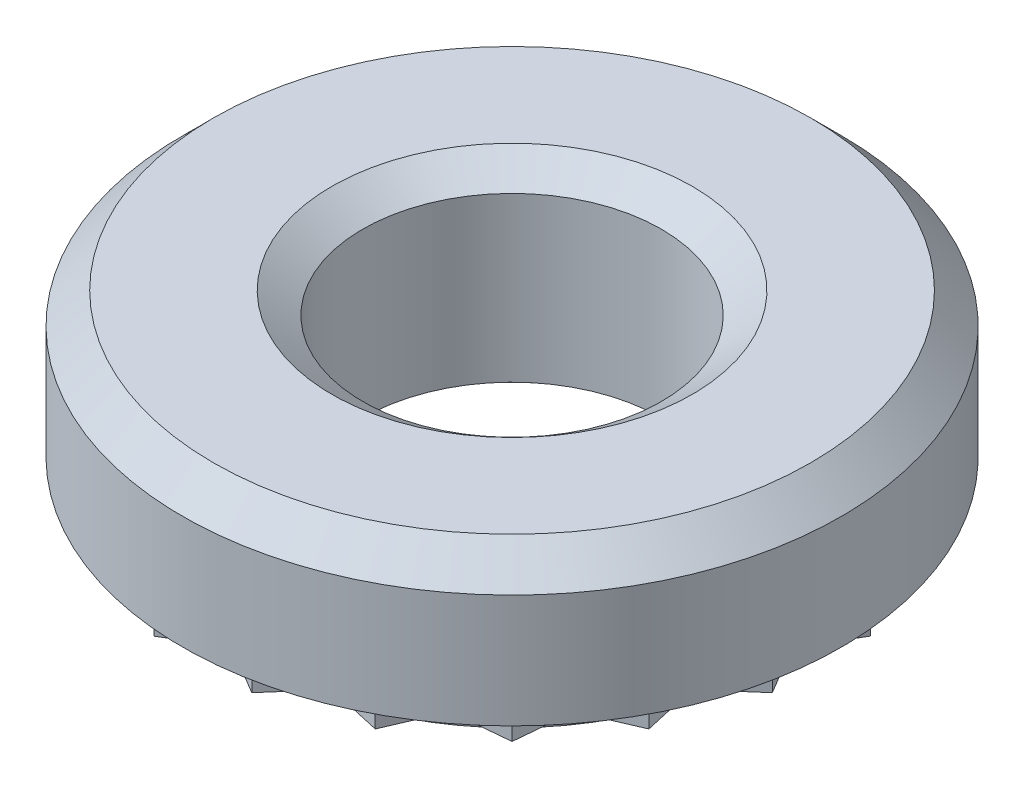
ISO-10303-21;
HEADER;
FILE_DESCRIPTION(('STEP AP214'),'2;1');
FILE_NAME('part.step','',(''),(''),'','','');
FILE_SCHEMA(('AUTOMOTIVE_DESIGN { 1 0 10303 214 1 1 1 1 }'));
ENDSEC;
DATA;
#1=APPLICATION_CONTEXT('core data for automotive mechanical design processes');
#2=APPLICATION_PROTOCOL_DEFINITION('international standard','automotive_design',2000,#1);
#3=PRODUCT_CONTEXT('',#1,'mechanical');
#4=PRODUCT('Part','Part','',(#3));
#5=PRODUCT_RELATED_PRODUCT_CATEGORY('part','',(#4));
#6=PRODUCT_DEFINITION_FORMATION('','',#4);
#7=PRODUCT_DEFINITION_CONTEXT('part definition',#1,'design');
#8=PRODUCT_DEFINITION('design','',#6,#7);
#9=PRODUCT_DEFINITION_SHAPE('','',#8);
#10=(LENGTH_UNIT() NAMED_UNIT(*) SI_UNIT(.MILLI.,.METRE.));
#11=(NAMED_UNIT(*) PLANE_ANGLE_UNIT() SI_UNIT($,.RADIAN.));
#12=(NAMED_UNIT(*) SI_UNIT($,.STERADIAN.) SOLID_ANGLE_UNIT());
#13=UNCERTAINTY_MEASURE_WITH_UNIT(LENGTH_MEASURE(1.E-05),#10,'distance_accuracy_value','');
#14=(GEOMETRIC_REPRESENTATION_CONTEXT(3) GLOBAL_UNCERTAINTY_ASSIGNED_CONTEXT((#13)) GLOBAL_UNIT_ASSIGNED_CONTEXT((#10,
#11,#12)) REPRESENTATION_CONTEXT('',''));
#15=CARTESIAN_POINT('',(0.,0.,0.));
#16=DIRECTION('',(0.,0.,1.));
#17=DIRECTION('',(1.,0.,0.));
#18=AXIS2_PLACEMENT_3D('',#15,#16,#17);
#19=CARTESIAN_POINT('',(2.21912653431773,0.,0.));
#20=DIRECTION('',(0.,-1.,0.));
#21=DIRECTION('',(0.,0.,-1.));
#22=AXIS2_PLACEMENT_3D('',#19,#20,#21);
#23=PLANE('',#22);
#24=CARTESIAN_POINT('',(0.,0.,0.));
#25=DIRECTION('',(0.,-1.,0.));
#26=DIRECTION('',(0.,0.,-1.));
#27=AXIS2_PLACEMENT_3D('',#24,#25,#26);
#28=CIRCLE('',#27,3.2);
#29=CARTESIAN_POINT('',(0.,0.,-3.2));
#30=VERTEX_POINT('',#29);
#31=EDGE_CURVE('E178',#30,#30,#28,.T.);
#32=ORIENTED_EDGE('',*,*,#31,.T.);
#33=EDGE_LOOP('',(#32));
#34=FACE_BOUND('',#33,.T.);
#35=DIRECTION('',(-0.859689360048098,0.,-0.5108171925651));
#36=VECTOR('',#35,1.);
#37=CARTESIAN_POINT('',(0.475560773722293,0.,3.00257255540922));
#38=LINE('',#37,#36);
#39=CARTESIAN_POINT('',(0.475560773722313,0.,3.00257255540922));
#40=VERTEX_POINT('',#39);
#41=CARTESIAN_POINT('',(0.,0.,2.72));
#42=VERTEX_POINT('',#41);
#43=EDGE_CURVE('E70',#40,#42,#38,.T.);
#44=ORIENTED_EDGE('',*,*,#43,.F.);
#45=DIRECTION('',(-0.659761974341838,0.,0.751474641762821));
#46=VECTOR('',#45,1.);
#47=CARTESIAN_POINT('',(0.840526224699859,0.,2.58687372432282));
#48=LINE('',#47,#46);
#49=CARTESIAN_POINT('',(0.840526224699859,0.,2.58687372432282));
#50=VERTEX_POINT('',#49);
#51=EDGE_CURVE('E611',#50,#40,#48,.T.);
#52=ORIENTED_EDGE('',*,*,#51,.F.);
#53=DIRECTION('',(-0.975464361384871,0.,-0.220157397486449));
#54=VECTOR('',#53,1.);
#55=CARTESIAN_POINT('',(1.38013111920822,0.,2.70865983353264));
#56=LINE('',#55,#54);
#57=CARTESIAN_POINT('',(1.38013111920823,0.,2.70865983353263));
#58=VERTEX_POINT('',#57);
#59=EDGE_CURVE('E613',#58,#50,#56,.T.);
#60=ORIENTED_EDGE('',*,*,#59,.F.);
#61=DIRECTION('',(-0.395252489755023,0.,0.918572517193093));
#62=VECTOR('',#61,1.);
#63=CARTESIAN_POINT('',(1.59877588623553,0.,2.20052622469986));
#64=LINE('',#63,#62);
#65=CARTESIAN_POINT('',(1.59877588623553,0.,2.20052622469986));
#66=VERTEX_POINT('',#65);
#67=EDGE_CURVE('E638',#66,#58,#64,.T.);
#68=ORIENTED_EDGE('',*,*,#67,.F.);
#69=DIRECTION('',(-0.995754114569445,0.,0.0920529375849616));
#70=VECTOR('',#69,1.);
#71=CARTESIAN_POINT('',(2.1496046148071,0.,2.14960461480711));
#72=LINE('',#71,#70);
#73=CARTESIAN_POINT('',(2.14960461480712,0.,2.14960461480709));
#74=VERTEX_POINT('',#73);
#75=EDGE_CURVE('E641',#74,#66,#72,.T.);
#76=ORIENTED_EDGE('',*,*,#75,.F.);
#77=DIRECTION('',(-0.092052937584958,0.,0.995754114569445));
#78=VECTOR('',#77,1.);
#79=CARTESIAN_POINT('',(2.20052622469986,0.,1.59877588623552));
#80=LINE('',#79,#78);
#81=CARTESIAN_POINT('',(2.20052622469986,0.,1.59877588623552));
#82=VERTEX_POINT('',#81);
#83=EDGE_CURVE('E672',#82,#74,#80,.T.);
#84=ORIENTED_EDGE('',*,*,#83,.F.);
#85=DIRECTION('',(-0.918572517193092,0.,0.395252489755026));
#86=VECTOR('',#85,1.);
#87=CARTESIAN_POINT('',(2.70865983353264,0.,1.38013111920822));
#88=LINE('',#87,#86);
#89=CARTESIAN_POINT('',(2.70865983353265,0.,1.38013111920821));
#90=VERTEX_POINT('',#89);
#91=EDGE_CURVE('E675',#90,#82,#88,.T.);
#92=ORIENTED_EDGE('',*,*,#91,.F.);
#93=DIRECTION('',(0.220157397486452,0.,0.97546436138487));
#94=VECTOR('',#93,1.);
#95=CARTESIAN_POINT('',(2.58687372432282,0.,0.84052622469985));
#96=LINE('',#95,#94);
#97=CARTESIAN_POINT('',(2.58687372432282,0.,0.84052622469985));
#98=VERTEX_POINT('',#97);
#99=EDGE_CURVE('E708',#98,#90,#96,.T.);
#100=ORIENTED_EDGE('',*,*,#99,.F.);
#101=DIRECTION('',(-0.751474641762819,0.,0.659761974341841));
#102=VECTOR('',#101,1.);
#103=CARTESIAN_POINT('',(3.00257255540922,0.,0.475560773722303));
#104=LINE('',#103,#102);
#105=CARTESIAN_POINT('',(3.00257255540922,0.,0.475560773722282));
#106=VERTEX_POINT('',#105);
#107=EDGE_CURVE('E711',#106,#98,#104,.T.);
#108=ORIENTED_EDGE('',*,*,#107,.F.);
#109=DIRECTION('',(0.510817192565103,0.,0.859689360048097));
#110=VECTOR('',#109,1.);
#111=CARTESIAN_POINT('',(2.72,0.,0.));
#112=LINE('',#111,#110);
#113=CARTESIAN_POINT('',(2.72,0.,0.));
#114=VERTEX_POINT('',#113);
#115=EDGE_CURVE('E744',#114,#106,#112,.T.);
#116=ORIENTED_EDGE('',*,*,#115,.F.);
#117=DIRECTION('',(-0.510817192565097,0.,0.8596893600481));
#118=VECTOR('',#117,1.);
#119=CARTESIAN_POINT('',(3.00257255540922,0.,-0.475560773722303));
#120=LINE('',#119,#118);
#121=CARTESIAN_POINT('',(3.00257255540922,0.,-0.475560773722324));
#122=VERTEX_POINT('',#121);
#123=EDGE_CURVE('E747',#122,#114,#120,.T.);
#124=ORIENTED_EDGE('',*,*,#123,.F.);
#125=DIRECTION('',(0.751474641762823,0.,0.659761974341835));
#126=VECTOR('',#125,1.);
#127=CARTESIAN_POINT('',(2.58687372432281,0.,-0.840526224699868));
#128=LINE('',#127,#126);
#129=CARTESIAN_POINT('',(2.58687372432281,0.,-0.840526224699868));
#130=VERTEX_POINT('',#129);
#131=EDGE_CURVE('E780',#130,#122,#128,.T.);
#132=ORIENTED_EDGE('',*,*,#131,.F.);
#133=DIRECTION('',(-0.220157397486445,0.,0.975464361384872));
#134=VECTOR('',#133,1.);
#135=CARTESIAN_POINT('',(2.70865983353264,0.,-1.38013111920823));
#136=LINE('',#135,#134);
#137=CARTESIAN_POINT('',(2.70865983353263,0.,-1.38013111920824));
#138=VERTEX_POINT('',#137);
#139=EDGE_CURVE('E783',#138,#130,#136,.T.);
#140=ORIENTED_EDGE('',*,*,#139,.F.);
#141=DIRECTION('',(0.918572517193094,0.,0.39525248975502));
#142=VECTOR('',#141,1.);
#143=CARTESIAN_POINT('',(2.20052622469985,0.,-1.59877588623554));
#144=LINE('',#143,#142);
#145=CARTESIAN_POINT('',(2.20052622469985,0.,-1.59877588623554));
#146=VERTEX_POINT('',#145);
#147=EDGE_CURVE('E816',#146,#138,#144,.T.);
#148=ORIENTED_EDGE('',*,*,#147,.F.);
#149=DIRECTION('',(0.092052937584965,0.,0.995754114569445));
#150=VECTOR('',#149,1.);
#151=CARTESIAN_POINT('',(2.1496046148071,0.,-2.14960461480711));
#152=LINE('',#151,#150);
#153=CARTESIAN_POINT('',(2.14960461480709,0.,-2.14960461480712));
#154=VERTEX_POINT('',#153);
#155=EDGE_CURVE('E819',#154,#146,#152,.T.);
#156=ORIENTED_EDGE('',*,*,#155,.F.);
#157=DIRECTION('',(0.995754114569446,0.,0.0920529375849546));
#158=VECTOR('',#157,1.);
#159=CARTESIAN_POINT('',(1.59877588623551,0.,-2.20052622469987));
#160=LINE('',#159,#158);
#161=CARTESIAN_POINT('',(1.59877588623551,0.,-2.20052622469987));
#162=VERTEX_POINT('',#161);
#163=EDGE_CURVE('E852',#162,#154,#160,.T.);
#164=ORIENTED_EDGE('',*,*,#163,.F.);
#165=DIRECTION('',(0.39525248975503,0.,0.91857251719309));
#166=VECTOR('',#165,1.);
#167=CARTESIAN_POINT('',(1.38013111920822,0.,-2.70865983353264));
#168=LINE('',#167,#166);
#169=CARTESIAN_POINT('',(1.3801311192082,0.,-2.70865983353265));
#170=VERTEX_POINT('',#169);
#171=EDGE_CURVE('E855',#170,#162,#168,.T.);
#172=ORIENTED_EDGE('',*,*,#171,.F.);
#173=DIRECTION('',(0.975464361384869,0.,-0.220157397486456));
#174=VECTOR('',#173,1.);
#175=CARTESIAN_POINT('',(0.84052622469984,0.,-2.58687372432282));
#176=LINE('',#175,#174);
#177=CARTESIAN_POINT('',(0.84052622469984,0.,-2.58687372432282));
#178=VERTEX_POINT('',#177);
#179=EDGE_CURVE('E888',#178,#170,#176,.T.);
#180=ORIENTED_EDGE('',*,*,#179,.F.);
#181=DIRECTION('',(0.659761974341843,0.,0.751474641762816));
#182=VECTOR('',#181,1.);
#183=CARTESIAN_POINT('',(0.475560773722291,0.,-3.00257255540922));
#184=LINE('',#183,#182);
#185=CARTESIAN_POINT('',(0.475560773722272,0.,-3.00257255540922));
#186=VERTEX_POINT('',#185);
#187=EDGE_CURVE('E891',#186,#178,#184,.T.);
#188=ORIENTED_EDGE('',*,*,#187,.F.);
#189=DIRECTION('',(0.859689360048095,0.,-0.510817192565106));
#190=VECTOR('',#189,1.);
#191=CARTESIAN_POINT('',(0.,0.,-2.72));
#192=LINE('',#191,#190);
#193=CARTESIAN_POINT('',(0.,0.,-2.72));
#194=VERTEX_POINT('',#193);
#195=EDGE_CURVE('E924',#194,#186,#192,.T.);
#196=ORIENTED_EDGE('',*,*,#195,.F.);
#197=DIRECTION('',(0.859689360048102,0.,0.510817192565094));
#198=VECTOR('',#197,1.);
#199=CARTESIAN_POINT('',(-0.475560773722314,0.,-3.00257255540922));
#200=LINE('',#199,#198);
#201=CARTESIAN_POINT('',(-0.475560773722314,0.,-3.00257255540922));
#202=VERTEX_POINT('',#201);
#203=EDGE_CURVE('E927',#202,#194,#200,.T.);
#204=ORIENTED_EDGE('',*,*,#203,.F.);
#205=DIRECTION('',(0.659761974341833,0.,-0.751474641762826));
#206=VECTOR('',#205,1.);
#207=CARTESIAN_POINT('',(-0.840526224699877,0.,-2.58687372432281));
#208=LINE('',#207,#206);
#209=CARTESIAN_POINT('',(-0.840526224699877,0.,-2.58687372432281));
#210=VERTEX_POINT('',#209);
#211=EDGE_CURVE('E960',#210,#202,#208,.T.);
#212=ORIENTED_EDGE('',*,*,#211,.F.);
#213=DIRECTION('',(0.975464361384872,0.,0.220157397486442));
#214=VECTOR('',#213,1.);
#215=CARTESIAN_POINT('',(-1.38013111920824,0.,-2.70865983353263));
#216=LINE('',#215,#214);
#217=CARTESIAN_POINT('',(-1.38013111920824,0.,-2.70865983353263));
#218=VERTEX_POINT('',#217);
#219=EDGE_CURVE('E963',#218,#210,#216,.T.);
#220=ORIENTED_EDGE('',*,*,#219,.F.);
#221=DIRECTION('',(0.395252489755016,0.,-0.918572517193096));
#222=VECTOR('',#221,1.);
#223=CARTESIAN_POINT('',(-1.59877588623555,0.,-2.20052622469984));
#224=LINE('',#223,#222);
#225=CARTESIAN_POINT('',(-1.59877588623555,0.,-2.20052622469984));
#226=VERTEX_POINT('',#225);
#227=EDGE_CURVE('E996',#226,#218,#224,.T.);
#228=ORIENTED_EDGE('',*,*,#227,.F.);
#229=DIRECTION('',(0.995754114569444,0.,-0.0920529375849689));
#230=VECTOR('',#229,1.);
#231=CARTESIAN_POINT('',(-2.14960461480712,0.,-2.14960461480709));
#232=LINE('',#231,#230);
#233=CARTESIAN_POINT('',(-2.14960461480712,0.,-2.14960461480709));
#234=VERTEX_POINT('',#233);
#235=EDGE_CURVE('E999',#234,#226,#232,.T.);
#236=ORIENTED_EDGE('',*,*,#235,.F.);
#237=DIRECTION('',(0.0920529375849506,0.,-0.995754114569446));
#238=VECTOR('',#237,1.);
#239=CARTESIAN_POINT('',(-2.20052622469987,0.,-1.59877588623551));
#240=LINE('',#239,#238);
#241=CARTESIAN_POINT('',(-2.20052622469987,0.,-1.59877588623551));
#242=VERTEX_POINT('',#241);
#243=EDGE_CURVE('E1032',#242,#234,#240,.T.);
#244=ORIENTED_EDGE('',*,*,#243,.F.);
#245=DIRECTION('',(0.918572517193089,0.,-0.395252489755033));
#246=VECTOR('',#245,1.);
#247=CARTESIAN_POINT('',(-2.70865983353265,0.,-1.3801311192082));
#248=LINE('',#247,#246);
#249=CARTESIAN_POINT('',(-2.70865983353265,0.,-1.3801311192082));
#250=VERTEX_POINT('',#249);
#251=EDGE_CURVE('E1035',#250,#242,#248,.T.);
#252=ORIENTED_EDGE('',*,*,#251,.F.);
#253=DIRECTION('',(-0.220157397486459,0.,-0.975464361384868));
#254=VECTOR('',#253,1.);
#255=CARTESIAN_POINT('',(-2.58687372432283,0.,-0.840526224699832));
#256=LINE('',#255,#254);
#257=CARTESIAN_POINT('',(-2.58687372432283,0.,-0.840526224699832));
#258=VERTEX_POINT('',#257);
#259=EDGE_CURVE('E1068',#258,#250,#256,.T.);
#260=ORIENTED_EDGE('',*,*,#259,.F.);
#261=DIRECTION('',(0.751474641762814,0.,-0.659761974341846));
#262=VECTOR('',#261,1.);
#263=CARTESIAN_POINT('',(-3.00257255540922,0.,-0.475560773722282));
#264=LINE('',#263,#262);
#265=CARTESIAN_POINT('',(-3.00257255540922,0.,-0.475560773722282));
#266=VERTEX_POINT('',#265);
#267=EDGE_CURVE('E1071',#266,#258,#264,.T.);
#268=ORIENTED_EDGE('',*,*,#267,.F.);
#269=DIRECTION('',(-0.510817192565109,0.,-0.859689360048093));
#270=VECTOR('',#269,1.);
#271=CARTESIAN_POINT('',(-2.72,0.,0.));
#272=LINE('',#271,#270);
#273=CARTESIAN_POINT('',(-2.72,0.,0.));
#274=VERTEX_POINT('',#273);
#275=EDGE_CURVE('E1104',#274,#266,#272,.T.);
#276=ORIENTED_EDGE('',*,*,#275,.F.);
#277=DIRECTION('',(0.510817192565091,0.,-0.859689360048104));
#278=VECTOR('',#277,1.);
#279=CARTESIAN_POINT('',(-3.00257255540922,0.,0.475560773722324));
#280=LINE('',#279,#278);
#281=CARTESIAN_POINT('',(-3.00257255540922,0.,0.475560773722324));
#282=VERTEX_POINT('',#281);
#283=EDGE_CURVE('E1107',#282,#274,#280,.T.);
#284=ORIENTED_EDGE('',*,*,#283,.F.);
#285=DIRECTION('',(-0.751474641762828,0.,-0.65976197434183));
#286=VECTOR('',#285,1.);
#287=CARTESIAN_POINT('',(-2.58687372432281,0.,0.840526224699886));
#288=LINE('',#287,#286);
#289=CARTESIAN_POINT('',(-2.58687372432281,0.,0.840526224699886));
#290=VERTEX_POINT('',#289);
#291=EDGE_CURVE('E1140',#290,#282,#288,.T.);
#292=ORIENTED_EDGE('',*,*,#291,.F.);
#293=DIRECTION('',(0.220157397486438,0.,-0.975464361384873));
#294=VECTOR('',#293,1.);
#295=CARTESIAN_POINT('',(-2.70865983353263,0.,1.38013111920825));
#296=LINE('',#295,#294);
#297=CARTESIAN_POINT('',(-2.70865983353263,0.,1.38013111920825));
#298=VERTEX_POINT('',#297);
#299=EDGE_CURVE('E1143',#298,#290,#296,.T.);
#300=ORIENTED_EDGE('',*,*,#299,.F.);
#301=DIRECTION('',(-0.918572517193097,0.,-0.395252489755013));
#302=VECTOR('',#301,1.);
#303=CARTESIAN_POINT('',(-2.20052622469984,0.,1.59877588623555));
#304=LINE('',#303,#302);
#305=CARTESIAN_POINT('',(-2.20052622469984,0.,1.59877588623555));
#306=VERTEX_POINT('',#305);
#307=EDGE_CURVE('E1176',#306,#298,#304,.T.);
#308=ORIENTED_EDGE('',*,*,#307,.F.);
#309=DIRECTION('',(-0.0920529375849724,0.,-0.995754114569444));
#310=VECTOR('',#309,1.);
#311=CARTESIAN_POINT('',(-2.14960461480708,0.,2.14960461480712));
#312=LINE('',#311,#310);
#313=CARTESIAN_POINT('',(-2.14960461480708,0.,2.14960461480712));
#314=VERTEX_POINT('',#313);
#315=EDGE_CURVE('E1179',#314,#306,#312,.T.);
#316=ORIENTED_EDGE('',*,*,#315,.F.);
#317=DIRECTION('',(-0.995754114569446,0.,-0.0920529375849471));
#318=VECTOR('',#317,1.);
#319=CARTESIAN_POINT('',(-1.5987758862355,0.,2.20052622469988));
#320=LINE('',#319,#318);
#321=CARTESIAN_POINT('',(-1.5987758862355,0.,2.20052622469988));
#322=VERTEX_POINT('',#321);
#323=EDGE_CURVE('E1212',#322,#314,#320,.T.);
#324=ORIENTED_EDGE('',*,*,#323,.F.);
#325=DIRECTION('',(-0.395252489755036,0.,-0.918572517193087));
#326=VECTOR('',#325,1.);
#327=CARTESIAN_POINT('',(-1.38013111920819,0.,2.70865983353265));
#328=LINE('',#327,#326);
#329=CARTESIAN_POINT('',(-1.38013111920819,0.,2.70865983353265));
#330=VERTEX_POINT('',#329);
#331=EDGE_CURVE('E1215',#330,#322,#328,.T.);
#332=ORIENTED_EDGE('',*,*,#331,.F.);
#333=DIRECTION('',(-0.975464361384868,0.,0.220157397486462));
#334=VECTOR('',#333,1.);
#335=CARTESIAN_POINT('',(-0.840526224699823,0.,2.58687372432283));
#336=LINE('',#335,#334);
#337=CARTESIAN_POINT('',(-0.840526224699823,0.,2.58687372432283));
#338=VERTEX_POINT('',#337);
#339=EDGE_CURVE('E1235',#338,#330,#336,.T.);
#340=ORIENTED_EDGE('',*,*,#339,.F.);
#341=DIRECTION('',(-0.659761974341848,0.,-0.751474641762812));
#342=VECTOR('',#341,1.);
#343=CARTESIAN_POINT('',(-0.475560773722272,0.,3.00257255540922));
#344=LINE('',#343,#342);
#345=CARTESIAN_POINT('',(-0.475560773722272,0.,3.00257255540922));
#346=VERTEX_POINT('',#345);
#347=EDGE_CURVE('E1238',#346,#338,#344,.T.);
#348=ORIENTED_EDGE('',*,*,#347,.F.);
#349=DIRECTION('',(-0.859689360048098,0.,0.5108171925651));
#350=VECTOR('',#349,1.);
#351=CARTESIAN_POINT('',(0.,0.,2.72));
#352=LINE('',#351,#350);
#353=EDGE_CURVE('E589',#42,#346,#352,.T.);
#354=ORIENTED_EDGE('',*,*,#353,.F.);
#355=EDGE_LOOP('',(#44,#52,#60,#68,#76,#84,#92,#100,#108,#116,#124,#132,#140,#148,#156,#164,
#172,#180,#188,#196,#204,#212,#220,#228,#236,#244,#252,#260,#268,#276,#284,#292,#300,#308,#316,
#324,#332,#340,#348,#354));
#356=FACE_BOUND('',#355,.T.);
#357=ADVANCED_FACE('F33',(#34,#356),#23,.T.);
#358=CARTESIAN_POINT('',(0.,0.,0.));
#359=DIRECTION('',(0.,-1.,0.));
#360=DIRECTION('',(0.,0.,-1.));
#361=AXIS2_PLACEMENT_3D('',#358,#359,#360);
#362=CIRCLE('',#361,2.21912653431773);
#363=CARTESIAN_POINT('',(0.,0.,-2.21912653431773));
#364=VERTEX_POINT('',#363);
#365=EDGE_CURVE('E175',#364,#364,#362,.T.);
#366=ORIENTED_EDGE('',*,*,#365,.F.);
#367=EDGE_LOOP('',(#366));
#368=FACE_BOUND('',#367,.T.);
#369=DIRECTION('',(0.975464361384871,0.,0.220157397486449));
#370=VECTOR('',#369,1.);
#371=CARTESIAN_POINT('',(0.806905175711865,0.,2.4833987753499));
#372=LINE('',#371,#370);
#373=CARTESIAN_POINT('',(0.806905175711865,0.,2.4833987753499));
#374=VERTEX_POINT('',#373);
#375=CARTESIAN_POINT('',(1.32492587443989,0.,2.60031344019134));
#376=VERTEX_POINT('',#375);
#377=EDGE_CURVE('E104',#374,#376,#372,.T.);
#378=ORIENTED_EDGE('',*,*,#377,.F.);
#379=DIRECTION('',(0.659761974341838,0.,-0.751474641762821));
#380=VECTOR('',#379,1.);
#381=CARTESIAN_POINT('',(0.456538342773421,0.,2.88246965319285));
#382=LINE('',#381,#380);
#383=CARTESIAN_POINT('',(0.456538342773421,0.,2.88246965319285));
#384=VERTEX_POINT('',#383);
#385=EDGE_CURVE('E609',#384,#374,#382,.T.);
#386=ORIENTED_EDGE('',*,*,#385,.F.);
#387=DIRECTION('',(0.859689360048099,0.,0.5108171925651));
#388=VECTOR('',#387,1.);
#389=CARTESIAN_POINT('',(0.,0.,2.6112));
#390=LINE('',#389,#388);
#391=CARTESIAN_POINT('',(0.,0.,2.6112));
#392=VERTEX_POINT('',#391);
#393=EDGE_CURVE('E138',#392,#384,#390,.T.);
#394=ORIENTED_EDGE('',*,*,#393,.F.);
#395=DIRECTION('',(0.859689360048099,0.,-0.5108171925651));
#396=VECTOR('',#395,1.);
#397=CARTESIAN_POINT('',(-0.456538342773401,0.,2.88246965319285));
#398=LINE('',#397,#396);
#399=CARTESIAN_POINT('',(-0.456538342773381,0.,2.88246965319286));
#400=VERTEX_POINT('',#399);
#401=EDGE_CURVE('E588',#400,#392,#398,.T.);
#402=ORIENTED_EDGE('',*,*,#401,.F.);
#403=DIRECTION('',(0.659761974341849,0.,0.751474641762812));
#404=VECTOR('',#403,1.);
#405=CARTESIAN_POINT('',(-0.80690517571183,0.,2.48339877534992));
#406=LINE('',#405,#404);
#407=CARTESIAN_POINT('',(-0.80690517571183,0.,2.48339877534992));
#408=VERTEX_POINT('',#407);
#409=EDGE_CURVE('E575',#408,#400,#406,.T.);
#410=ORIENTED_EDGE('',*,*,#409,.F.);
#411=DIRECTION('',(0.975464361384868,0.,-0.220157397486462));
#412=VECTOR('',#411,1.);
#413=CARTESIAN_POINT('',(-1.32492587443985,0.,2.60031344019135));
#414=LINE('',#413,#412);
#415=CARTESIAN_POINT('',(-1.32492587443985,0.,2.60031344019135));
#416=VERTEX_POINT('',#415);
#417=EDGE_CURVE('E586',#416,#408,#414,.T.);
#418=ORIENTED_EDGE('',*,*,#417,.F.);
#419=DIRECTION('',(0.395252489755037,0.,0.918572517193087));
#420=VECTOR('',#419,1.);
#421=CARTESIAN_POINT('',(-1.53482485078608,0.,2.11250517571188));
#422=LINE('',#421,#420);
#423=CARTESIAN_POINT('',(-1.53482485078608,0.,2.11250517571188));
#424=VERTEX_POINT('',#423);
#425=EDGE_CURVE('E1205',#424,#416,#422,.T.);
#426=ORIENTED_EDGE('',*,*,#425,.F.);
#427=DIRECTION('',(0.995754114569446,0.,0.0920529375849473));
#428=VECTOR('',#427,1.);
#429=CARTESIAN_POINT('',(-2.06362043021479,0.,2.06362043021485));
#430=LINE('',#429,#428);
#431=CARTESIAN_POINT('',(-2.06362043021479,0.,2.06362043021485));
#432=VERTEX_POINT('',#431);
#433=EDGE_CURVE('E1209',#432,#424,#430,.T.);
#434=ORIENTED_EDGE('',*,*,#433,.F.);
#435=DIRECTION('',(0.0920529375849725,0.,0.995754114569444));
#436=VECTOR('',#435,1.);
#437=CARTESIAN_POINT('',(-2.11250517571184,0.,1.53482485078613));
#438=LINE('',#437,#436);
#439=CARTESIAN_POINT('',(-2.11250517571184,0.,1.53482485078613));
#440=VERTEX_POINT('',#439);
#441=EDGE_CURVE('E1169',#440,#432,#438,.T.);
#442=ORIENTED_EDGE('',*,*,#441,.F.);
#443=DIRECTION('',(0.918572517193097,0.,0.395252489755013));
#444=VECTOR('',#443,1.);
#445=CARTESIAN_POINT('',(-2.60031344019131,0.,1.32492587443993));
#446=LINE('',#445,#444);
#447=CARTESIAN_POINT('',(-2.60031344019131,0.,1.32492587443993));
#448=VERTEX_POINT('',#447);
#449=EDGE_CURVE('E1173',#448,#440,#446,.T.);
#450=ORIENTED_EDGE('',*,*,#449,.F.);
#451=DIRECTION('',(-0.220157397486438,0.,0.975464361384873));
#452=VECTOR('',#451,1.);
#453=CARTESIAN_POINT('',(-2.4833987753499,0.,0.806905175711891));
#454=LINE('',#453,#452);
#455=CARTESIAN_POINT('',(-2.4833987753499,0.,0.806905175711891));
#456=VERTEX_POINT('',#455);
#457=EDGE_CURVE('E1133',#456,#448,#454,.T.);
#458=ORIENTED_EDGE('',*,*,#457,.F.);
#459=DIRECTION('',(0.751474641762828,0.,0.65976197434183));
#460=VECTOR('',#459,1.);
#461=CARTESIAN_POINT('',(-2.88246965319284,0.,0.456538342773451));
#462=LINE('',#461,#460);
#463=CARTESIAN_POINT('',(-2.88246965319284,0.,0.456538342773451));
#464=VERTEX_POINT('',#463);
#465=EDGE_CURVE('E1137',#464,#456,#462,.T.);
#466=ORIENTED_EDGE('',*,*,#465,.F.);
#467=DIRECTION('',(-0.510817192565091,0.,0.859689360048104));
#468=VECTOR('',#467,1.);
#469=CARTESIAN_POINT('',(-2.6112,0.,0.));
#470=LINE('',#469,#468);
#471=CARTESIAN_POINT('',(-2.6112,0.,0.));
#472=VERTEX_POINT('',#471);
#473=EDGE_CURVE('E1097',#472,#464,#470,.T.);
#474=ORIENTED_EDGE('',*,*,#473,.F.);
#475=DIRECTION('',(0.510817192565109,0.,0.859689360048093));
#476=VECTOR('',#475,1.);
#477=CARTESIAN_POINT('',(-2.88246965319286,0.,-0.456538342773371));
#478=LINE('',#477,#476);
#479=CARTESIAN_POINT('',(-2.88246965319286,0.,-0.456538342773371));
#480=VERTEX_POINT('',#479);
#481=EDGE_CURVE('E1101',#480,#472,#478,.T.);
#482=ORIENTED_EDGE('',*,*,#481,.F.);
#483=DIRECTION('',(-0.751474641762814,0.,0.659761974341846));
#484=VECTOR('',#483,1.);
#485=CARTESIAN_POINT('',(-2.48339877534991,0.,-0.806905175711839));
#486=LINE('',#485,#484);
#487=CARTESIAN_POINT('',(-2.48339877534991,0.,-0.806905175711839));
#488=VERTEX_POINT('',#487);
#489=EDGE_CURVE('E1061',#488,#480,#486,.T.);
#490=ORIENTED_EDGE('',*,*,#489,.F.);
#491=DIRECTION('',(0.220157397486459,0.,0.975464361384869));
#492=VECTOR('',#491,1.);
#493=CARTESIAN_POINT('',(-2.60031344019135,0.,-1.32492587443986));
#494=LINE('',#493,#492);
#495=CARTESIAN_POINT('',(-2.60031344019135,0.,-1.32492587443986));
#496=VERTEX_POINT('',#495);
#497=EDGE_CURVE('E1065',#496,#488,#494,.T.);
#498=ORIENTED_EDGE('',*,*,#497,.F.);
#499=DIRECTION('',(-0.918572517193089,0.,0.395252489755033));
#500=VECTOR('',#499,1.);
#501=CARTESIAN_POINT('',(-2.11250517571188,0.,-1.53482485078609));
#502=LINE('',#501,#500);
#503=CARTESIAN_POINT('',(-2.11250517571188,0.,-1.53482485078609));
#504=VERTEX_POINT('',#503);
#505=EDGE_CURVE('E1025',#504,#496,#502,.T.);
#506=ORIENTED_EDGE('',*,*,#505,.F.);
#507=DIRECTION('',(-0.0920529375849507,0.,0.995754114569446));
#508=VECTOR('',#507,1.);
#509=CARTESIAN_POINT('',(-2.06362043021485,0.,-2.06362043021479));
#510=LINE('',#509,#508);
#511=CARTESIAN_POINT('',(-2.06362043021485,0.,-2.06362043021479));
#512=VERTEX_POINT('',#511);
#513=EDGE_CURVE('E1029',#512,#504,#510,.T.);
#514=ORIENTED_EDGE('',*,*,#513,.F.);
#515=DIRECTION('',(-0.995754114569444,0.,0.092052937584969));
#516=VECTOR('',#515,1.);
#517=CARTESIAN_POINT('',(-1.53482485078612,0.,-2.11250517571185));
#518=LINE('',#517,#516);
#519=CARTESIAN_POINT('',(-1.53482485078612,0.,-2.11250517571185));
#520=VERTEX_POINT('',#519);
#521=EDGE_CURVE('E989',#520,#512,#518,.T.);
#522=ORIENTED_EDGE('',*,*,#521,.F.);
#523=DIRECTION('',(-0.395252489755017,0.,0.918572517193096));
#524=VECTOR('',#523,1.);
#525=CARTESIAN_POINT('',(-1.32492587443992,0.,-2.60031344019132));
#526=LINE('',#525,#524);
#527=CARTESIAN_POINT('',(-1.32492587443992,0.,-2.60031344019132));
#528=VERTEX_POINT('',#527);
#529=EDGE_CURVE('E993',#528,#520,#526,.T.);
#530=ORIENTED_EDGE('',*,*,#529,.F.);
#531=DIRECTION('',(-0.975464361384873,0.,-0.220157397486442));
#532=VECTOR('',#531,1.);
#533=CARTESIAN_POINT('',(-0.806905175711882,0.,-2.4833987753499));
#534=LINE('',#533,#532);
#535=CARTESIAN_POINT('',(-0.806905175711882,0.,-2.4833987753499));
#536=VERTEX_POINT('',#535);
#537=EDGE_CURVE('E953',#536,#528,#534,.T.);
#538=ORIENTED_EDGE('',*,*,#537,.F.);
#539=DIRECTION('',(-0.659761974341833,0.,0.751474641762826));
#540=VECTOR('',#539,1.);
#541=CARTESIAN_POINT('',(-0.456538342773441,0.,-2.88246965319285));
#542=LINE('',#541,#540);
#543=CARTESIAN_POINT('',(-0.456538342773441,0.,-2.88246965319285));
#544=VERTEX_POINT('',#543);
#545=EDGE_CURVE('E957',#544,#536,#542,.T.);
#546=ORIENTED_EDGE('',*,*,#545,.F.);
#547=DIRECTION('',(-0.859689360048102,0.,-0.510817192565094));
#548=VECTOR('',#547,1.);
#549=CARTESIAN_POINT('',(0.,0.,-2.6112));
#550=LINE('',#549,#548);
#551=CARTESIAN_POINT('',(0.,0.,-2.6112));
#552=VERTEX_POINT('',#551);
#553=EDGE_CURVE('E917',#552,#544,#550,.T.);
#554=ORIENTED_EDGE('',*,*,#553,.F.);
#555=DIRECTION('',(-0.859689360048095,0.,0.510817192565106));
#556=VECTOR('',#555,1.);
#557=CARTESIAN_POINT('',(0.456538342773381,0.,-2.88246965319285));
#558=LINE('',#557,#556);
#559=CARTESIAN_POINT('',(0.456538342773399,0.,-2.88246965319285));
#560=VERTEX_POINT('',#559);
#561=EDGE_CURVE('E921',#560,#552,#558,.T.);
#562=ORIENTED_EDGE('',*,*,#561,.F.);
#563=DIRECTION('',(-0.659761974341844,0.,-0.751474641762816));
#564=VECTOR('',#563,1.);
#565=CARTESIAN_POINT('',(0.806905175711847,0.,-2.48339877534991));
#566=LINE('',#565,#564);
#567=CARTESIAN_POINT('',(0.806905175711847,0.,-2.48339877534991));
#568=VERTEX_POINT('',#567);
#569=EDGE_CURVE('E881',#568,#560,#566,.T.);
#570=ORIENTED_EDGE('',*,*,#569,.F.);
#571=DIRECTION('',(-0.975464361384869,0.,0.220157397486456));
#572=VECTOR('',#571,1.);
#573=CARTESIAN_POINT('',(1.32492587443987,0.,-2.60031344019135));
#574=LINE('',#573,#572);
#575=CARTESIAN_POINT('',(1.32492587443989,0.,-2.60031344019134));
#576=VERTEX_POINT('',#575);
#577=EDGE_CURVE('E885',#576,#568,#574,.T.);
#578=ORIENTED_EDGE('',*,*,#577,.F.);
#579=DIRECTION('',(-0.39525248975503,0.,-0.91857251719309));
#580=VECTOR('',#579,1.);
#581=CARTESIAN_POINT('',(1.53482485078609,0.,-2.11250517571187));
#582=LINE('',#581,#580);
#583=CARTESIAN_POINT('',(1.53482485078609,0.,-2.11250517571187));
#584=VERTEX_POINT('',#583);
#585=EDGE_CURVE('E845',#584,#576,#582,.T.);
#586=ORIENTED_EDGE('',*,*,#585,.F.);
#587=DIRECTION('',(-0.995754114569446,0.,-0.0920529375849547));
#588=VECTOR('',#587,1.);
#589=CARTESIAN_POINT('',(2.0636204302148,0.,-2.06362043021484));
#590=LINE('',#589,#588);
#591=CARTESIAN_POINT('',(2.06362043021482,0.,-2.06362043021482));
#592=VERTEX_POINT('',#591);
#593=EDGE_CURVE('E849',#592,#584,#590,.T.);
#594=ORIENTED_EDGE('',*,*,#593,.F.);
#595=DIRECTION('',(-0.0920529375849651,0.,-0.995754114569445));
#596=VECTOR('',#595,1.);
#597=CARTESIAN_POINT('',(2.11250517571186,0.,-1.53482485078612));
#598=LINE('',#597,#596);
#599=CARTESIAN_POINT('',(2.11250517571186,0.,-1.53482485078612));
#600=VERTEX_POINT('',#599);
#601=EDGE_CURVE('E809',#600,#592,#598,.T.);
#602=ORIENTED_EDGE('',*,*,#601,.F.);
#603=DIRECTION('',(-0.918572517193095,0.,-0.39525248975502));
#604=VECTOR('',#603,1.);
#605=CARTESIAN_POINT('',(2.60031344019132,0.,-1.32492587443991));
#606=LINE('',#605,#604);
#607=CARTESIAN_POINT('',(2.60031344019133,0.,-1.3249258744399));
#608=VERTEX_POINT('',#607);
#609=EDGE_CURVE('E813',#608,#600,#606,.T.);
#610=ORIENTED_EDGE('',*,*,#609,.F.);
#611=DIRECTION('',(0.220157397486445,0.,-0.975464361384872));
#612=VECTOR('',#611,1.);
#613=CARTESIAN_POINT('',(2.4833987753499,0.,-0.806905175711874));
#614=LINE('',#613,#612);
#615=CARTESIAN_POINT('',(2.4833987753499,0.,-0.806905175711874));
#616=VERTEX_POINT('',#615);
#617=EDGE_CURVE('E773',#616,#608,#614,.T.);
#618=ORIENTED_EDGE('',*,*,#617,.F.);
#619=DIRECTION('',(-0.751474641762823,0.,-0.659761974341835));
#620=VECTOR('',#619,1.);
#621=CARTESIAN_POINT('',(2.88246965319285,0.,-0.456538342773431));
#622=LINE('',#621,#620);
#623=CARTESIAN_POINT('',(2.88246965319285,0.,-0.456538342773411));
#624=VERTEX_POINT('',#623);
#625=EDGE_CURVE('E777',#624,#616,#622,.T.);
#626=ORIENTED_EDGE('',*,*,#625,.F.);
#627=DIRECTION('',(0.510817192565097,0.,-0.8596893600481));
#628=VECTOR('',#627,1.);
#629=CARTESIAN_POINT('',(2.6112,0.,0.));
#630=LINE('',#629,#628);
#631=CARTESIAN_POINT('',(2.6112,0.,0.));
#632=VERTEX_POINT('',#631);
#633=EDGE_CURVE('E737',#632,#624,#630,.T.);
#634=ORIENTED_EDGE('',*,*,#633,.F.);
#635=DIRECTION('',(-0.510817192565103,0.,-0.859689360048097));
#636=VECTOR('',#635,1.);
#637=CARTESIAN_POINT('',(2.88246965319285,0.,0.456538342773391));
#638=LINE('',#637,#636);
#639=CARTESIAN_POINT('',(2.88246965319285,0.,0.45653834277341));
#640=VERTEX_POINT('',#639);
#641=EDGE_CURVE('E741',#640,#632,#638,.T.);
#642=ORIENTED_EDGE('',*,*,#641,.F.);
#643=DIRECTION('',(0.751474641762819,0.,-0.659761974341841));
#644=VECTOR('',#643,1.);
#645=CARTESIAN_POINT('',(2.48339877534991,0.,0.806905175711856));
#646=LINE('',#645,#644);
#647=CARTESIAN_POINT('',(2.48339877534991,0.,0.806905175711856));
#648=VERTEX_POINT('',#647);
#649=EDGE_CURVE('E701',#648,#640,#646,.T.);
#650=ORIENTED_EDGE('',*,*,#649,.F.);
#651=DIRECTION('',(-0.220157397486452,0.,-0.97546436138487));
#652=VECTOR('',#651,1.);
#653=CARTESIAN_POINT('',(2.60031344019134,0.,1.32492587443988));
#654=LINE('',#653,#652);
#655=CARTESIAN_POINT('',(2.60031344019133,0.,1.3249258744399));
#656=VERTEX_POINT('',#655);
#657=EDGE_CURVE('E705',#656,#648,#654,.T.);
#658=ORIENTED_EDGE('',*,*,#657,.F.);
#659=DIRECTION('',(0.918572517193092,0.,-0.395252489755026));
#660=VECTOR('',#659,1.);
#661=CARTESIAN_POINT('',(2.11250517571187,0.,1.5348248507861));
#662=LINE('',#661,#660);
#663=CARTESIAN_POINT('',(2.11250517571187,0.,1.5348248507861));
#664=VERTEX_POINT('',#663);
#665=EDGE_CURVE('E665',#664,#656,#662,.T.);
#666=ORIENTED_EDGE('',*,*,#665,.F.);
#667=DIRECTION('',(0.0920529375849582,0.,-0.995754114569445));
#668=VECTOR('',#667,1.);
#669=CARTESIAN_POINT('',(2.06362043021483,0.,2.06362043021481));
#670=LINE('',#669,#668);
#671=CARTESIAN_POINT('',(2.06362043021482,0.,2.06362043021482));
#672=VERTEX_POINT('',#671);
#673=EDGE_CURVE('E669',#672,#664,#670,.T.);
#674=ORIENTED_EDGE('',*,*,#673,.F.);
#675=DIRECTION('',(0.995754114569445,0.,-0.0920529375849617));
#676=VECTOR('',#675,1.);
#677=CARTESIAN_POINT('',(1.53482485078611,0.,2.11250517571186));
#678=LINE('',#677,#676);
#679=CARTESIAN_POINT('',(1.53482485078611,0.,2.11250517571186));
#680=VERTEX_POINT('',#679);
#681=EDGE_CURVE('E631',#680,#672,#678,.T.);
#682=ORIENTED_EDGE('',*,*,#681,.F.);
#683=DIRECTION('',(0.395252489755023,0.,-0.918572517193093));
#684=VECTOR('',#683,1.);
#685=CARTESIAN_POINT('',(1.32492587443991,0.,2.60031344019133));
#686=LINE('',#685,#684);
#687=EDGE_CURVE('E635',#376,#680,#686,.T.);
#688=ORIENTED_EDGE('',*,*,#687,.F.);
#689=EDGE_LOOP('',(#378,#386,#394,#402,#410,#418,#426,#434,#442,#450,#458,#466,#474,#482,#490,
#498,#506,#514,#522,#530,#538,#546,#554,#562,#570,#578,#586,#594,#602,#610,#618,#626,#634,#642,
#650,#658,#666,#674,#682,#688));
#690=FACE_BOUND('',#689,.T.);
#691=ADVANCED_FACE('F203',(#368,#690),#23,.T.);
#692=CARTESIAN_POINT('',(0.,0.,0.));
#693=DIRECTION('',(0.,-1.,0.));
#694=DIRECTION('',(0.,0.,-1.));
#695=AXIS2_PLACEMENT_3D('',#692,#693,#694);
#696=CYLINDRICAL_SURFACE('',#695,3.2);
#697=CARTESIAN_POINT('',(0.,1.1,0.));
#698=DIRECTION('',(0.,1.,0.));
#699=DIRECTION('',(0.,0.,1.));
#700=AXIS2_PLACEMENT_3D('',#697,#698,#699);
#701=CIRCLE('',#700,3.2);
#702=CARTESIAN_POINT('',(0.,1.1,-3.2));
#703=VERTEX_POINT('',#702);
#704=EDGE_CURVE('E42',#703,#703,#701,.F.);
#705=ORIENTED_EDGE('',*,*,#704,.T.);
#706=EDGE_LOOP('',(#705));
#707=FACE_BOUND('',#706,.T.);
#708=ORIENTED_EDGE('',*,*,#31,.F.);
#709=EDGE_LOOP('',(#708));
#710=FACE_BOUND('',#709,.T.);
#711=ADVANCED_FACE('F184',(#707,#710),#696,.T.);
#712=CARTESIAN_POINT('',(0.,0.,0.));
#713=DIRECTION('',(0.,-1.,0.));
#714=DIRECTION('',(0.,0.,-1.));
#715=AXIS2_PLACEMENT_3D('',#712,#713,#714);
#716=CYLINDRICAL_SURFACE('',#715,2.21912653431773);
#717=ORIENTED_EDGE('',*,*,#365,.T.);
#718=EDGE_LOOP('',(#717));
#719=FACE_BOUND('',#718,.T.);
#720=CARTESIAN_POINT('',(0.,-0.244,0.));
#721=DIRECTION('',(0.,-1.,0.));
#722=DIRECTION('',(0.,0.,-1.));
#723=AXIS2_PLACEMENT_3D('',#720,#721,#722);
#724=CIRCLE('',#723,2.21912653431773);
#725=CARTESIAN_POINT('',(0.,-0.244,-2.21912653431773));
#726=VERTEX_POINT('',#725);
#727=EDGE_CURVE('E172',#726,#726,#724,.T.);
#728=ORIENTED_EDGE('',*,*,#727,.F.);
#729=EDGE_LOOP('',(#728));
#730=FACE_BOUND('',#729,.T.);
#731=ADVANCED_FACE('F212',(#719,#730),#716,.T.);
#732=CARTESIAN_POINT('',(0.,-0.488,0.));
#733=DIRECTION('',(0.,-1.,0.));
#734=DIRECTION('',(0.,0.,-1.));
#735=AXIS2_PLACEMENT_3D('',#732,#733,#734);
#736=CONICAL_SURFACE('',#735,2.36,0.523598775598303);
#737=ORIENTED_EDGE('',*,*,#727,.T.);
#738=EDGE_LOOP('',(#737));
#739=FACE_BOUND('',#738,.T.);
#740=CARTESIAN_POINT('',(0.,-0.488,0.));
#741=DIRECTION('',(0.,-1.,0.));
#742=DIRECTION('',(0.,0.,-1.));
#743=AXIS2_PLACEMENT_3D('',#740,#741,#742);
#744=CIRCLE('',#743,2.36);
#745=CARTESIAN_POINT('',(0.,-0.488,-2.36));
#746=VERTEX_POINT('',#745);
#747=EDGE_CURVE('E169',#746,#746,#744,.T.);
#748=ORIENTED_EDGE('',*,*,#747,.F.);
#749=EDGE_LOOP('',(#748));
#750=FACE_BOUND('',#749,.T.);
#751=ADVANCED_FACE('F218',(#739,#750),#736,.T.);
#752=CARTESIAN_POINT('',(0.,0.,0.));
#753=DIRECTION('',(0.,-1.,0.));
#754=DIRECTION('',(0.,0.,-1.));
#755=AXIS2_PLACEMENT_3D('',#752,#753,#754);
#756=CYLINDRICAL_SURFACE('',#755,2.36);
#757=ORIENTED_EDGE('',*,*,#747,.T.);
#758=EDGE_LOOP('',(#757));
#759=FACE_BOUND('',#758,.T.);
#760=CARTESIAN_POINT('',(0.,-0.61,0.));
#761=DIRECTION('',(0.,-1.,0.));
#762=DIRECTION('',(0.,0.,-1.));
#763=AXIS2_PLACEMENT_3D('',#760,#761,#762);
#764=CIRCLE('',#763,2.36);
#765=CARTESIAN_POINT('',(0.,-0.61,-2.36));
#766=VERTEX_POINT('',#765);
#767=EDGE_CURVE('E166',#766,#766,#764,.T.);
#768=ORIENTED_EDGE('',*,*,#767,.F.);
#769=EDGE_LOOP('',(#768));
#770=FACE_BOUND('',#769,.T.);
#771=ADVANCED_FACE('F223',(#759,#770),#756,.T.);
#772=CARTESIAN_POINT('',(1.45,-0.61,0.));
#773=DIRECTION('',(0.,-1.,0.));
#774=DIRECTION('',(0.,0.,-1.));
#775=AXIS2_PLACEMENT_3D('',#772,#773,#774);
#776=PLANE('',#775);
#777=CARTESIAN_POINT('',(0.,-0.61,0.));
#778=DIRECTION('',(0.,-1.,0.));
#779=DIRECTION('',(0.,0.,-1.));
#780=AXIS2_PLACEMENT_3D('',#777,#778,#779);
#781=CIRCLE('',#780,1.75);
#782=CARTESIAN_POINT('',(0.,-0.61,-1.75));
#783=VERTEX_POINT('',#782);
#784=EDGE_CURVE('E37',#783,#783,#781,.T.);
#785=ORIENTED_EDGE('',*,*,#784,.F.);
#786=EDGE_LOOP('',(#785));
#787=FACE_BOUND('',#786,.T.);
#788=ORIENTED_EDGE('',*,*,#767,.T.);
#789=EDGE_LOOP('',(#788));
#790=FACE_BOUND('',#789,.T.);
#791=ADVANCED_FACE('F233',(#787,#790),#776,.T.);
#792=CARTESIAN_POINT('',(0.,0.,0.));
#793=DIRECTION('',(0.,-1.,0.));
#794=DIRECTION('',(0.,0.,-1.));
#795=AXIS2_PLACEMENT_3D('',#792,#793,#794);
#796=CYLINDRICAL_SURFACE('',#795,1.45);
#797=CARTESIAN_POINT('',(0.,1.19001576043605,0.));
#798=DIRECTION('',(0.,-1.,0.));
#799=DIRECTION('',(0.,0.,-1.));
#800=AXIS2_PLACEMENT_3D('',#797,#798,#799);
#801=CIRCLE('',#800,1.45);
#802=CARTESIAN_POINT('',(0.,1.19001576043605,-1.45));
#803=VERTEX_POINT('',#802);
#804=EDGE_CURVE('E154',#803,#803,#801,.T.);
#805=ORIENTED_EDGE('',*,*,#804,.F.);
#806=EDGE_LOOP('',(#805));
#807=FACE_BOUND('',#806,.T.);
#808=CARTESIAN_POINT('',(0.,-0.397475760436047,0.));
#809=DIRECTION('',(0.,-1.,0.));
#810=DIRECTION('',(0.,0.,-1.));
#811=AXIS2_PLACEMENT_3D('',#808,#809,#810);
#812=CIRCLE('',#811,1.45);
#813=CARTESIAN_POINT('',(0.,-0.397475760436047,-1.45));
#814=VERTEX_POINT('',#813);
#815=EDGE_CURVE('E160',#814,#814,#812,.T.);
#816=ORIENTED_EDGE('',*,*,#815,.T.);
#817=EDGE_LOOP('',(#816));
#818=FACE_BOUND('',#817,.T.);
#819=ADVANCED_FACE('F198',(#807,#818),#796,.F.);
#820=CARTESIAN_POINT('',(3.2,1.4,0.));
#821=DIRECTION('',(0.,1.,0.));
#822=DIRECTION('',(0.,0.,1.));
#823=AXIS2_PLACEMENT_3D('',#820,#821,#822);
#824=PLANE('',#823);
#825=CARTESIAN_POINT('',(0.,1.4,0.));
#826=DIRECTION('',(0.,-1.,0.));
#827=DIRECTION('',(0.,0.,-1.));
#828=AXIS2_PLACEMENT_3D('',#825,#826,#827);
#829=CIRCLE('',#828,1.75);
#830=CARTESIAN_POINT('',(0.,1.4,-1.75));
#831=VERTEX_POINT('',#830);
#832=EDGE_CURVE('E157',#831,#831,#829,.T.);
#833=ORIENTED_EDGE('',*,*,#832,.T.);
#834=EDGE_LOOP('',(#833));
#835=FACE_BOUND('',#834,.T.);
#836=CARTESIAN_POINT('',(0.,1.4,0.));
#837=DIRECTION('',(0.,1.,0.));
#838=DIRECTION('',(0.,0.,1.));
#839=AXIS2_PLACEMENT_3D('',#836,#837,#838);
#840=CIRCLE('',#839,2.9);
#841=CARTESIAN_POINT('',(0.,1.4,-2.9));
#842=VERTEX_POINT('',#841);
#843=EDGE_CURVE('E11',#842,#842,#840,.T.);
#844=ORIENTED_EDGE('',*,*,#843,.T.);
#845=EDGE_LOOP('',(#844));
#846=FACE_BOUND('',#845,.T.);
#847=ADVANCED_FACE('F189',(#835,#846),#824,.T.);
#848=CARTESIAN_POINT('',(0.,1.1,0.));
#849=DIRECTION('',(0.,-1.,0.));
#850=DIRECTION('',(0.,0.,-1.));
#851=AXIS2_PLACEMENT_3D('',#848,#849,#850);
#852=CONICAL_SURFACE('',#851,3.2,0.785398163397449);
#853=CARTESIAN_POINT('',(0.,1.4,-2.9));
#854=CARTESIAN_POINT('',(0.,1.396875,-2.903125));
#855=CARTESIAN_POINT('',(0.,1.39375,-2.90625));
#856=CARTESIAN_POINT('',(0.,1.3875,-2.9125));
#857=CARTESIAN_POINT('',(0.,1.384375,-2.915625));
#858=CARTESIAN_POINT('',(0.,1.378125,-2.921875));
#859=CARTESIAN_POINT('',(0.,1.375,-2.925));
#860=CARTESIAN_POINT('',(0.,1.36875,-2.93125));
#861=CARTESIAN_POINT('',(0.,1.365625,-2.934375));
#862=CARTESIAN_POINT('',(0.,1.359375,-2.940625));
#863=CARTESIAN_POINT('',(0.,1.35625,-2.94375));
#864=CARTESIAN_POINT('',(0.,1.35,-2.95));
#865=CARTESIAN_POINT('',(0.,1.346875,-2.953125));
#866=CARTESIAN_POINT('',(0.,1.340625,-2.959375));
#867=CARTESIAN_POINT('',(0.,1.3375,-2.9625));
#868=CARTESIAN_POINT('',(0.,1.33125,-2.96875));
#869=CARTESIAN_POINT('',(0.,1.328125,-2.971875));
#870=CARTESIAN_POINT('',(0.,1.321875,-2.978125));
#871=CARTESIAN_POINT('',(0.,1.31875,-2.98125));
#872=CARTESIAN_POINT('',(0.,1.3125,-2.9875));
#873=CARTESIAN_POINT('',(0.,1.309375,-2.990625));
#874=CARTESIAN_POINT('',(0.,1.303125,-2.996875));
#875=CARTESIAN_POINT('',(0.,1.3,-3.));
#876=CARTESIAN_POINT('',(0.,1.29375,-3.00625));
#877=CARTESIAN_POINT('',(0.,1.290625,-3.009375));
#878=CARTESIAN_POINT('',(0.,1.284375,-3.015625));
#879=CARTESIAN_POINT('',(0.,1.28125,-3.01875));
#880=CARTESIAN_POINT('',(0.,1.275,-3.025));
#881=CARTESIAN_POINT('',(0.,1.271875,-3.028125));
#882=CARTESIAN_POINT('',(0.,1.265625,-3.034375));
#883=CARTESIAN_POINT('',(0.,1.2625,-3.0375));
#884=CARTESIAN_POINT('',(0.,1.25625,-3.04375));
#885=CARTESIAN_POINT('',(0.,1.253125,-3.046875));
#886=CARTESIAN_POINT('',(0.,1.246875,-3.053125));
#887=CARTESIAN_POINT('',(0.,1.24375,-3.05625));
#888=CARTESIAN_POINT('',(0.,1.2375,-3.0625));
#889=CARTESIAN_POINT('',(0.,1.234375,-3.065625));
#890=CARTESIAN_POINT('',(0.,1.228125,-3.071875));
#891=CARTESIAN_POINT('',(0.,1.225,-3.075));
#892=CARTESIAN_POINT('',(0.,1.21875,-3.08125));
#893=CARTESIAN_POINT('',(0.,1.215625,-3.084375));
#894=CARTESIAN_POINT('',(0.,1.209375,-3.090625));
#895=CARTESIAN_POINT('',(0.,1.20625,-3.09375));
#896=CARTESIAN_POINT('',(0.,1.2,-3.1));
#897=CARTESIAN_POINT('',(0.,1.196875,-3.103125));
#898=CARTESIAN_POINT('',(0.,1.190625,-3.109375));
#899=CARTESIAN_POINT('',(0.,1.1875,-3.1125));
#900=CARTESIAN_POINT('',(0.,1.18125,-3.11875));
#901=CARTESIAN_POINT('',(0.,1.178125,-3.121875));
#902=CARTESIAN_POINT('',(0.,1.171875,-3.128125));
#903=CARTESIAN_POINT('',(0.,1.16875,-3.13125));
#904=CARTESIAN_POINT('',(0.,1.1625,-3.1375));
#905=CARTESIAN_POINT('',(0.,1.159375,-3.140625));
#906=CARTESIAN_POINT('',(0.,1.153125,-3.146875));
#907=CARTESIAN_POINT('',(0.,1.15,-3.15));
#908=CARTESIAN_POINT('',(0.,1.14375,-3.15625));
#909=CARTESIAN_POINT('',(0.,1.140625,-3.159375));
#910=CARTESIAN_POINT('',(0.,1.134375,-3.165625));
#911=CARTESIAN_POINT('',(0.,1.13125,-3.16875));
#912=CARTESIAN_POINT('',(0.,1.125,-3.175));
#913=CARTESIAN_POINT('',(0.,1.121875,-3.178125));
#914=CARTESIAN_POINT('',(0.,1.115625,-3.184375));
#915=CARTESIAN_POINT('',(0.,1.1125,-3.1875));
#916=CARTESIAN_POINT('',(0.,1.10625,-3.19375));
#917=CARTESIAN_POINT('',(0.,1.103125,-3.196875));
#918=CARTESIAN_POINT('',(0.,1.1,-3.2));
#919=B_SPLINE_CURVE_WITH_KNOTS('',3,(#853,#854,#855,#856,#857,#858,#859,#860,#861,#862,#863,
#864,#865,#866,#867,#868,#869,#870,#871,#872,#873,#874,#875,#876,#877,#878,#879,#880,#881,#882,
#883,#884,#885,#886,#887,#888,#889,#890,#891,#892,#893,#894,#895,#896,#897,#898,#899,#900,#901,
#902,#903,#904,#905,#906,#907,#908,#909,#910,#911,#912,#913,#914,#915,#916,#917,#918),
.UNSPECIFIED.,.F.,.F.,(4,2,2,2,2,2,2,2,2,2,2,2,2,2,2,2,2,2,2,2,2,2,2,2,2,2,2,2,2,2,2,2,4),(0.,
0.013258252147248,0.0265165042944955,0.0397747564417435,0.0530330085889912,0.0662912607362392,
0.0795495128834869,0.0928077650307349,0.106066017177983,0.11932426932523,0.132582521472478,
0.145840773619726,0.159099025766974,0.172357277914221,0.185615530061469,0.198873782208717,
0.212132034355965,0.225390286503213,0.238648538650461,0.251906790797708,0.265165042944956,
0.278423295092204,0.291681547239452,0.3049397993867,0.318198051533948,0.331456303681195,
0.344714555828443,0.357972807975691,0.371231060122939,0.384489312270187,0.397747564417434,
0.411005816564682,0.42426406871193),.UNSPECIFIED.);
#920=EDGE_CURVE('BSEAM35',#842,#703,#919,.T.);
#921=ORIENTED_EDGE('',*,*,#843,.F.);
#922=ORIENTED_EDGE('',*,*,#704,.F.);
#923=ORIENTED_EDGE('',*,*,#920,.T.);
#924=ORIENTED_EDGE('',*,*,#920,.F.);
#925=EDGE_LOOP('',(#921,#923,#922,#924));
#926=FACE_BOUND('',#925,.T.);
#927=ADVANCED_FACE('F35',(#926),#852,.T.);
#928=CARTESIAN_POINT('',(0.,-2.54,0.));
#929=DIRECTION('',(0.,-1.,0.));
#930=DIRECTION('',(0.,0.,-1.));
#931=AXIS2_PLACEMENT_3D('',#928,#929,#930);
#932=CYLINDRICAL_SURFACE('',#931,1.75);
#933=ORIENTED_EDGE('',*,*,#784,.T.);
#934=EDGE_LOOP('',(#933));
#935=FACE_BOUND('',#934,.T.);
#936=CARTESIAN_POINT('',(0.,-0.60746,0.));
#937=DIRECTION('',(0.,-1.,0.));
#938=DIRECTION('',(0.,0.,-1.));
#939=AXIS2_PLACEMENT_3D('',#936,#937,#938);
#940=CIRCLE('',#939,1.75);
#941=CARTESIAN_POINT('',(0.,-0.60746,-1.75));
#942=VERTEX_POINT('',#941);
#943=EDGE_CURVE('E163',#942,#942,#940,.T.);
#944=ORIENTED_EDGE('',*,*,#943,.F.);
#945=EDGE_LOOP('',(#944));
#946=FACE_BOUND('',#945,.T.);
#947=ADVANCED_FACE('F188',(#935,#946),#932,.F.);
#948=CARTESIAN_POINT('',(0.,-0.60746,0.));
#949=DIRECTION('',(0.,-1.,0.));
#950=DIRECTION('',(0.,0.,-1.));
#951=AXIS2_PLACEMENT_3D('',#948,#949,#950);
#952=CONICAL_SURFACE('',#951,1.75,0.960105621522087);
#953=ORIENTED_EDGE('',*,*,#815,.F.);
#954=EDGE_LOOP('',(#953));
#955=FACE_BOUND('',#954,.T.);
#956=ORIENTED_EDGE('',*,*,#943,.T.);
#957=EDGE_LOOP('',(#956));
#958=FACE_BOUND('',#957,.T.);
#959=ADVANCED_FACE('F195',(#955,#958),#952,.F.);
#960=CARTESIAN_POINT('',(0.,1.19001576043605,0.));
#961=DIRECTION('',(0.,1.,0.));
#962=DIRECTION('',(0.,0.,1.));
#963=AXIS2_PLACEMENT_3D('',#960,#961,#962);
#964=CONICAL_SURFACE('',#963,1.45,0.960105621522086);
#965=ORIENTED_EDGE('',*,*,#832,.F.);
#966=EDGE_LOOP('',(#965));
#967=FACE_BOUND('',#966,.T.);
#968=ORIENTED_EDGE('',*,*,#804,.T.);
#969=EDGE_LOOP('',(#968));
#970=FACE_BOUND('',#969,.T.);
#971=ADVANCED_FACE('F249',(#967,#970),#964,.F.);
#972=CARTESIAN_POINT('',(0.475560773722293,-0.244,3.00257255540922));
#973=DIRECTION('',(0.5108171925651,0.,-0.859689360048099));
#974=DIRECTION('',(-0.859689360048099,0.,-0.5108171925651));
#975=AXIS2_PLACEMENT_3D('',#972,#973,#974);
#976=PLANE('',#975);
#977=ORIENTED_EDGE('',*,*,#43,.T.);
#978=DIRECTION('',(0.,1.,0.));
#979=VECTOR('',#978,1.);
#980=CARTESIAN_POINT('',(0.,-0.244,2.72));
#981=LINE('',#980,#979);
#982=CARTESIAN_POINT('',(0.,-0.244,2.72));
#983=VERTEX_POINT('',#982);
#984=EDGE_CURVE('E150',#983,#42,#981,.T.);
#985=ORIENTED_EDGE('',*,*,#984,.F.);
#986=DIRECTION('',(-0.859689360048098,0.,-0.5108171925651));
#987=VECTOR('',#986,1.);
#988=CARTESIAN_POINT('',(0.475560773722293,-0.244,3.00257255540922));
#989=LINE('',#988,#987);
#990=CARTESIAN_POINT('',(0.475560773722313,-0.244,3.00257255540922));
#991=VERTEX_POINT('',#990);
#992=EDGE_CURVE('E590',#991,#983,#989,.T.);
#993=ORIENTED_EDGE('',*,*,#992,.F.);
#994=DIRECTION('',(0.,1.,0.));
#995=VECTOR('',#994,1.);
#996=CARTESIAN_POINT('',(0.475560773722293,-0.244,3.00257255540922));
#997=LINE('',#996,#995);
#998=EDGE_CURVE('E152',#991,#40,#997,.T.);
#999=ORIENTED_EDGE('',*,*,#998,.T.);
#1000=EDGE_LOOP('',(#977,#985,#993,#999));
#1001=FACE_BOUND('',#1000,.T.);
#1002=ADVANCED_FACE('F253',(#1001),#976,.F.);
#1003=CARTESIAN_POINT('',(0.,-0.244,2.72));
#1004=DIRECTION('',(-0.5108171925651,0.,-0.859689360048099));
#1005=DIRECTION('',(-0.859689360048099,0.,0.5108171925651));
#1006=AXIS2_PLACEMENT_3D('',#1003,#1004,#1005);
#1007=PLANE('',#1006);
#1008=ORIENTED_EDGE('',*,*,#353,.T.);
#1009=DIRECTION('',(0.,1.,0.));
#1010=VECTOR('',#1009,1.);
#1011=CARTESIAN_POINT('',(-0.475560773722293,-0.244,3.00257255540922));
#1012=LINE('',#1011,#1010);
#1013=CARTESIAN_POINT('',(-0.475560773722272,-0.244,3.00257255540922));
#1014=VERTEX_POINT('',#1013);
#1015=EDGE_CURVE('E147',#1014,#346,#1012,.T.);
#1016=ORIENTED_EDGE('',*,*,#1015,.F.);
#1017=DIRECTION('',(-0.859689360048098,0.,0.5108171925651));
#1018=VECTOR('',#1017,1.);
#1019=CARTESIAN_POINT('',(0.,-0.244,2.72));
#1020=LINE('',#1019,#1018);
#1021=EDGE_CURVE('E597',#983,#1014,#1020,.T.);
#1022=ORIENTED_EDGE('',*,*,#1021,.F.);
#1023=ORIENTED_EDGE('',*,*,#984,.T.);
#1024=EDGE_LOOP('',(#1008,#1016,#1022,#1023));
#1025=FACE_BOUND('',#1024,.T.);
#1026=ADVANCED_FACE('F257',(#1025),#1007,.F.);
#1027=CARTESIAN_POINT('',(-0.456538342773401,-0.244,2.88246965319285));
#1028=DIRECTION('',(0.5108171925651,0.,0.859689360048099));
#1029=DIRECTION('',(0.859689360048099,0.,-0.5108171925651));
#1030=AXIS2_PLACEMENT_3D('',#1027,#1028,#1029);
#1031=PLANE('',#1030);
#1032=ORIENTED_EDGE('',*,*,#401,.T.);
#1033=DIRECTION('',(0.,1.,0.));
#1034=VECTOR('',#1033,1.);
#1035=CARTESIAN_POINT('',(0.,-0.244,2.6112));
#1036=LINE('',#1035,#1034);
#1037=CARTESIAN_POINT('',(0.,-0.244,2.6112));
#1038=VERTEX_POINT('',#1037);
#1039=EDGE_CURVE('E49',#1038,#392,#1036,.T.);
#1040=ORIENTED_EDGE('',*,*,#1039,.F.);
#1041=DIRECTION('',(0.859689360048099,0.,-0.5108171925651));
#1042=VECTOR('',#1041,1.);
#1043=CARTESIAN_POINT('',(-0.456538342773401,-0.244,2.88246965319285));
#1044=LINE('',#1043,#1042);
#1045=CARTESIAN_POINT('',(-0.456538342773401,-0.244,2.88246965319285));
#1046=VERTEX_POINT('',#1045);
#1047=EDGE_CURVE('E58',#1046,#1038,#1044,.T.);
#1048=ORIENTED_EDGE('',*,*,#1047,.F.);
#1049=DIRECTION('',(0.,1.,0.));
#1050=VECTOR('',#1049,1.);
#1051=CARTESIAN_POINT('',(-0.456538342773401,-0.244,2.88246965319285));
#1052=LINE('',#1051,#1050);
#1053=EDGE_CURVE('E140',#1046,#400,#1052,.T.);
#1054=ORIENTED_EDGE('',*,*,#1053,.T.);
#1055=EDGE_LOOP('',(#1032,#1040,#1048,#1054));
#1056=FACE_BOUND('',#1055,.T.);
#1057=ADVANCED_FACE('F260',(#1056),#1031,.F.);
#1058=CARTESIAN_POINT('',(0.,-0.244,2.6112));
#1059=DIRECTION('',(-0.5108171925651,0.,0.859689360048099));
#1060=DIRECTION('',(0.859689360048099,0.,0.5108171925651));
#1061=AXIS2_PLACEMENT_3D('',#1058,#1059,#1060);
#1062=PLANE('',#1061);
#1063=ORIENTED_EDGE('',*,*,#393,.T.);
#1064=DIRECTION('',(0.,1.,0.));
#1065=VECTOR('',#1064,1.);
#1066=CARTESIAN_POINT('',(0.456538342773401,-0.244,2.88246965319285));
#1067=LINE('',#1066,#1065);
#1068=CARTESIAN_POINT('',(0.456538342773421,-0.244,2.88246965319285));
#1069=VERTEX_POINT('',#1068);
#1070=EDGE_CURVE('E128',#1069,#384,#1067,.T.);
#1071=ORIENTED_EDGE('',*,*,#1070,.F.);
#1072=DIRECTION('',(0.859689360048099,0.,0.5108171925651));
#1073=VECTOR('',#1072,1.);
#1074=CARTESIAN_POINT('',(0.,-0.244,2.6112));
#1075=LINE('',#1074,#1073);
#1076=EDGE_CURVE('E133',#1038,#1069,#1075,.T.);
#1077=ORIENTED_EDGE('',*,*,#1076,.F.);
#1078=ORIENTED_EDGE('',*,*,#1039,.T.);
#1079=EDGE_LOOP('',(#1063,#1071,#1077,#1078));
#1080=FACE_BOUND('',#1079,.T.);
#1081=ADVANCED_FACE('F136',(#1080),#1062,.F.);
#1082=CARTESIAN_POINT('',(0.377999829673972,-0.244,2.38659699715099));
#1083=DIRECTION('',(0.,1.,0.));
#1084=DIRECTION('',(0.,0.,1.));
#1085=AXIS2_PLACEMENT_3D('',#1082,#1083,#1084);
#1086=PLANE('',#1085);
#1087=DIRECTION('',(-0.659761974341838,0.,0.751474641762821));
#1088=VECTOR('',#1087,1.);
#1089=CARTESIAN_POINT('',(0.840526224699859,-0.244,2.58687372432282));
#1090=LINE('',#1089,#1088);
#1091=CARTESIAN_POINT('',(0.840526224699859,-0.244,2.58687372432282));
#1092=VERTEX_POINT('',#1091);
#1093=EDGE_CURVE('E131',#1092,#991,#1090,.T.);
#1094=ORIENTED_EDGE('',*,*,#1093,.T.);
#1095=ORIENTED_EDGE('',*,*,#992,.T.);
#1096=ORIENTED_EDGE('',*,*,#1021,.T.);
#1097=DIRECTION('',(-0.659761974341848,0.,-0.751474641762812));
#1098=VECTOR('',#1097,1.);
#1099=CARTESIAN_POINT('',(-0.475560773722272,-0.244,3.00257255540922));
#1100=LINE('',#1099,#1098);
#1101=CARTESIAN_POINT('',(-0.840526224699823,-0.244,2.58687372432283));
#1102=VERTEX_POINT('',#1101);
#1103=EDGE_CURVE('E585',#1014,#1102,#1100,.T.);
#1104=ORIENTED_EDGE('',*,*,#1103,.T.);
#1105=DIRECTION('',(-0.975464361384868,0.,0.220157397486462));
#1106=VECTOR('',#1105,1.);
#1107=CARTESIAN_POINT('',(-0.840526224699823,-0.244,2.58687372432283));
#1108=LINE('',#1107,#1106);
#1109=CARTESIAN_POINT('',(-1.38013111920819,-0.244,2.70865983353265));
#1110=VERTEX_POINT('',#1109);
#1111=EDGE_CURVE('E1245',#1102,#1110,#1108,.T.);
#1112=ORIENTED_EDGE('',*,*,#1111,.T.);
#1113=DIRECTION('',(-0.395252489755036,0.,-0.918572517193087));
#1114=VECTOR('',#1113,1.);
#1115=CARTESIAN_POINT('',(-1.38013111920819,-0.244,2.70865983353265));
#1116=LINE('',#1115,#1114);
#1117=CARTESIAN_POINT('',(-1.5987758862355,-0.244,2.20052622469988));
#1118=VERTEX_POINT('',#1117);
#1119=EDGE_CURVE('E1208',#1110,#1118,#1116,.T.);
#1120=ORIENTED_EDGE('',*,*,#1119,.T.);
#1121=DIRECTION('',(-0.995754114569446,0.,-0.0920529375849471));
#1122=VECTOR('',#1121,1.);
#1123=CARTESIAN_POINT('',(-1.5987758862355,-0.244,2.20052622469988));
#1124=LINE('',#1123,#1122);
#1125=CARTESIAN_POINT('',(-2.14960461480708,-0.244,2.14960461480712));
#1126=VERTEX_POINT('',#1125);
#1127=EDGE_CURVE('E1224',#1118,#1126,#1124,.T.);
#1128=ORIENTED_EDGE('',*,*,#1127,.T.);
#1129=DIRECTION('',(-0.0920529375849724,0.,-0.995754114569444));
#1130=VECTOR('',#1129,1.);
#1131=CARTESIAN_POINT('',(-2.14960461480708,-0.244,2.14960461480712));
#1132=LINE('',#1131,#1130);
#1133=CARTESIAN_POINT('',(-2.20052622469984,-0.244,1.59877588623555));
#1134=VERTEX_POINT('',#1133);
#1135=EDGE_CURVE('E1172',#1126,#1134,#1132,.T.);
#1136=ORIENTED_EDGE('',*,*,#1135,.T.);
#1137=DIRECTION('',(-0.918572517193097,0.,-0.395252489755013));
#1138=VECTOR('',#1137,1.);
#1139=CARTESIAN_POINT('',(-2.20052622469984,-0.244,1.59877588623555));
#1140=LINE('',#1139,#1138);
#1141=CARTESIAN_POINT('',(-2.70865983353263,-0.244,1.38013111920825));
#1142=VERTEX_POINT('',#1141);
#1143=EDGE_CURVE('E1188',#1134,#1142,#1140,.T.);
#1144=ORIENTED_EDGE('',*,*,#1143,.T.);
#1145=DIRECTION('',(0.220157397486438,0.,-0.975464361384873));
#1146=VECTOR('',#1145,1.);
#1147=CARTESIAN_POINT('',(-2.70865983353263,-0.244,1.38013111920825));
#1148=LINE('',#1147,#1146);
#1149=CARTESIAN_POINT('',(-2.58687372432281,-0.244,0.840526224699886));
#1150=VERTEX_POINT('',#1149);
#1151=EDGE_CURVE('E1136',#1142,#1150,#1148,.T.);
#1152=ORIENTED_EDGE('',*,*,#1151,.T.);
#1153=DIRECTION('',(-0.751474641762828,0.,-0.65976197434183));
#1154=VECTOR('',#1153,1.);
#1155=CARTESIAN_POINT('',(-2.58687372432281,-0.244,0.840526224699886));
#1156=LINE('',#1155,#1154);
#1157=CARTESIAN_POINT('',(-3.00257255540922,-0.244,0.475560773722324));
#1158=VERTEX_POINT('',#1157);
#1159=EDGE_CURVE('E1152',#1150,#1158,#1156,.T.);
#1160=ORIENTED_EDGE('',*,*,#1159,.T.);
#1161=DIRECTION('',(0.510817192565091,0.,-0.859689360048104));
#1162=VECTOR('',#1161,1.);
#1163=CARTESIAN_POINT('',(-3.00257255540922,-0.244,0.475560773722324));
#1164=LINE('',#1163,#1162);
#1165=CARTESIAN_POINT('',(-2.72,-0.244,0.));
#1166=VERTEX_POINT('',#1165);
#1167=EDGE_CURVE('E1100',#1158,#1166,#1164,.T.);
#1168=ORIENTED_EDGE('',*,*,#1167,.T.);
#1169=DIRECTION('',(-0.510817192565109,0.,-0.859689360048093));
#1170=VECTOR('',#1169,1.);
#1171=CARTESIAN_POINT('',(-2.72,-0.244,0.));
#1172=LINE('',#1171,#1170);
#1173=CARTESIAN_POINT('',(-3.00257255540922,-0.244,-0.475560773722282));
#1174=VERTEX_POINT('',#1173);
#1175=EDGE_CURVE('E1116',#1166,#1174,#1172,.T.);
#1176=ORIENTED_EDGE('',*,*,#1175,.T.);
#1177=DIRECTION('',(0.751474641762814,0.,-0.659761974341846));
#1178=VECTOR('',#1177,1.);
#1179=CARTESIAN_POINT('',(-3.00257255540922,-0.244,-0.475560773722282));
#1180=LINE('',#1179,#1178);
#1181=CARTESIAN_POINT('',(-2.58687372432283,-0.244,-0.840526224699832));
#1182=VERTEX_POINT('',#1181);
#1183=EDGE_CURVE('E1064',#1174,#1182,#1180,.T.);
#1184=ORIENTED_EDGE('',*,*,#1183,.T.);
#1185=DIRECTION('',(-0.220157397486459,0.,-0.975464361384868));
#1186=VECTOR('',#1185,1.);
#1187=CARTESIAN_POINT('',(-2.58687372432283,-0.244,-0.840526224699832));
#1188=LINE('',#1187,#1186);
#1189=CARTESIAN_POINT('',(-2.70865983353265,-0.244,-1.3801311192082));
#1190=VERTEX_POINT('',#1189);
#1191=EDGE_CURVE('E1080',#1182,#1190,#1188,.T.);
#1192=ORIENTED_EDGE('',*,*,#1191,.T.);
#1193=DIRECTION('',(0.918572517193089,0.,-0.395252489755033));
#1194=VECTOR('',#1193,1.);
#1195=CARTESIAN_POINT('',(-2.70865983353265,-0.244,-1.3801311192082));
#1196=LINE('',#1195,#1194);
#1197=CARTESIAN_POINT('',(-2.20052622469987,-0.244,-1.59877588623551));
#1198=VERTEX_POINT('',#1197);
#1199=EDGE_CURVE('E1028',#1190,#1198,#1196,.T.);
#1200=ORIENTED_EDGE('',*,*,#1199,.T.);
#1201=DIRECTION('',(0.0920529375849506,0.,-0.995754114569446));
#1202=VECTOR('',#1201,1.);
#1203=CARTESIAN_POINT('',(-2.20052622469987,-0.244,-1.59877588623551));
#1204=LINE('',#1203,#1202);
#1205=CARTESIAN_POINT('',(-2.14960461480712,-0.244,-2.14960461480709));
#1206=VERTEX_POINT('',#1205);
#1207=EDGE_CURVE('E1044',#1198,#1206,#1204,.T.);
#1208=ORIENTED_EDGE('',*,*,#1207,.T.);
#1209=DIRECTION('',(0.995754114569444,0.,-0.0920529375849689));
#1210=VECTOR('',#1209,1.);
#1211=CARTESIAN_POINT('',(-2.14960461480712,-0.244,-2.14960461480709));
#1212=LINE('',#1211,#1210);
#1213=CARTESIAN_POINT('',(-1.59877588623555,-0.244,-2.20052622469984));
#1214=VERTEX_POINT('',#1213);
#1215=EDGE_CURVE('E992',#1206,#1214,#1212,.T.);
#1216=ORIENTED_EDGE('',*,*,#1215,.T.);
#1217=DIRECTION('',(0.395252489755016,0.,-0.918572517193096));
#1218=VECTOR('',#1217,1.);
#1219=CARTESIAN_POINT('',(-1.59877588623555,-0.244,-2.20052622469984));
#1220=LINE('',#1219,#1218);
#1221=CARTESIAN_POINT('',(-1.38013111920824,-0.244,-2.70865983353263));
#1222=VERTEX_POINT('',#1221);
#1223=EDGE_CURVE('E1008',#1214,#1222,#1220,.T.);
#1224=ORIENTED_EDGE('',*,*,#1223,.T.);
#1225=DIRECTION('',(0.975464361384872,0.,0.220157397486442));
#1226=VECTOR('',#1225,1.);
#1227=CARTESIAN_POINT('',(-1.38013111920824,-0.244,-2.70865983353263));
#1228=LINE('',#1227,#1226);
#1229=CARTESIAN_POINT('',(-0.840526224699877,-0.244,-2.58687372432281));
#1230=VERTEX_POINT('',#1229);
#1231=EDGE_CURVE('E956',#1222,#1230,#1228,.T.);
#1232=ORIENTED_EDGE('',*,*,#1231,.T.);
#1233=DIRECTION('',(0.659761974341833,0.,-0.751474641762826));
#1234=VECTOR('',#1233,1.);
#1235=CARTESIAN_POINT('',(-0.840526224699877,-0.244,-2.58687372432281));
#1236=LINE('',#1235,#1234);
#1237=CARTESIAN_POINT('',(-0.475560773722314,-0.244,-3.00257255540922));
#1238=VERTEX_POINT('',#1237);
#1239=EDGE_CURVE('E972',#1230,#1238,#1236,.T.);
#1240=ORIENTED_EDGE('',*,*,#1239,.T.);
#1241=DIRECTION('',(0.859689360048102,0.,0.510817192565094));
#1242=VECTOR('',#1241,1.);
#1243=CARTESIAN_POINT('',(-0.475560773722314,-0.244,-3.00257255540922));
#1244=LINE('',#1243,#1242);
#1245=CARTESIAN_POINT('',(0.,-0.244,-2.72));
#1246=VERTEX_POINT('',#1245);
#1247=EDGE_CURVE('E920',#1238,#1246,#1244,.T.);
#1248=ORIENTED_EDGE('',*,*,#1247,.T.);
#1249=DIRECTION('',(0.859689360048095,0.,-0.510817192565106));
#1250=VECTOR('',#1249,1.);
#1251=CARTESIAN_POINT('',(0.,-0.244,-2.72));
#1252=LINE('',#1251,#1250);
#1253=CARTESIAN_POINT('',(0.475560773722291,-0.244,-3.00257255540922));
#1254=VERTEX_POINT('',#1253);
#1255=EDGE_CURVE('E936',#1246,#1254,#1252,.T.);
#1256=ORIENTED_EDGE('',*,*,#1255,.T.);
#1257=DIRECTION('',(0.659761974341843,0.,0.751474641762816));
#1258=VECTOR('',#1257,1.);
#1259=CARTESIAN_POINT('',(0.475560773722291,-0.244,-3.00257255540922));
#1260=LINE('',#1259,#1258);
#1261=CARTESIAN_POINT('',(0.84052622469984,-0.244,-2.58687372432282));
#1262=VERTEX_POINT('',#1261);
#1263=EDGE_CURVE('E884',#1254,#1262,#1260,.T.);
#1264=ORIENTED_EDGE('',*,*,#1263,.T.);
#1265=DIRECTION('',(0.975464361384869,0.,-0.220157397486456));
#1266=VECTOR('',#1265,1.);
#1267=CARTESIAN_POINT('',(0.84052622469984,-0.244,-2.58687372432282));
#1268=LINE('',#1267,#1266);
#1269=CARTESIAN_POINT('',(1.38013111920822,-0.244,-2.70865983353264));
#1270=VERTEX_POINT('',#1269);
#1271=EDGE_CURVE('E900',#1262,#1270,#1268,.T.);
#1272=ORIENTED_EDGE('',*,*,#1271,.T.);
#1273=DIRECTION('',(0.39525248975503,0.,0.91857251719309));
#1274=VECTOR('',#1273,1.);
#1275=CARTESIAN_POINT('',(1.38013111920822,-0.244,-2.70865983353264));
#1276=LINE('',#1275,#1274);
#1277=CARTESIAN_POINT('',(1.59877588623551,-0.244,-2.20052622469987));
#1278=VERTEX_POINT('',#1277);
#1279=EDGE_CURVE('E848',#1270,#1278,#1276,.T.);
#1280=ORIENTED_EDGE('',*,*,#1279,.T.);
#1281=DIRECTION('',(0.995754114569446,0.,0.0920529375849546));
#1282=VECTOR('',#1281,1.);
#1283=CARTESIAN_POINT('',(1.59877588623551,-0.244,-2.20052622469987));
#1284=LINE('',#1283,#1282);
#1285=CARTESIAN_POINT('',(2.1496046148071,-0.244,-2.14960461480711));
#1286=VERTEX_POINT('',#1285);
#1287=EDGE_CURVE('E864',#1278,#1286,#1284,.T.);
#1288=ORIENTED_EDGE('',*,*,#1287,.T.);
#1289=DIRECTION('',(0.092052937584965,0.,0.995754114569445));
#1290=VECTOR('',#1289,1.);
#1291=CARTESIAN_POINT('',(2.1496046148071,-0.244,-2.14960461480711));
#1292=LINE('',#1291,#1290);
#1293=CARTESIAN_POINT('',(2.20052622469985,-0.244,-1.59877588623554));
#1294=VERTEX_POINT('',#1293);
#1295=EDGE_CURVE('E812',#1286,#1294,#1292,.T.);
#1296=ORIENTED_EDGE('',*,*,#1295,.T.);
#1297=DIRECTION('',(0.918572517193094,0.,0.39525248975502));
#1298=VECTOR('',#1297,1.);
#1299=CARTESIAN_POINT('',(2.20052622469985,-0.244,-1.59877588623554));
#1300=LINE('',#1299,#1298);
#1301=CARTESIAN_POINT('',(2.70865983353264,-0.244,-1.38013111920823));
#1302=VERTEX_POINT('',#1301);
#1303=EDGE_CURVE('E828',#1294,#1302,#1300,.T.);
#1304=ORIENTED_EDGE('',*,*,#1303,.T.);
#1305=DIRECTION('',(-0.220157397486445,0.,0.975464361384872));
#1306=VECTOR('',#1305,1.);
#1307=CARTESIAN_POINT('',(2.70865983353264,-0.244,-1.38013111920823));
#1308=LINE('',#1307,#1306);
#1309=CARTESIAN_POINT('',(2.58687372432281,-0.244,-0.840526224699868));
#1310=VERTEX_POINT('',#1309);
#1311=EDGE_CURVE('E776',#1302,#1310,#1308,.T.);
#1312=ORIENTED_EDGE('',*,*,#1311,.T.);
#1313=DIRECTION('',(0.751474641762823,0.,0.659761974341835));
#1314=VECTOR('',#1313,1.);
#1315=CARTESIAN_POINT('',(2.58687372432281,-0.244,-0.840526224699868));
#1316=LINE('',#1315,#1314);
#1317=CARTESIAN_POINT('',(3.00257255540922,-0.244,-0.475560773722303));
#1318=VERTEX_POINT('',#1317);
#1319=EDGE_CURVE('E792',#1310,#1318,#1316,.T.);
#1320=ORIENTED_EDGE('',*,*,#1319,.T.);
#1321=DIRECTION('',(-0.510817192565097,0.,0.8596893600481));
#1322=VECTOR('',#1321,1.);
#1323=CARTESIAN_POINT('',(3.00257255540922,-0.244,-0.475560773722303));
#1324=LINE('',#1323,#1322);
#1325=CARTESIAN_POINT('',(2.72,-0.244,0.));
#1326=VERTEX_POINT('',#1325);
#1327=EDGE_CURVE('E740',#1318,#1326,#1324,.T.);
#1328=ORIENTED_EDGE('',*,*,#1327,.T.);
#1329=DIRECTION('',(0.510817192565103,0.,0.859689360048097));
#1330=VECTOR('',#1329,1.);
#1331=CARTESIAN_POINT('',(2.72,-0.244,0.));
#1332=LINE('',#1331,#1330);
#1333=CARTESIAN_POINT('',(3.00257255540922,-0.244,0.475560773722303));
#1334=VERTEX_POINT('',#1333);
#1335=EDGE_CURVE('E756',#1326,#1334,#1332,.T.);
#1336=ORIENTED_EDGE('',*,*,#1335,.T.);
#1337=DIRECTION('',(-0.751474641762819,0.,0.659761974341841));
#1338=VECTOR('',#1337,1.);
#1339=CARTESIAN_POINT('',(3.00257255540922,-0.244,0.475560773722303));
#1340=LINE('',#1339,#1338);
#1341=CARTESIAN_POINT('',(2.58687372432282,-0.244,0.84052622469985));
#1342=VERTEX_POINT('',#1341);
#1343=EDGE_CURVE('E704',#1334,#1342,#1340,.T.);
#1344=ORIENTED_EDGE('',*,*,#1343,.T.);
#1345=DIRECTION('',(0.220157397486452,0.,0.97546436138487));
#1346=VECTOR('',#1345,1.);
#1347=CARTESIAN_POINT('',(2.58687372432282,-0.244,0.84052622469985));
#1348=LINE('',#1347,#1346);
#1349=CARTESIAN_POINT('',(2.70865983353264,-0.244,1.38013111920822));
#1350=VERTEX_POINT('',#1349);
#1351=EDGE_CURVE('E720',#1342,#1350,#1348,.T.);
#1352=ORIENTED_EDGE('',*,*,#1351,.T.);
#1353=DIRECTION('',(-0.918572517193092,0.,0.395252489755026));
#1354=VECTOR('',#1353,1.);
#1355=CARTESIAN_POINT('',(2.70865983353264,-0.244,1.38013111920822));
#1356=LINE('',#1355,#1354);
#1357=CARTESIAN_POINT('',(2.20052622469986,-0.244,1.59877588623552));
#1358=VERTEX_POINT('',#1357);
#1359=EDGE_CURVE('E668',#1350,#1358,#1356,.T.);
#1360=ORIENTED_EDGE('',*,*,#1359,.T.);
#1361=DIRECTION('',(-0.092052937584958,0.,0.995754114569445));
#1362=VECTOR('',#1361,1.);
#1363=CARTESIAN_POINT('',(2.20052622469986,-0.244,1.59877588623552));
#1364=LINE('',#1363,#1362);
#1365=CARTESIAN_POINT('',(2.1496046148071,-0.244,2.14960461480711));
#1366=VERTEX_POINT('',#1365);
#1367=EDGE_CURVE('E684',#1358,#1366,#1364,.T.);
#1368=ORIENTED_EDGE('',*,*,#1367,.T.);
#1369=DIRECTION('',(-0.995754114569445,0.,0.0920529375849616));
#1370=VECTOR('',#1369,1.);
#1371=CARTESIAN_POINT('',(2.1496046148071,-0.244,2.14960461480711));
#1372=LINE('',#1371,#1370);
#1373=CARTESIAN_POINT('',(1.59877588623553,-0.244,2.20052622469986));
#1374=VERTEX_POINT('',#1373);
#1375=EDGE_CURVE('E634',#1366,#1374,#1372,.T.);
#1376=ORIENTED_EDGE('',*,*,#1375,.T.);
#1377=DIRECTION('',(-0.395252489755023,0.,0.918572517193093));
#1378=VECTOR('',#1377,1.);
#1379=CARTESIAN_POINT('',(1.59877588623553,-0.244,2.20052622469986));
#1380=LINE('',#1379,#1378);
#1381=CARTESIAN_POINT('',(1.38013111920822,-0.244,2.70865983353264));
#1382=VERTEX_POINT('',#1381);
#1383=EDGE_CURVE('E649',#1374,#1382,#1380,.T.);
#1384=ORIENTED_EDGE('',*,*,#1383,.T.);
#1385=DIRECTION('',(-0.975464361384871,0.,-0.220157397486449));
#1386=VECTOR('',#1385,1.);
#1387=CARTESIAN_POINT('',(1.38013111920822,-0.244,2.70865983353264));
#1388=LINE('',#1387,#1386);
#1389=EDGE_CURVE('E113',#1382,#1092,#1388,.T.);
#1390=ORIENTED_EDGE('',*,*,#1389,.T.);
#1391=EDGE_LOOP('',(#1094,#1095,#1096,#1104,#1112,#1120,#1128,#1136,#1144,#1152,#1160,#1168,
#1176,#1184,#1192,#1200,#1208,#1216,#1224,#1232,#1240,#1248,#1256,#1264,#1272,#1280,#1288,#1296,
#1304,#1312,#1320,#1328,#1336,#1344,#1352,#1360,#1368,#1376,#1384,#1390));
#1392=FACE_BOUND('',#1391,.T.);
#1393=ORIENTED_EDGE('',*,*,#1076,.T.);
#1394=DIRECTION('',(0.659761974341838,0.,-0.751474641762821));
#1395=VECTOR('',#1394,1.);
#1396=CARTESIAN_POINT('',(0.456538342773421,-0.244,2.88246965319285));
#1397=LINE('',#1396,#1395);
#1398=CARTESIAN_POINT('',(0.806905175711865,-0.244,2.4833987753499));
#1399=VERTEX_POINT('',#1398);
#1400=EDGE_CURVE('E125',#1069,#1399,#1397,.T.);
#1401=ORIENTED_EDGE('',*,*,#1400,.T.);
#1402=DIRECTION('',(0.975464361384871,0.,0.220157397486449));
#1403=VECTOR('',#1402,1.);
#1404=CARTESIAN_POINT('',(0.806905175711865,-0.244,2.4833987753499));
#1405=LINE('',#1404,#1403);
#1406=CARTESIAN_POINT('',(1.32492587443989,-0.244,2.60031344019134));
#1407=VERTEX_POINT('',#1406);
#1408=EDGE_CURVE('E79',#1399,#1407,#1405,.T.);
#1409=ORIENTED_EDGE('',*,*,#1408,.T.);
#1410=DIRECTION('',(0.395252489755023,0.,-0.918572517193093));
#1411=VECTOR('',#1410,1.);
#1412=CARTESIAN_POINT('',(1.32492587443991,-0.244,2.60031344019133));
#1413=LINE('',#1412,#1411);
#1414=CARTESIAN_POINT('',(1.53482485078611,-0.244,2.11250517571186));
#1415=VERTEX_POINT('',#1414);
#1416=EDGE_CURVE('E647',#1407,#1415,#1413,.T.);
#1417=ORIENTED_EDGE('',*,*,#1416,.T.);
#1418=DIRECTION('',(0.995754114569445,0.,-0.0920529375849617));
#1419=VECTOR('',#1418,1.);
#1420=CARTESIAN_POINT('',(1.53482485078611,-0.244,2.11250517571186));
#1421=LINE('',#1420,#1419);
#1422=CARTESIAN_POINT('',(2.06362043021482,-0.244,2.06362043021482));
#1423=VERTEX_POINT('',#1422);
#1424=EDGE_CURVE('E630',#1415,#1423,#1421,.T.);
#1425=ORIENTED_EDGE('',*,*,#1424,.T.);
#1426=DIRECTION('',(0.0920529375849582,0.,-0.995754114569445));
#1427=VECTOR('',#1426,1.);
#1428=CARTESIAN_POINT('',(2.06362043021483,-0.244,2.06362043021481));
#1429=LINE('',#1428,#1427);
#1430=CARTESIAN_POINT('',(2.11250517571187,-0.244,1.5348248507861));
#1431=VERTEX_POINT('',#1430);
#1432=EDGE_CURVE('E681',#1423,#1431,#1429,.T.);
#1433=ORIENTED_EDGE('',*,*,#1432,.T.);
#1434=DIRECTION('',(0.918572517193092,0.,-0.395252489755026));
#1435=VECTOR('',#1434,1.);
#1436=CARTESIAN_POINT('',(2.11250517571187,-0.244,1.5348248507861));
#1437=LINE('',#1436,#1435);
#1438=CARTESIAN_POINT('',(2.60031344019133,-0.244,1.3249258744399));
#1439=VERTEX_POINT('',#1438);
#1440=EDGE_CURVE('E664',#1431,#1439,#1437,.T.);
#1441=ORIENTED_EDGE('',*,*,#1440,.T.);
#1442=DIRECTION('',(-0.220157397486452,0.,-0.97546436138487));
#1443=VECTOR('',#1442,1.);
#1444=CARTESIAN_POINT('',(2.60031344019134,-0.244,1.32492587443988));
#1445=LINE('',#1444,#1443);
#1446=CARTESIAN_POINT('',(2.48339877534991,-0.244,0.806905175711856));
#1447=VERTEX_POINT('',#1446);
#1448=EDGE_CURVE('E717',#1439,#1447,#1445,.T.);
#1449=ORIENTED_EDGE('',*,*,#1448,.T.);
#1450=DIRECTION('',(0.751474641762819,0.,-0.659761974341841));
#1451=VECTOR('',#1450,1.);
#1452=CARTESIAN_POINT('',(2.48339877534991,-0.244,0.806905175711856));
#1453=LINE('',#1452,#1451);
#1454=CARTESIAN_POINT('',(2.88246965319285,-0.244,0.45653834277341));
#1455=VERTEX_POINT('',#1454);
#1456=EDGE_CURVE('E700',#1447,#1455,#1453,.T.);
#1457=ORIENTED_EDGE('',*,*,#1456,.T.);
#1458=DIRECTION('',(-0.510817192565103,0.,-0.859689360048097));
#1459=VECTOR('',#1458,1.);
#1460=CARTESIAN_POINT('',(2.88246965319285,-0.244,0.456538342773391));
#1461=LINE('',#1460,#1459);
#1462=CARTESIAN_POINT('',(2.6112,-0.244,0.));
#1463=VERTEX_POINT('',#1462);
#1464=EDGE_CURVE('E753',#1455,#1463,#1461,.T.);
#1465=ORIENTED_EDGE('',*,*,#1464,.T.);
#1466=DIRECTION('',(0.510817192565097,0.,-0.8596893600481));
#1467=VECTOR('',#1466,1.);
#1468=CARTESIAN_POINT('',(2.6112,-0.244,0.));
#1469=LINE('',#1468,#1467);
#1470=CARTESIAN_POINT('',(2.88246965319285,-0.244,-0.456538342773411));
#1471=VERTEX_POINT('',#1470);
#1472=EDGE_CURVE('E736',#1463,#1471,#1469,.T.);
#1473=ORIENTED_EDGE('',*,*,#1472,.T.);
#1474=DIRECTION('',(-0.751474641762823,0.,-0.659761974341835));
#1475=VECTOR('',#1474,1.);
#1476=CARTESIAN_POINT('',(2.88246965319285,-0.244,-0.456538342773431));
#1477=LINE('',#1476,#1475);
#1478=CARTESIAN_POINT('',(2.4833987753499,-0.244,-0.806905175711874));
#1479=VERTEX_POINT('',#1478);
#1480=EDGE_CURVE('E789',#1471,#1479,#1477,.T.);
#1481=ORIENTED_EDGE('',*,*,#1480,.T.);
#1482=DIRECTION('',(0.220157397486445,0.,-0.975464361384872));
#1483=VECTOR('',#1482,1.);
#1484=CARTESIAN_POINT('',(2.4833987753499,-0.244,-0.806905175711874));
#1485=LINE('',#1484,#1483);
#1486=CARTESIAN_POINT('',(2.60031344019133,-0.244,-1.3249258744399));
#1487=VERTEX_POINT('',#1486);
#1488=EDGE_CURVE('E772',#1479,#1487,#1485,.T.);
#1489=ORIENTED_EDGE('',*,*,#1488,.T.);
#1490=DIRECTION('',(-0.918572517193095,0.,-0.39525248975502));
#1491=VECTOR('',#1490,1.);
#1492=CARTESIAN_POINT('',(2.60031344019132,-0.244,-1.32492587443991));
#1493=LINE('',#1492,#1491);
#1494=CARTESIAN_POINT('',(2.11250517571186,-0.244,-1.53482485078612));
#1495=VERTEX_POINT('',#1494);
#1496=EDGE_CURVE('E825',#1487,#1495,#1493,.T.);
#1497=ORIENTED_EDGE('',*,*,#1496,.T.);
#1498=DIRECTION('',(-0.0920529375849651,0.,-0.995754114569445));
#1499=VECTOR('',#1498,1.);
#1500=CARTESIAN_POINT('',(2.11250517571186,-0.244,-1.53482485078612));
#1501=LINE('',#1500,#1499);
#1502=CARTESIAN_POINT('',(2.06362043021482,-0.244,-2.06362043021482));
#1503=VERTEX_POINT('',#1502);
#1504=EDGE_CURVE('E808',#1495,#1503,#1501,.T.);
#1505=ORIENTED_EDGE('',*,*,#1504,.T.);
#1506=DIRECTION('',(-0.995754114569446,0.,-0.0920529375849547));
#1507=VECTOR('',#1506,1.);
#1508=CARTESIAN_POINT('',(2.0636204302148,-0.244,-2.06362043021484));
#1509=LINE('',#1508,#1507);
#1510=CARTESIAN_POINT('',(1.53482485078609,-0.244,-2.11250517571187));
#1511=VERTEX_POINT('',#1510);
#1512=EDGE_CURVE('E861',#1503,#1511,#1509,.T.);
#1513=ORIENTED_EDGE('',*,*,#1512,.T.);
#1514=DIRECTION('',(-0.39525248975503,0.,-0.91857251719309));
#1515=VECTOR('',#1514,1.);
#1516=CARTESIAN_POINT('',(1.53482485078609,-0.244,-2.11250517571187));
#1517=LINE('',#1516,#1515);
#1518=CARTESIAN_POINT('',(1.32492587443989,-0.244,-2.60031344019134));
#1519=VERTEX_POINT('',#1518);
#1520=EDGE_CURVE('E844',#1511,#1519,#1517,.T.);
#1521=ORIENTED_EDGE('',*,*,#1520,.T.);
#1522=DIRECTION('',(-0.975464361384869,0.,0.220157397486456));
#1523=VECTOR('',#1522,1.);
#1524=CARTESIAN_POINT('',(1.32492587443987,-0.244,-2.60031344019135));
#1525=LINE('',#1524,#1523);
#1526=CARTESIAN_POINT('',(0.806905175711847,-0.244,-2.48339877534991));
#1527=VERTEX_POINT('',#1526);
#1528=EDGE_CURVE('E897',#1519,#1527,#1525,.T.);
#1529=ORIENTED_EDGE('',*,*,#1528,.T.);
#1530=DIRECTION('',(-0.659761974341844,0.,-0.751474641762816));
#1531=VECTOR('',#1530,1.);
#1532=CARTESIAN_POINT('',(0.806905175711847,-0.244,-2.48339877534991));
#1533=LINE('',#1532,#1531);
#1534=CARTESIAN_POINT('',(0.456538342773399,-0.244,-2.88246965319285));
#1535=VERTEX_POINT('',#1534);
#1536=EDGE_CURVE('E880',#1527,#1535,#1533,.T.);
#1537=ORIENTED_EDGE('',*,*,#1536,.T.);
#1538=DIRECTION('',(-0.859689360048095,0.,0.510817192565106));
#1539=VECTOR('',#1538,1.);
#1540=CARTESIAN_POINT('',(0.456538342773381,-0.244,-2.88246965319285));
#1541=LINE('',#1540,#1539);
#1542=CARTESIAN_POINT('',(0.,-0.244,-2.6112));
#1543=VERTEX_POINT('',#1542);
#1544=EDGE_CURVE('E933',#1535,#1543,#1541,.T.);
#1545=ORIENTED_EDGE('',*,*,#1544,.T.);
#1546=DIRECTION('',(-0.859689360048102,0.,-0.510817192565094));
#1547=VECTOR('',#1546,1.);
#1548=CARTESIAN_POINT('',(0.,-0.244,-2.6112));
#1549=LINE('',#1548,#1547);
#1550=CARTESIAN_POINT('',(-0.456538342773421,-0.244,-2.88246965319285));
#1551=VERTEX_POINT('',#1550);
#1552=EDGE_CURVE('E916',#1543,#1551,#1549,.T.);
#1553=ORIENTED_EDGE('',*,*,#1552,.T.);
#1554=DIRECTION('',(-0.659761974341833,0.,0.751474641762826));
#1555=VECTOR('',#1554,1.);
#1556=CARTESIAN_POINT('',(-0.456538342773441,-0.244,-2.88246965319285));
#1557=LINE('',#1556,#1555);
#1558=CARTESIAN_POINT('',(-0.806905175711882,-0.244,-2.4833987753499));
#1559=VERTEX_POINT('',#1558);
#1560=EDGE_CURVE('E969',#1551,#1559,#1557,.T.);
#1561=ORIENTED_EDGE('',*,*,#1560,.T.);
#1562=DIRECTION('',(-0.975464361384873,0.,-0.220157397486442));
#1563=VECTOR('',#1562,1.);
#1564=CARTESIAN_POINT('',(-0.806905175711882,-0.244,-2.4833987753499));
#1565=LINE('',#1564,#1563);
#1566=CARTESIAN_POINT('',(-1.32492587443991,-0.244,-2.60031344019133));
#1567=VERTEX_POINT('',#1566);
#1568=EDGE_CURVE('E952',#1559,#1567,#1565,.T.);
#1569=ORIENTED_EDGE('',*,*,#1568,.T.);
#1570=DIRECTION('',(-0.395252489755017,0.,0.918572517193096));
#1571=VECTOR('',#1570,1.);
#1572=CARTESIAN_POINT('',(-1.32492587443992,-0.244,-2.60031344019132));
#1573=LINE('',#1572,#1571);
#1574=CARTESIAN_POINT('',(-1.53482485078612,-0.244,-2.11250517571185));
#1575=VERTEX_POINT('',#1574);
#1576=EDGE_CURVE('E1005',#1567,#1575,#1573,.T.);
#1577=ORIENTED_EDGE('',*,*,#1576,.T.);
#1578=DIRECTION('',(-0.995754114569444,0.,0.092052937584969));
#1579=VECTOR('',#1578,1.);
#1580=CARTESIAN_POINT('',(-1.53482485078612,-0.244,-2.11250517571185));
#1581=LINE('',#1580,#1579);
#1582=CARTESIAN_POINT('',(-2.06362043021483,-0.244,-2.06362043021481));
#1583=VERTEX_POINT('',#1582);
#1584=EDGE_CURVE('E988',#1575,#1583,#1581,.T.);
#1585=ORIENTED_EDGE('',*,*,#1584,.T.);
#1586=DIRECTION('',(-0.0920529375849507,0.,0.995754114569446));
#1587=VECTOR('',#1586,1.);
#1588=CARTESIAN_POINT('',(-2.06362043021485,-0.244,-2.06362043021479));
#1589=LINE('',#1588,#1587);
#1590=CARTESIAN_POINT('',(-2.11250517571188,-0.244,-1.53482485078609));
#1591=VERTEX_POINT('',#1590);
#1592=EDGE_CURVE('E1041',#1583,#1591,#1589,.T.);
#1593=ORIENTED_EDGE('',*,*,#1592,.T.);
#1594=DIRECTION('',(-0.918572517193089,0.,0.395252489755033));
#1595=VECTOR('',#1594,1.);
#1596=CARTESIAN_POINT('',(-2.11250517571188,-0.244,-1.53482485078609));
#1597=LINE('',#1596,#1595);
#1598=CARTESIAN_POINT('',(-2.60031344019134,-0.244,-1.32492587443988));
#1599=VERTEX_POINT('',#1598);
#1600=EDGE_CURVE('E1024',#1591,#1599,#1597,.T.);
#1601=ORIENTED_EDGE('',*,*,#1600,.T.);
#1602=DIRECTION('',(0.220157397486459,0.,0.975464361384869));
#1603=VECTOR('',#1602,1.);
#1604=CARTESIAN_POINT('',(-2.60031344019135,-0.244,-1.32492587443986));
#1605=LINE('',#1604,#1603);
#1606=CARTESIAN_POINT('',(-2.48339877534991,-0.244,-0.806905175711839));
#1607=VERTEX_POINT('',#1606);
#1608=EDGE_CURVE('E1077',#1599,#1607,#1605,.T.);
#1609=ORIENTED_EDGE('',*,*,#1608,.T.);
#1610=DIRECTION('',(-0.751474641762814,0.,0.659761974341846));
#1611=VECTOR('',#1610,1.);
#1612=CARTESIAN_POINT('',(-2.48339877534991,-0.244,-0.806905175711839));
#1613=LINE('',#1612,#1611);
#1614=CARTESIAN_POINT('',(-2.88246965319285,-0.244,-0.456538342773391));
#1615=VERTEX_POINT('',#1614);
#1616=EDGE_CURVE('E1060',#1607,#1615,#1613,.T.);
#1617=ORIENTED_EDGE('',*,*,#1616,.T.);
#1618=DIRECTION('',(0.510817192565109,0.,0.859689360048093));
#1619=VECTOR('',#1618,1.);
#1620=CARTESIAN_POINT('',(-2.88246965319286,-0.244,-0.456538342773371));
#1621=LINE('',#1620,#1619);
#1622=CARTESIAN_POINT('',(-2.6112,-0.244,0.));
#1623=VERTEX_POINT('',#1622);
#1624=EDGE_CURVE('E1113',#1615,#1623,#1621,.T.);
#1625=ORIENTED_EDGE('',*,*,#1624,.T.);
#1626=DIRECTION('',(-0.510817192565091,0.,0.859689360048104));
#1627=VECTOR('',#1626,1.);
#1628=CARTESIAN_POINT('',(-2.6112,-0.244,0.));
#1629=LINE('',#1628,#1627);
#1630=CARTESIAN_POINT('',(-2.88246965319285,-0.244,0.456538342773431));
#1631=VERTEX_POINT('',#1630);
#1632=EDGE_CURVE('E1096',#1623,#1631,#1629,.T.);
#1633=ORIENTED_EDGE('',*,*,#1632,.T.);
#1634=DIRECTION('',(0.751474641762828,0.,0.65976197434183));
#1635=VECTOR('',#1634,1.);
#1636=CARTESIAN_POINT('',(-2.88246965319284,-0.244,0.456538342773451));
#1637=LINE('',#1636,#1635);
#1638=CARTESIAN_POINT('',(-2.4833987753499,-0.244,0.806905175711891));
#1639=VERTEX_POINT('',#1638);
#1640=EDGE_CURVE('E1149',#1631,#1639,#1637,.T.);
#1641=ORIENTED_EDGE('',*,*,#1640,.T.);
#1642=DIRECTION('',(-0.220157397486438,0.,0.975464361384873));
#1643=VECTOR('',#1642,1.);
#1644=CARTESIAN_POINT('',(-2.4833987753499,-0.244,0.806905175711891));
#1645=LINE('',#1644,#1643);
#1646=CARTESIAN_POINT('',(-2.60031344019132,-0.244,1.32492587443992));
#1647=VERTEX_POINT('',#1646);
#1648=EDGE_CURVE('E1132',#1639,#1647,#1645,.T.);
#1649=ORIENTED_EDGE('',*,*,#1648,.T.);
#1650=DIRECTION('',(0.918572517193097,0.,0.395252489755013));
#1651=VECTOR('',#1650,1.);
#1652=CARTESIAN_POINT('',(-2.60031344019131,-0.244,1.32492587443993));
#1653=LINE('',#1652,#1651);
#1654=CARTESIAN_POINT('',(-2.11250517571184,-0.244,1.53482485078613));
#1655=VERTEX_POINT('',#1654);
#1656=EDGE_CURVE('E1185',#1647,#1655,#1653,.T.);
#1657=ORIENTED_EDGE('',*,*,#1656,.T.);
#1658=DIRECTION('',(0.0920529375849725,0.,0.995754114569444));
#1659=VECTOR('',#1658,1.);
#1660=CARTESIAN_POINT('',(-2.11250517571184,-0.244,1.53482485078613));
#1661=LINE('',#1660,#1659);
#1662=CARTESIAN_POINT('',(-2.0636204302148,-0.244,2.06362043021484));
#1663=VERTEX_POINT('',#1662);
#1664=EDGE_CURVE('E1168',#1655,#1663,#1661,.T.);
#1665=ORIENTED_EDGE('',*,*,#1664,.T.);
#1666=DIRECTION('',(0.995754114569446,0.,0.0920529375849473));
#1667=VECTOR('',#1666,1.);
#1668=CARTESIAN_POINT('',(-2.06362043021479,-0.244,2.06362043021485));
#1669=LINE('',#1668,#1667);
#1670=CARTESIAN_POINT('',(-1.53482485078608,-0.244,2.11250517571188));
#1671=VERTEX_POINT('',#1670);
#1672=EDGE_CURVE('E1221',#1663,#1671,#1669,.T.);
#1673=ORIENTED_EDGE('',*,*,#1672,.T.);
#1674=DIRECTION('',(0.395252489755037,0.,0.918572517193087));
#1675=VECTOR('',#1674,1.);
#1676=CARTESIAN_POINT('',(-1.53482485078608,-0.244,2.11250517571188));
#1677=LINE('',#1676,#1675);
#1678=CARTESIAN_POINT('',(-1.32492587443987,-0.244,2.60031344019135));
#1679=VERTEX_POINT('',#1678);
#1680=EDGE_CURVE('E1204',#1671,#1679,#1677,.T.);
#1681=ORIENTED_EDGE('',*,*,#1680,.T.);
#1682=DIRECTION('',(0.975464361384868,0.,-0.220157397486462));
#1683=VECTOR('',#1682,1.);
#1684=CARTESIAN_POINT('',(-1.32492587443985,-0.244,2.60031344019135));
#1685=LINE('',#1684,#1683);
#1686=CARTESIAN_POINT('',(-0.80690517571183,-0.244,2.48339877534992));
#1687=VERTEX_POINT('',#1686);
#1688=EDGE_CURVE('E1242',#1679,#1687,#1685,.T.);
#1689=ORIENTED_EDGE('',*,*,#1688,.T.);
#1690=DIRECTION('',(0.659761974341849,0.,0.751474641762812));
#1691=VECTOR('',#1690,1.);
#1692=CARTESIAN_POINT('',(-0.80690517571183,-0.244,2.48339877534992));
#1693=LINE('',#1692,#1691);
#1694=EDGE_CURVE('E1231',#1687,#1046,#1693,.T.);
#1695=ORIENTED_EDGE('',*,*,#1694,.T.);
#1696=ORIENTED_EDGE('',*,*,#1047,.T.);
#1697=EDGE_LOOP('',(#1393,#1401,#1409,#1417,#1425,#1433,#1441,#1449,#1457,#1465,#1473,#1481,
#1489,#1497,#1505,#1513,#1521,#1529,#1537,#1545,#1553,#1561,#1569,#1577,#1585,#1593,#1601,#1609,
#1617,#1625,#1633,#1641,#1649,#1657,#1665,#1673,#1681,#1689,#1695,#1696));
#1698=FACE_BOUND('',#1697,.T.);
#1699=ADVANCED_FACE('F134',(#1392,#1698),#1086,.F.);
#1700=CARTESIAN_POINT('',(1.38013111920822,-0.244,2.70865983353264));
#1701=DIRECTION('',(0.220157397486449,0.,-0.975464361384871));
#1702=DIRECTION('',(-0.975464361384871,0.,-0.220157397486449));
#1703=AXIS2_PLACEMENT_3D('',#1700,#1701,#1702);
#1704=PLANE('',#1703);
#1705=ORIENTED_EDGE('',*,*,#59,.T.);
#1706=DIRECTION('',(0.,1.,0.));
#1707=VECTOR('',#1706,1.);
#1708=CARTESIAN_POINT('',(0.840526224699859,-0.244,2.58687372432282));
#1709=LINE('',#1708,#1707);
#1710=EDGE_CURVE('E602',#1092,#50,#1709,.T.);
#1711=ORIENTED_EDGE('',*,*,#1710,.F.);
#1712=ORIENTED_EDGE('',*,*,#1389,.F.);
#1713=DIRECTION('',(0.,1.,0.));
#1714=VECTOR('',#1713,1.);
#1715=CARTESIAN_POINT('',(1.38013111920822,-0.244,2.70865983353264));
#1716=LINE('',#1715,#1714);
#1717=EDGE_CURVE('E594',#1382,#58,#1716,.T.);
#1718=ORIENTED_EDGE('',*,*,#1717,.T.);
#1719=EDGE_LOOP('',(#1705,#1711,#1712,#1718));
#1720=FACE_BOUND('',#1719,.T.);
#1721=ADVANCED_FACE('F269',(#1720),#1704,.F.);
#1722=CARTESIAN_POINT('',(0.840526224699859,-0.244,2.58687372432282));
#1723=DIRECTION('',(-0.751474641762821,0.,-0.659761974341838));
#1724=DIRECTION('',(-0.659761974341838,0.,0.751474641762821));
#1725=AXIS2_PLACEMENT_3D('',#1722,#1723,#1724);
#1726=PLANE('',#1725);
#1727=ORIENTED_EDGE('',*,*,#51,.T.);
#1728=ORIENTED_EDGE('',*,*,#998,.F.);
#1729=ORIENTED_EDGE('',*,*,#1093,.F.);
#1730=ORIENTED_EDGE('',*,*,#1710,.T.);
#1731=EDGE_LOOP('',(#1727,#1728,#1729,#1730));
#1732=FACE_BOUND('',#1731,.T.);
#1733=ADVANCED_FACE('F273',(#1732),#1726,.F.);
#1734=CARTESIAN_POINT('',(0.456538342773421,-0.244,2.88246965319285));
#1735=DIRECTION('',(0.751474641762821,0.,0.659761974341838));
#1736=DIRECTION('',(0.659761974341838,0.,-0.751474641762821));
#1737=AXIS2_PLACEMENT_3D('',#1734,#1735,#1736);
#1738=PLANE('',#1737);
#1739=ORIENTED_EDGE('',*,*,#385,.T.);
#1740=DIRECTION('',(0.,1.,0.));
#1741=VECTOR('',#1740,1.);
#1742=CARTESIAN_POINT('',(0.806905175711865,-0.244,2.4833987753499));
#1743=LINE('',#1742,#1741);
#1744=EDGE_CURVE('E130',#1399,#374,#1743,.T.);
#1745=ORIENTED_EDGE('',*,*,#1744,.F.);
#1746=ORIENTED_EDGE('',*,*,#1400,.F.);
#1747=ORIENTED_EDGE('',*,*,#1070,.T.);
#1748=EDGE_LOOP('',(#1739,#1745,#1746,#1747));
#1749=FACE_BOUND('',#1748,.T.);
#1750=ADVANCED_FACE('F126',(#1749),#1738,.F.);
#1751=CARTESIAN_POINT('',(0.806905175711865,-0.244,2.4833987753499));
#1752=DIRECTION('',(-0.220157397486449,0.,0.975464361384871));
#1753=DIRECTION('',(0.975464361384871,0.,0.220157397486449));
#1754=AXIS2_PLACEMENT_3D('',#1751,#1752,#1753);
#1755=PLANE('',#1754);
#1756=ORIENTED_EDGE('',*,*,#377,.T.);
#1757=DIRECTION('',(0.,1.,0.));
#1758=VECTOR('',#1757,1.);
#1759=CARTESIAN_POINT('',(1.32492587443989,-0.244,2.60031344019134));
#1760=LINE('',#1759,#1758);
#1761=EDGE_CURVE('E606',#1407,#376,#1760,.T.);
#1762=ORIENTED_EDGE('',*,*,#1761,.F.);
#1763=ORIENTED_EDGE('',*,*,#1408,.F.);
#1764=ORIENTED_EDGE('',*,*,#1744,.T.);
#1765=EDGE_LOOP('',(#1756,#1762,#1763,#1764));
#1766=FACE_BOUND('',#1765,.T.);
#1767=ADVANCED_FACE('F279',(#1766),#1755,.F.);
#1768=CARTESIAN_POINT('',(2.1496046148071,-0.244,2.14960461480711));
#1769=DIRECTION('',(-0.0920529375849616,0.,-0.995754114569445));
#1770=DIRECTION('',(-0.995754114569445,0.,0.0920529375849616));
#1771=AXIS2_PLACEMENT_3D('',#1768,#1769,#1770);
#1772=PLANE('',#1771);
#1773=ORIENTED_EDGE('',*,*,#75,.T.);
#1774=DIRECTION('',(0.,1.,0.));
#1775=VECTOR('',#1774,1.);
#1776=CARTESIAN_POINT('',(1.59877588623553,-0.244,2.20052622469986));
#1777=LINE('',#1776,#1775);
#1778=EDGE_CURVE('E621',#1374,#66,#1777,.T.);
#1779=ORIENTED_EDGE('',*,*,#1778,.F.);
#1780=ORIENTED_EDGE('',*,*,#1375,.F.);
#1781=DIRECTION('',(0.,1.,0.));
#1782=VECTOR('',#1781,1.);
#1783=CARTESIAN_POINT('',(2.1496046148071,-0.244,2.14960461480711));
#1784=LINE('',#1783,#1782);
#1785=EDGE_CURVE('E615',#1366,#74,#1784,.T.);
#1786=ORIENTED_EDGE('',*,*,#1785,.T.);
#1787=EDGE_LOOP('',(#1773,#1779,#1780,#1786));
#1788=FACE_BOUND('',#1787,.T.);
#1789=ADVANCED_FACE('F282',(#1788),#1772,.F.);
#1790=CARTESIAN_POINT('',(1.59877588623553,-0.244,2.20052622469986));
#1791=DIRECTION('',(-0.918572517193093,0.,-0.395252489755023));
#1792=DIRECTION('',(-0.395252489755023,0.,0.918572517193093));
#1793=AXIS2_PLACEMENT_3D('',#1790,#1791,#1792);
#1794=PLANE('',#1793);
#1795=ORIENTED_EDGE('',*,*,#67,.T.);
#1796=ORIENTED_EDGE('',*,*,#1717,.F.);
#1797=ORIENTED_EDGE('',*,*,#1383,.F.);
#1798=ORIENTED_EDGE('',*,*,#1778,.T.);
#1799=EDGE_LOOP('',(#1795,#1796,#1797,#1798));
#1800=FACE_BOUND('',#1799,.T.);
#1801=ADVANCED_FACE('F285',(#1800),#1794,.F.);
#1802=CARTESIAN_POINT('',(1.32492587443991,-0.244,2.60031344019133));
#1803=DIRECTION('',(0.918572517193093,0.,0.395252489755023));
#1804=DIRECTION('',(0.395252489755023,0.,-0.918572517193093));
#1805=AXIS2_PLACEMENT_3D('',#1802,#1803,#1804);
#1806=PLANE('',#1805);
#1807=ORIENTED_EDGE('',*,*,#687,.T.);
#1808=DIRECTION('',(0.,1.,0.));
#1809=VECTOR('',#1808,1.);
#1810=CARTESIAN_POINT('',(1.53482485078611,-0.244,2.11250517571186));
#1811=LINE('',#1810,#1809);
#1812=EDGE_CURVE('E624',#1415,#680,#1811,.T.);
#1813=ORIENTED_EDGE('',*,*,#1812,.F.);
#1814=ORIENTED_EDGE('',*,*,#1416,.F.);
#1815=ORIENTED_EDGE('',*,*,#1761,.T.);
#1816=EDGE_LOOP('',(#1807,#1813,#1814,#1815));
#1817=FACE_BOUND('',#1816,.T.);
#1818=ADVANCED_FACE('F289',(#1817),#1806,.F.);
#1819=CARTESIAN_POINT('',(1.53482485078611,-0.244,2.11250517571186));
#1820=DIRECTION('',(0.0920529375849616,0.,0.995754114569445));
#1821=DIRECTION('',(0.995754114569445,0.,-0.0920529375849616));
#1822=AXIS2_PLACEMENT_3D('',#1819,#1820,#1821);
#1823=PLANE('',#1822);
#1824=ORIENTED_EDGE('',*,*,#681,.T.);
#1825=DIRECTION('',(0.,1.,0.));
#1826=VECTOR('',#1825,1.);
#1827=CARTESIAN_POINT('',(2.06362043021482,-0.244,2.06362043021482));
#1828=LINE('',#1827,#1826);
#1829=EDGE_CURVE('E627',#1423,#672,#1828,.T.);
#1830=ORIENTED_EDGE('',*,*,#1829,.F.);
#1831=ORIENTED_EDGE('',*,*,#1424,.F.);
#1832=ORIENTED_EDGE('',*,*,#1812,.T.);
#1833=EDGE_LOOP('',(#1824,#1830,#1831,#1832));
#1834=FACE_BOUND('',#1833,.T.);
#1835=ADVANCED_FACE('F293',(#1834),#1823,.F.);
#1836=CARTESIAN_POINT('',(2.70865983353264,-0.244,1.38013111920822));
#1837=DIRECTION('',(-0.395252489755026,0.,-0.918572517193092));
#1838=DIRECTION('',(-0.918572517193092,0.,0.395252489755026));
#1839=AXIS2_PLACEMENT_3D('',#1836,#1837,#1838);
#1840=PLANE('',#1839);
#1841=ORIENTED_EDGE('',*,*,#91,.T.);
#1842=DIRECTION('',(0.,1.,0.));
#1843=VECTOR('',#1842,1.);
#1844=CARTESIAN_POINT('',(2.20052622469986,-0.244,1.59877588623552));
#1845=LINE('',#1844,#1843);
#1846=EDGE_CURVE('E655',#1358,#82,#1845,.T.);
#1847=ORIENTED_EDGE('',*,*,#1846,.F.);
#1848=ORIENTED_EDGE('',*,*,#1359,.F.);
#1849=DIRECTION('',(0.,1.,0.));
#1850=VECTOR('',#1849,1.);
#1851=CARTESIAN_POINT('',(2.70865983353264,-0.244,1.38013111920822));
#1852=LINE('',#1851,#1850);
#1853=EDGE_CURVE('E644',#1350,#90,#1852,.T.);
#1854=ORIENTED_EDGE('',*,*,#1853,.T.);
#1855=EDGE_LOOP('',(#1841,#1847,#1848,#1854));
#1856=FACE_BOUND('',#1855,.T.);
#1857=ADVANCED_FACE('F297',(#1856),#1840,.F.);
#1858=CARTESIAN_POINT('',(2.20052622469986,-0.244,1.59877588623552));
#1859=DIRECTION('',(-0.995754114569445,0.,-0.092052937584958));
#1860=DIRECTION('',(-0.092052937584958,0.,0.995754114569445));
#1861=AXIS2_PLACEMENT_3D('',#1858,#1859,#1860);
#1862=PLANE('',#1861);
#1863=ORIENTED_EDGE('',*,*,#83,.T.);
#1864=ORIENTED_EDGE('',*,*,#1785,.F.);
#1865=ORIENTED_EDGE('',*,*,#1367,.F.);
#1866=ORIENTED_EDGE('',*,*,#1846,.T.);
#1867=EDGE_LOOP('',(#1863,#1864,#1865,#1866));
#1868=FACE_BOUND('',#1867,.T.);
#1869=ADVANCED_FACE('F301',(#1868),#1862,.F.);
#1870=CARTESIAN_POINT('',(2.06362043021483,-0.244,2.06362043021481));
#1871=DIRECTION('',(0.995754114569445,0.,0.0920529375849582));
#1872=DIRECTION('',(0.0920529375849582,0.,-0.995754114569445));
#1873=AXIS2_PLACEMENT_3D('',#1870,#1871,#1872);
#1874=PLANE('',#1873);
#1875=ORIENTED_EDGE('',*,*,#673,.T.);
#1876=DIRECTION('',(0.,1.,0.));
#1877=VECTOR('',#1876,1.);
#1878=CARTESIAN_POINT('',(2.11250517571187,-0.244,1.5348248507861));
#1879=LINE('',#1878,#1877);
#1880=EDGE_CURVE('E658',#1431,#664,#1879,.T.);
#1881=ORIENTED_EDGE('',*,*,#1880,.F.);
#1882=ORIENTED_EDGE('',*,*,#1432,.F.);
#1883=ORIENTED_EDGE('',*,*,#1829,.T.);
#1884=EDGE_LOOP('',(#1875,#1881,#1882,#1883));
#1885=FACE_BOUND('',#1884,.T.);
#1886=ADVANCED_FACE('F305',(#1885),#1874,.F.);
#1887=CARTESIAN_POINT('',(2.11250517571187,-0.244,1.5348248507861));
#1888=DIRECTION('',(0.395252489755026,0.,0.918572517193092));
#1889=DIRECTION('',(0.918572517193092,0.,-0.395252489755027));
#1890=AXIS2_PLACEMENT_3D('',#1887,#1888,#1889);
#1891=PLANE('',#1890);
#1892=ORIENTED_EDGE('',*,*,#665,.T.);
#1893=DIRECTION('',(0.,1.,0.));
#1894=VECTOR('',#1893,1.);
#1895=CARTESIAN_POINT('',(2.60031344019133,-0.244,1.3249258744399));
#1896=LINE('',#1895,#1894);
#1897=EDGE_CURVE('E661',#1439,#656,#1896,.T.);
#1898=ORIENTED_EDGE('',*,*,#1897,.F.);
#1899=ORIENTED_EDGE('',*,*,#1440,.F.);
#1900=ORIENTED_EDGE('',*,*,#1880,.T.);
#1901=EDGE_LOOP('',(#1892,#1898,#1899,#1900));
#1902=FACE_BOUND('',#1901,.T.);
#1903=ADVANCED_FACE('F309',(#1902),#1891,.F.);
#1904=CARTESIAN_POINT('',(3.00257255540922,-0.244,0.475560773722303));
#1905=DIRECTION('',(-0.659761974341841,0.,-0.751474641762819));
#1906=DIRECTION('',(-0.751474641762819,0.,0.659761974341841));
#1907=AXIS2_PLACEMENT_3D('',#1904,#1905,#1906);
#1908=PLANE('',#1907);
#1909=ORIENTED_EDGE('',*,*,#107,.T.);
#1910=DIRECTION('',(0.,1.,0.));
#1911=VECTOR('',#1910,1.);
#1912=CARTESIAN_POINT('',(2.58687372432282,-0.244,0.84052622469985));
#1913=LINE('',#1912,#1911);
#1914=EDGE_CURVE('E691',#1342,#98,#1913,.T.);
#1915=ORIENTED_EDGE('',*,*,#1914,.F.);
#1916=ORIENTED_EDGE('',*,*,#1343,.F.);
#1917=DIRECTION('',(0.,1.,0.));
#1918=VECTOR('',#1917,1.);
#1919=CARTESIAN_POINT('',(3.00257255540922,-0.244,0.475560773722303));
#1920=LINE('',#1919,#1918);
#1921=EDGE_CURVE('E678',#1334,#106,#1920,.T.);
#1922=ORIENTED_EDGE('',*,*,#1921,.T.);
#1923=EDGE_LOOP('',(#1909,#1915,#1916,#1922));
#1924=FACE_BOUND('',#1923,.T.);
#1925=ADVANCED_FACE('F313',(#1924),#1908,.F.);
#1926=CARTESIAN_POINT('',(2.58687372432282,-0.244,0.84052622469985));
#1927=DIRECTION('',(-0.97546436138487,0.,0.220157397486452));
#1928=DIRECTION('',(0.220157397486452,0.,0.97546436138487));
#1929=AXIS2_PLACEMENT_3D('',#1926,#1927,#1928);
#1930=PLANE('',#1929);
#1931=ORIENTED_EDGE('',*,*,#99,.T.);
#1932=ORIENTED_EDGE('',*,*,#1853,.F.);
#1933=ORIENTED_EDGE('',*,*,#1351,.F.);
#1934=ORIENTED_EDGE('',*,*,#1914,.T.);
#1935=EDGE_LOOP('',(#1931,#1932,#1933,#1934));
#1936=FACE_BOUND('',#1935,.T.);
#1937=ADVANCED_FACE('F317',(#1936),#1930,.F.);
#1938=CARTESIAN_POINT('',(2.60031344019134,-0.244,1.32492587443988));
#1939=DIRECTION('',(0.97546436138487,0.,-0.220157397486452));
#1940=DIRECTION('',(-0.220157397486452,0.,-0.97546436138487));
#1941=AXIS2_PLACEMENT_3D('',#1938,#1939,#1940);
#1942=PLANE('',#1941);
#1943=ORIENTED_EDGE('',*,*,#657,.T.);
#1944=DIRECTION('',(0.,1.,0.));
#1945=VECTOR('',#1944,1.);
#1946=CARTESIAN_POINT('',(2.48339877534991,-0.244,0.806905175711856));
#1947=LINE('',#1946,#1945);
#1948=EDGE_CURVE('E694',#1447,#648,#1947,.T.);
#1949=ORIENTED_EDGE('',*,*,#1948,.F.);
#1950=ORIENTED_EDGE('',*,*,#1448,.F.);
#1951=ORIENTED_EDGE('',*,*,#1897,.T.);
#1952=EDGE_LOOP('',(#1943,#1949,#1950,#1951));
#1953=FACE_BOUND('',#1952,.T.);
#1954=ADVANCED_FACE('F321',(#1953),#1942,.F.);
#1955=CARTESIAN_POINT('',(2.48339877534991,-0.244,0.806905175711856));
#1956=DIRECTION('',(0.659761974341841,0.,0.751474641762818));
#1957=DIRECTION('',(0.751474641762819,0.,-0.659761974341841));
#1958=AXIS2_PLACEMENT_3D('',#1955,#1956,#1957);
#1959=PLANE('',#1958);
#1960=ORIENTED_EDGE('',*,*,#649,.T.);
#1961=DIRECTION('',(0.,1.,0.));
#1962=VECTOR('',#1961,1.);
#1963=CARTESIAN_POINT('',(2.88246965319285,-0.244,0.45653834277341));
#1964=LINE('',#1963,#1962);
#1965=EDGE_CURVE('E697',#1455,#640,#1964,.T.);
#1966=ORIENTED_EDGE('',*,*,#1965,.F.);
#1967=ORIENTED_EDGE('',*,*,#1456,.F.);
#1968=ORIENTED_EDGE('',*,*,#1948,.T.);
#1969=EDGE_LOOP('',(#1960,#1966,#1967,#1968));
#1970=FACE_BOUND('',#1969,.T.);
#1971=ADVANCED_FACE('F325',(#1970),#1959,.F.);
#1972=CARTESIAN_POINT('',(3.00257255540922,-0.244,-0.475560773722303));
#1973=DIRECTION('',(-0.8596893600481,0.,-0.510817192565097));
#1974=DIRECTION('',(-0.510817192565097,0.,0.8596893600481));
#1975=AXIS2_PLACEMENT_3D('',#1972,#1973,#1974);
#1976=PLANE('',#1975);
#1977=ORIENTED_EDGE('',*,*,#123,.T.);
#1978=DIRECTION('',(0.,1.,0.));
#1979=VECTOR('',#1978,1.);
#1980=CARTESIAN_POINT('',(2.72,-0.244,0.));
#1981=LINE('',#1980,#1979);
#1982=EDGE_CURVE('E727',#1326,#114,#1981,.T.);
#1983=ORIENTED_EDGE('',*,*,#1982,.F.);
#1984=ORIENTED_EDGE('',*,*,#1327,.F.);
#1985=DIRECTION('',(0.,1.,0.));
#1986=VECTOR('',#1985,1.);
#1987=CARTESIAN_POINT('',(3.00257255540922,-0.244,-0.475560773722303));
#1988=LINE('',#1987,#1986);
#1989=EDGE_CURVE('E714',#1318,#122,#1988,.T.);
#1990=ORIENTED_EDGE('',*,*,#1989,.T.);
#1991=EDGE_LOOP('',(#1977,#1983,#1984,#1990));
#1992=FACE_BOUND('',#1991,.T.);
#1993=ADVANCED_FACE('F329',(#1992),#1976,.F.);
#1994=CARTESIAN_POINT('',(2.72,-0.244,0.));
#1995=DIRECTION('',(-0.859689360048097,0.,0.510817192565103));
#1996=DIRECTION('',(0.510817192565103,0.,0.859689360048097));
#1997=AXIS2_PLACEMENT_3D('',#1994,#1995,#1996);
#1998=PLANE('',#1997);
#1999=ORIENTED_EDGE('',*,*,#115,.T.);
#2000=ORIENTED_EDGE('',*,*,#1921,.F.);
#2001=ORIENTED_EDGE('',*,*,#1335,.F.);
#2002=ORIENTED_EDGE('',*,*,#1982,.T.);
#2003=EDGE_LOOP('',(#1999,#2000,#2001,#2002));
#2004=FACE_BOUND('',#2003,.T.);
#2005=ADVANCED_FACE('F333',(#2004),#1998,.F.);
#2006=CARTESIAN_POINT('',(2.88246965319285,-0.244,0.456538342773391));
#2007=DIRECTION('',(0.859689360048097,0.,-0.510817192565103));
#2008=DIRECTION('',(-0.510817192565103,0.,-0.859689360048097));
#2009=AXIS2_PLACEMENT_3D('',#2006,#2007,#2008);
#2010=PLANE('',#2009);
#2011=ORIENTED_EDGE('',*,*,#641,.T.);
#2012=DIRECTION('',(0.,1.,0.));
#2013=VECTOR('',#2012,1.);
#2014=CARTESIAN_POINT('',(2.6112,-0.244,0.));
#2015=LINE('',#2014,#2013);
#2016=EDGE_CURVE('E730',#1463,#632,#2015,.T.);
#2017=ORIENTED_EDGE('',*,*,#2016,.F.);
#2018=ORIENTED_EDGE('',*,*,#1464,.F.);
#2019=ORIENTED_EDGE('',*,*,#1965,.T.);
#2020=EDGE_LOOP('',(#2011,#2017,#2018,#2019));
#2021=FACE_BOUND('',#2020,.T.);
#2022=ADVANCED_FACE('F337',(#2021),#2010,.F.);
#2023=CARTESIAN_POINT('',(2.6112,-0.244,0.));
#2024=DIRECTION('',(0.8596893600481,0.,0.510817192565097));
#2025=DIRECTION('',(0.510817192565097,0.,-0.8596893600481));
#2026=AXIS2_PLACEMENT_3D('',#2023,#2024,#2025);
#2027=PLANE('',#2026);
#2028=ORIENTED_EDGE('',*,*,#633,.T.);
#2029=DIRECTION('',(0.,1.,0.));
#2030=VECTOR('',#2029,1.);
#2031=CARTESIAN_POINT('',(2.88246965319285,-0.244,-0.456538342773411));
#2032=LINE('',#2031,#2030);
#2033=EDGE_CURVE('E733',#1471,#624,#2032,.T.);
#2034=ORIENTED_EDGE('',*,*,#2033,.F.);
#2035=ORIENTED_EDGE('',*,*,#1472,.F.);
#2036=ORIENTED_EDGE('',*,*,#2016,.T.);
#2037=EDGE_LOOP('',(#2028,#2034,#2035,#2036));
#2038=FACE_BOUND('',#2037,.T.);
#2039=ADVANCED_FACE('F341',(#2038),#2027,.F.);
#2040=CARTESIAN_POINT('',(2.70865983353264,-0.244,-1.38013111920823));
#2041=DIRECTION('',(-0.975464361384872,0.,-0.220157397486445));
#2042=DIRECTION('',(-0.220157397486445,0.,0.975464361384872));
#2043=AXIS2_PLACEMENT_3D('',#2040,#2041,#2042);
#2044=PLANE('',#2043);
#2045=ORIENTED_EDGE('',*,*,#139,.T.);
#2046=DIRECTION('',(0.,1.,0.));
#2047=VECTOR('',#2046,1.);
#2048=CARTESIAN_POINT('',(2.58687372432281,-0.244,-0.840526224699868));
#2049=LINE('',#2048,#2047);
#2050=EDGE_CURVE('E763',#1310,#130,#2049,.T.);
#2051=ORIENTED_EDGE('',*,*,#2050,.F.);
#2052=ORIENTED_EDGE('',*,*,#1311,.F.);
#2053=DIRECTION('',(0.,1.,0.));
#2054=VECTOR('',#2053,1.);
#2055=CARTESIAN_POINT('',(2.70865983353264,-0.244,-1.38013111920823));
#2056=LINE('',#2055,#2054);
#2057=EDGE_CURVE('E750',#1302,#138,#2056,.T.);
#2058=ORIENTED_EDGE('',*,*,#2057,.T.);
#2059=EDGE_LOOP('',(#2045,#2051,#2052,#2058));
#2060=FACE_BOUND('',#2059,.T.);
#2061=ADVANCED_FACE('F345',(#2060),#2044,.F.);
#2062=CARTESIAN_POINT('',(2.58687372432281,-0.244,-0.840526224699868));
#2063=DIRECTION('',(-0.659761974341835,0.,0.751474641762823));
#2064=DIRECTION('',(0.751474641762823,0.,0.659761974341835));
#2065=AXIS2_PLACEMENT_3D('',#2062,#2063,#2064);
#2066=PLANE('',#2065);
#2067=ORIENTED_EDGE('',*,*,#131,.T.);
#2068=ORIENTED_EDGE('',*,*,#1989,.F.);
#2069=ORIENTED_EDGE('',*,*,#1319,.F.);
#2070=ORIENTED_EDGE('',*,*,#2050,.T.);
#2071=EDGE_LOOP('',(#2067,#2068,#2069,#2070));
#2072=FACE_BOUND('',#2071,.T.);
#2073=ADVANCED_FACE('F349',(#2072),#2066,.F.);
#2074=CARTESIAN_POINT('',(2.88246965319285,-0.244,-0.456538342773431));
#2075=DIRECTION('',(0.659761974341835,0.,-0.751474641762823));
#2076=DIRECTION('',(-0.751474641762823,0.,-0.659761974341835));
#2077=AXIS2_PLACEMENT_3D('',#2074,#2075,#2076);
#2078=PLANE('',#2077);
#2079=ORIENTED_EDGE('',*,*,#625,.T.);
#2080=DIRECTION('',(0.,1.,0.));
#2081=VECTOR('',#2080,1.);
#2082=CARTESIAN_POINT('',(2.4833987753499,-0.244,-0.806905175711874));
#2083=LINE('',#2082,#2081);
#2084=EDGE_CURVE('E766',#1479,#616,#2083,.T.);
#2085=ORIENTED_EDGE('',*,*,#2084,.F.);
#2086=ORIENTED_EDGE('',*,*,#1480,.F.);
#2087=ORIENTED_EDGE('',*,*,#2033,.T.);
#2088=EDGE_LOOP('',(#2079,#2085,#2086,#2087));
#2089=FACE_BOUND('',#2088,.T.);
#2090=ADVANCED_FACE('F353',(#2089),#2078,.F.);
#2091=CARTESIAN_POINT('',(2.4833987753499,-0.244,-0.806905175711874));
#2092=DIRECTION('',(0.975464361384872,0.,0.220157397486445));
#2093=DIRECTION('',(0.220157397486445,0.,-0.975464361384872));
#2094=AXIS2_PLACEMENT_3D('',#2091,#2092,#2093);
#2095=PLANE('',#2094);
#2096=ORIENTED_EDGE('',*,*,#617,.T.);
#2097=DIRECTION('',(0.,1.,0.));
#2098=VECTOR('',#2097,1.);
#2099=CARTESIAN_POINT('',(2.60031344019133,-0.244,-1.3249258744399));
#2100=LINE('',#2099,#2098);
#2101=EDGE_CURVE('E769',#1487,#608,#2100,.T.);
#2102=ORIENTED_EDGE('',*,*,#2101,.F.);
#2103=ORIENTED_EDGE('',*,*,#1488,.F.);
#2104=ORIENTED_EDGE('',*,*,#2084,.T.);
#2105=EDGE_LOOP('',(#2096,#2102,#2103,#2104));
#2106=FACE_BOUND('',#2105,.T.);
#2107=ADVANCED_FACE('F357',(#2106),#2095,.F.);
#2108=CARTESIAN_POINT('',(2.1496046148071,-0.244,-2.14960461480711));
#2109=DIRECTION('',(-0.995754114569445,0.,0.092052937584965));
#2110=DIRECTION('',(0.092052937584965,0.,0.995754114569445));
#2111=AXIS2_PLACEMENT_3D('',#2108,#2109,#2110);
#2112=PLANE('',#2111);
#2113=ORIENTED_EDGE('',*,*,#155,.T.);
#2114=DIRECTION('',(0.,1.,0.));
#2115=VECTOR('',#2114,1.);
#2116=CARTESIAN_POINT('',(2.20052622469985,-0.244,-1.59877588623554));
#2117=LINE('',#2116,#2115);
#2118=EDGE_CURVE('E799',#1294,#146,#2117,.T.);
#2119=ORIENTED_EDGE('',*,*,#2118,.F.);
#2120=ORIENTED_EDGE('',*,*,#1295,.F.);
#2121=DIRECTION('',(0.,1.,0.));
#2122=VECTOR('',#2121,1.);
#2123=CARTESIAN_POINT('',(2.1496046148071,-0.244,-2.14960461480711));
#2124=LINE('',#2123,#2122);
#2125=EDGE_CURVE('E786',#1286,#154,#2124,.T.);
#2126=ORIENTED_EDGE('',*,*,#2125,.T.);
#2127=EDGE_LOOP('',(#2113,#2119,#2120,#2126));
#2128=FACE_BOUND('',#2127,.T.);
#2129=ADVANCED_FACE('F361',(#2128),#2112,.F.);
#2130=CARTESIAN_POINT('',(2.20052622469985,-0.244,-1.59877588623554));
#2131=DIRECTION('',(-0.39525248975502,0.,0.918572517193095));
#2132=DIRECTION('',(0.918572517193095,0.,0.39525248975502));
#2133=AXIS2_PLACEMENT_3D('',#2130,#2131,#2132);
#2134=PLANE('',#2133);
#2135=ORIENTED_EDGE('',*,*,#147,.T.);
#2136=ORIENTED_EDGE('',*,*,#2057,.F.);
#2137=ORIENTED_EDGE('',*,*,#1303,.F.);
#2138=ORIENTED_EDGE('',*,*,#2118,.T.);
#2139=EDGE_LOOP('',(#2135,#2136,#2137,#2138));
#2140=FACE_BOUND('',#2139,.T.);
#2141=ADVANCED_FACE('F365',(#2140),#2134,.F.);
#2142=CARTESIAN_POINT('',(2.60031344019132,-0.244,-1.32492587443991));
#2143=DIRECTION('',(0.39525248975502,0.,-0.918572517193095));
#2144=DIRECTION('',(-0.918572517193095,0.,-0.39525248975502));
#2145=AXIS2_PLACEMENT_3D('',#2142,#2143,#2144);
#2146=PLANE('',#2145);
#2147=ORIENTED_EDGE('',*,*,#609,.T.);
#2148=DIRECTION('',(0.,1.,0.));
#2149=VECTOR('',#2148,1.);
#2150=CARTESIAN_POINT('',(2.11250517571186,-0.244,-1.53482485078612));
#2151=LINE('',#2150,#2149);
#2152=EDGE_CURVE('E802',#1495,#600,#2151,.T.);
#2153=ORIENTED_EDGE('',*,*,#2152,.F.);
#2154=ORIENTED_EDGE('',*,*,#1496,.F.);
#2155=ORIENTED_EDGE('',*,*,#2101,.T.);
#2156=EDGE_LOOP('',(#2147,#2153,#2154,#2155));
#2157=FACE_BOUND('',#2156,.T.);
#2158=ADVANCED_FACE('F369',(#2157),#2146,.F.);
#2159=CARTESIAN_POINT('',(2.11250517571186,-0.244,-1.53482485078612));
#2160=DIRECTION('',(0.995754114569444,0.,-0.0920529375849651));
#2161=DIRECTION('',(-0.0920529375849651,0.,-0.995754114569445));
#2162=AXIS2_PLACEMENT_3D('',#2159,#2160,#2161);
#2163=PLANE('',#2162);
#2164=ORIENTED_EDGE('',*,*,#601,.T.);
#2165=DIRECTION('',(0.,1.,0.));
#2166=VECTOR('',#2165,1.);
#2167=CARTESIAN_POINT('',(2.06362043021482,-0.244,-2.06362043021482));
#2168=LINE('',#2167,#2166);
#2169=EDGE_CURVE('E805',#1503,#592,#2168,.T.);
#2170=ORIENTED_EDGE('',*,*,#2169,.F.);
#2171=ORIENTED_EDGE('',*,*,#1504,.F.);
#2172=ORIENTED_EDGE('',*,*,#2152,.T.);
#2173=EDGE_LOOP('',(#2164,#2170,#2171,#2172));
#2174=FACE_BOUND('',#2173,.T.);
#2175=ADVANCED_FACE('F373',(#2174),#2163,.F.);
#2176=CARTESIAN_POINT('',(1.38013111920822,-0.244,-2.70865983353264));
#2177=DIRECTION('',(-0.91857251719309,0.,0.39525248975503));
#2178=DIRECTION('',(0.39525248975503,0.,0.91857251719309));
#2179=AXIS2_PLACEMENT_3D('',#2176,#2177,#2178);
#2180=PLANE('',#2179);
#2181=ORIENTED_EDGE('',*,*,#171,.T.);
#2182=DIRECTION('',(0.,1.,0.));
#2183=VECTOR('',#2182,1.);
#2184=CARTESIAN_POINT('',(1.59877588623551,-0.244,-2.20052622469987));
#2185=LINE('',#2184,#2183);
#2186=EDGE_CURVE('E835',#1278,#162,#2185,.T.);
#2187=ORIENTED_EDGE('',*,*,#2186,.F.);
#2188=ORIENTED_EDGE('',*,*,#1279,.F.);
#2189=DIRECTION('',(0.,1.,0.));
#2190=VECTOR('',#2189,1.);
#2191=CARTESIAN_POINT('',(1.38013111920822,-0.244,-2.70865983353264));
#2192=LINE('',#2191,#2190);
#2193=EDGE_CURVE('E822',#1270,#170,#2192,.T.);
#2194=ORIENTED_EDGE('',*,*,#2193,.T.);
#2195=EDGE_LOOP('',(#2181,#2187,#2188,#2194));
#2196=FACE_BOUND('',#2195,.T.);
#2197=ADVANCED_FACE('F377',(#2196),#2180,.F.);
#2198=CARTESIAN_POINT('',(1.59877588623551,-0.244,-2.20052622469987));
#2199=DIRECTION('',(-0.0920529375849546,0.,0.995754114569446));
#2200=DIRECTION('',(0.995754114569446,0.,0.0920529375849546));
#2201=AXIS2_PLACEMENT_3D('',#2198,#2199,#2200);
#2202=PLANE('',#2201);
#2203=ORIENTED_EDGE('',*,*,#163,.T.);
#2204=ORIENTED_EDGE('',*,*,#2125,.F.);
#2205=ORIENTED_EDGE('',*,*,#1287,.F.);
#2206=ORIENTED_EDGE('',*,*,#2186,.T.);
#2207=EDGE_LOOP('',(#2203,#2204,#2205,#2206));
#2208=FACE_BOUND('',#2207,.T.);
#2209=ADVANCED_FACE('F381',(#2208),#2202,.F.);
#2210=CARTESIAN_POINT('',(2.0636204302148,-0.244,-2.06362043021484));
#2211=DIRECTION('',(0.0920529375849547,0.,-0.995754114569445));
#2212=DIRECTION('',(-0.995754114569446,0.,-0.0920529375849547));
#2213=AXIS2_PLACEMENT_3D('',#2210,#2211,#2212);
#2214=PLANE('',#2213);
#2215=ORIENTED_EDGE('',*,*,#593,.T.);
#2216=DIRECTION('',(0.,1.,0.));
#2217=VECTOR('',#2216,1.);
#2218=CARTESIAN_POINT('',(1.53482485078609,-0.244,-2.11250517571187));
#2219=LINE('',#2218,#2217);
#2220=EDGE_CURVE('E838',#1511,#584,#2219,.T.);
#2221=ORIENTED_EDGE('',*,*,#2220,.F.);
#2222=ORIENTED_EDGE('',*,*,#1512,.F.);
#2223=ORIENTED_EDGE('',*,*,#2169,.T.);
#2224=EDGE_LOOP('',(#2215,#2221,#2222,#2223));
#2225=FACE_BOUND('',#2224,.T.);
#2226=ADVANCED_FACE('F385',(#2225),#2214,.F.);
#2227=CARTESIAN_POINT('',(1.53482485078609,-0.244,-2.11250517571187));
#2228=DIRECTION('',(0.91857251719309,0.,-0.39525248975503));
#2229=DIRECTION('',(-0.39525248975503,0.,-0.91857251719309));
#2230=AXIS2_PLACEMENT_3D('',#2227,#2228,#2229);
#2231=PLANE('',#2230);
#2232=ORIENTED_EDGE('',*,*,#585,.T.);
#2233=DIRECTION('',(0.,1.,0.));
#2234=VECTOR('',#2233,1.);
#2235=CARTESIAN_POINT('',(1.32492587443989,-0.244,-2.60031344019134));
#2236=LINE('',#2235,#2234);
#2237=EDGE_CURVE('E841',#1519,#576,#2236,.T.);
#2238=ORIENTED_EDGE('',*,*,#2237,.F.);
#2239=ORIENTED_EDGE('',*,*,#1520,.F.);
#2240=ORIENTED_EDGE('',*,*,#2220,.T.);
#2241=EDGE_LOOP('',(#2232,#2238,#2239,#2240));
#2242=FACE_BOUND('',#2241,.T.);
#2243=ADVANCED_FACE('F389',(#2242),#2231,.F.);
#2244=CARTESIAN_POINT('',(0.475560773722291,-0.244,-3.00257255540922));
#2245=DIRECTION('',(-0.751474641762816,0.,0.659761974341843));
#2246=DIRECTION('',(0.659761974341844,0.,0.751474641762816));
#2247=AXIS2_PLACEMENT_3D('',#2244,#2245,#2246);
#2248=PLANE('',#2247);
#2249=ORIENTED_EDGE('',*,*,#187,.T.);
#2250=DIRECTION('',(0.,1.,0.));
#2251=VECTOR('',#2250,1.);
#2252=CARTESIAN_POINT('',(0.84052622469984,-0.244,-2.58687372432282));
#2253=LINE('',#2252,#2251);
#2254=EDGE_CURVE('E871',#1262,#178,#2253,.T.);
#2255=ORIENTED_EDGE('',*,*,#2254,.F.);
#2256=ORIENTED_EDGE('',*,*,#1263,.F.);
#2257=DIRECTION('',(0.,1.,0.));
#2258=VECTOR('',#2257,1.);
#2259=CARTESIAN_POINT('',(0.475560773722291,-0.244,-3.00257255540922));
#2260=LINE('',#2259,#2258);
#2261=EDGE_CURVE('E858',#1254,#186,#2260,.T.);
#2262=ORIENTED_EDGE('',*,*,#2261,.T.);
#2263=EDGE_LOOP('',(#2249,#2255,#2256,#2262));
#2264=FACE_BOUND('',#2263,.T.);
#2265=ADVANCED_FACE('F393',(#2264),#2248,.F.);
#2266=CARTESIAN_POINT('',(0.84052622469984,-0.244,-2.58687372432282));
#2267=DIRECTION('',(0.220157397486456,0.,0.975464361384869));
#2268=DIRECTION('',(0.975464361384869,0.,-0.220157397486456));
#2269=AXIS2_PLACEMENT_3D('',#2266,#2267,#2268);
#2270=PLANE('',#2269);
#2271=ORIENTED_EDGE('',*,*,#179,.T.);
#2272=ORIENTED_EDGE('',*,*,#2193,.F.);
#2273=ORIENTED_EDGE('',*,*,#1271,.F.);
#2274=ORIENTED_EDGE('',*,*,#2254,.T.);
#2275=EDGE_LOOP('',(#2271,#2272,#2273,#2274));
#2276=FACE_BOUND('',#2275,.T.);
#2277=ADVANCED_FACE('F397',(#2276),#2270,.F.);
#2278=CARTESIAN_POINT('',(1.32492587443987,-0.244,-2.60031344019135));
#2279=DIRECTION('',(-0.220157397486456,0.,-0.975464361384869));
#2280=DIRECTION('',(-0.975464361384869,0.,0.220157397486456));
#2281=AXIS2_PLACEMENT_3D('',#2278,#2279,#2280);
#2282=PLANE('',#2281);
#2283=ORIENTED_EDGE('',*,*,#577,.T.);
#2284=DIRECTION('',(0.,1.,0.));
#2285=VECTOR('',#2284,1.);
#2286=CARTESIAN_POINT('',(0.806905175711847,-0.244,-2.48339877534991));
#2287=LINE('',#2286,#2285);
#2288=EDGE_CURVE('E874',#1527,#568,#2287,.T.);
#2289=ORIENTED_EDGE('',*,*,#2288,.F.);
#2290=ORIENTED_EDGE('',*,*,#1528,.F.);
#2291=ORIENTED_EDGE('',*,*,#2237,.T.);
#2292=EDGE_LOOP('',(#2283,#2289,#2290,#2291));
#2293=FACE_BOUND('',#2292,.T.);
#2294=ADVANCED_FACE('F401',(#2293),#2282,.F.);
#2295=CARTESIAN_POINT('',(0.806905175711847,-0.244,-2.48339877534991));
#2296=DIRECTION('',(0.751474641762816,0.,-0.659761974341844));
#2297=DIRECTION('',(-0.659761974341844,0.,-0.751474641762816));
#2298=AXIS2_PLACEMENT_3D('',#2295,#2296,#2297);
#2299=PLANE('',#2298);
#2300=ORIENTED_EDGE('',*,*,#569,.T.);
#2301=DIRECTION('',(0.,1.,0.));
#2302=VECTOR('',#2301,1.);
#2303=CARTESIAN_POINT('',(0.456538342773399,-0.244,-2.88246965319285));
#2304=LINE('',#2303,#2302);
#2305=EDGE_CURVE('E877',#1535,#560,#2304,.T.);
#2306=ORIENTED_EDGE('',*,*,#2305,.F.);
#2307=ORIENTED_EDGE('',*,*,#1536,.F.);
#2308=ORIENTED_EDGE('',*,*,#2288,.T.);
#2309=EDGE_LOOP('',(#2300,#2306,#2307,#2308));
#2310=FACE_BOUND('',#2309,.T.);
#2311=ADVANCED_FACE('F405',(#2310),#2299,.F.);
#2312=CARTESIAN_POINT('',(-0.475560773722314,-0.244,-3.00257255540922));
#2313=DIRECTION('',(-0.510817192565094,0.,0.859689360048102));
#2314=DIRECTION('',(0.859689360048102,0.,0.510817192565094));
#2315=AXIS2_PLACEMENT_3D('',#2312,#2313,#2314);
#2316=PLANE('',#2315);
#2317=ORIENTED_EDGE('',*,*,#203,.T.);
#2318=DIRECTION('',(0.,1.,0.));
#2319=VECTOR('',#2318,1.);
#2320=CARTESIAN_POINT('',(0.,-0.244,-2.72));
#2321=LINE('',#2320,#2319);
#2322=EDGE_CURVE('E907',#1246,#194,#2321,.T.);
#2323=ORIENTED_EDGE('',*,*,#2322,.F.);
#2324=ORIENTED_EDGE('',*,*,#1247,.F.);
#2325=DIRECTION('',(0.,1.,0.));
#2326=VECTOR('',#2325,1.);
#2327=CARTESIAN_POINT('',(-0.475560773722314,-0.244,-3.00257255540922));
#2328=LINE('',#2327,#2326);
#2329=EDGE_CURVE('E894',#1238,#202,#2328,.T.);
#2330=ORIENTED_EDGE('',*,*,#2329,.T.);
#2331=EDGE_LOOP('',(#2317,#2323,#2324,#2330));
#2332=FACE_BOUND('',#2331,.T.);
#2333=ADVANCED_FACE('F409',(#2332),#2316,.F.);
#2334=CARTESIAN_POINT('',(0.,-0.244,-2.72));
#2335=DIRECTION('',(0.510817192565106,0.,0.859689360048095));
#2336=DIRECTION('',(0.859689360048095,0.,-0.510817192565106));
#2337=AXIS2_PLACEMENT_3D('',#2334,#2335,#2336);
#2338=PLANE('',#2337);
#2339=ORIENTED_EDGE('',*,*,#195,.T.);
#2340=ORIENTED_EDGE('',*,*,#2261,.F.);
#2341=ORIENTED_EDGE('',*,*,#1255,.F.);
#2342=ORIENTED_EDGE('',*,*,#2322,.T.);
#2343=EDGE_LOOP('',(#2339,#2340,#2341,#2342));
#2344=FACE_BOUND('',#2343,.T.);
#2345=ADVANCED_FACE('F413',(#2344),#2338,.F.);
#2346=CARTESIAN_POINT('',(0.456538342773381,-0.244,-2.88246965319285));
#2347=DIRECTION('',(-0.510817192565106,0.,-0.859689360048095));
#2348=DIRECTION('',(-0.859689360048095,0.,0.510817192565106));
#2349=AXIS2_PLACEMENT_3D('',#2346,#2347,#2348);
#2350=PLANE('',#2349);
#2351=ORIENTED_EDGE('',*,*,#561,.T.);
#2352=DIRECTION('',(0.,1.,0.));
#2353=VECTOR('',#2352,1.);
#2354=CARTESIAN_POINT('',(0.,-0.244,-2.6112));
#2355=LINE('',#2354,#2353);
#2356=EDGE_CURVE('E910',#1543,#552,#2355,.T.);
#2357=ORIENTED_EDGE('',*,*,#2356,.F.);
#2358=ORIENTED_EDGE('',*,*,#1544,.F.);
#2359=ORIENTED_EDGE('',*,*,#2305,.T.);
#2360=EDGE_LOOP('',(#2351,#2357,#2358,#2359));
#2361=FACE_BOUND('',#2360,.T.);
#2362=ADVANCED_FACE('F417',(#2361),#2350,.F.);
#2363=CARTESIAN_POINT('',(0.,-0.244,-2.6112));
#2364=DIRECTION('',(0.510817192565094,0.,-0.859689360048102));
#2365=DIRECTION('',(-0.859689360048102,0.,-0.510817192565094));
#2366=AXIS2_PLACEMENT_3D('',#2363,#2364,#2365);
#2367=PLANE('',#2366);
#2368=ORIENTED_EDGE('',*,*,#553,.T.);
#2369=DIRECTION('',(0.,1.,0.));
#2370=VECTOR('',#2369,1.);
#2371=CARTESIAN_POINT('',(-0.456538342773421,-0.244,-2.88246965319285));
#2372=LINE('',#2371,#2370);
#2373=EDGE_CURVE('E913',#1551,#544,#2372,.T.);
#2374=ORIENTED_EDGE('',*,*,#2373,.F.);
#2375=ORIENTED_EDGE('',*,*,#1552,.F.);
#2376=ORIENTED_EDGE('',*,*,#2356,.T.);
#2377=EDGE_LOOP('',(#2368,#2374,#2375,#2376));
#2378=FACE_BOUND('',#2377,.T.);
#2379=ADVANCED_FACE('F421',(#2378),#2367,.F.);
#2380=CARTESIAN_POINT('',(-1.38013111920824,-0.244,-2.70865983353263));
#2381=DIRECTION('',(-0.220157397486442,0.,0.975464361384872));
#2382=DIRECTION('',(0.975464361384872,0.,0.220157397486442));
#2383=AXIS2_PLACEMENT_3D('',#2380,#2381,#2382);
#2384=PLANE('',#2383);
#2385=ORIENTED_EDGE('',*,*,#219,.T.);
#2386=DIRECTION('',(0.,1.,0.));
#2387=VECTOR('',#2386,1.);
#2388=CARTESIAN_POINT('',(-0.840526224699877,-0.244,-2.58687372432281));
#2389=LINE('',#2388,#2387);
#2390=EDGE_CURVE('E943',#1230,#210,#2389,.T.);
#2391=ORIENTED_EDGE('',*,*,#2390,.F.);
#2392=ORIENTED_EDGE('',*,*,#1231,.F.);
#2393=DIRECTION('',(0.,1.,0.));
#2394=VECTOR('',#2393,1.);
#2395=CARTESIAN_POINT('',(-1.38013111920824,-0.244,-2.70865983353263));
#2396=LINE('',#2395,#2394);
#2397=EDGE_CURVE('E930',#1222,#218,#2396,.T.);
#2398=ORIENTED_EDGE('',*,*,#2397,.T.);
#2399=EDGE_LOOP('',(#2385,#2391,#2392,#2398));
#2400=FACE_BOUND('',#2399,.T.);
#2401=ADVANCED_FACE('F425',(#2400),#2384,.F.);
#2402=CARTESIAN_POINT('',(-0.840526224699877,-0.244,-2.58687372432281));
#2403=DIRECTION('',(0.751474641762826,0.,0.659761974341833));
#2404=DIRECTION('',(0.659761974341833,0.,-0.751474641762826));
#2405=AXIS2_PLACEMENT_3D('',#2402,#2403,#2404);
#2406=PLANE('',#2405);
#2407=ORIENTED_EDGE('',*,*,#211,.T.);
#2408=ORIENTED_EDGE('',*,*,#2329,.F.);
#2409=ORIENTED_EDGE('',*,*,#1239,.F.);
#2410=ORIENTED_EDGE('',*,*,#2390,.T.);
#2411=EDGE_LOOP('',(#2407,#2408,#2409,#2410));
#2412=FACE_BOUND('',#2411,.T.);
#2413=ADVANCED_FACE('F429',(#2412),#2406,.F.);
#2414=CARTESIAN_POINT('',(-0.456538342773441,-0.244,-2.88246965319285));
#2415=DIRECTION('',(-0.751474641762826,0.,-0.659761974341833));
#2416=DIRECTION('',(-0.659761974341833,0.,0.751474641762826));
#2417=AXIS2_PLACEMENT_3D('',#2414,#2415,#2416);
#2418=PLANE('',#2417);
#2419=ORIENTED_EDGE('',*,*,#545,.T.);
#2420=DIRECTION('',(0.,1.,0.));
#2421=VECTOR('',#2420,1.);
#2422=CARTESIAN_POINT('',(-0.806905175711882,-0.244,-2.4833987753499));
#2423=LINE('',#2422,#2421);
#2424=EDGE_CURVE('E946',#1559,#536,#2423,.T.);
#2425=ORIENTED_EDGE('',*,*,#2424,.F.);
#2426=ORIENTED_EDGE('',*,*,#1560,.F.);
#2427=ORIENTED_EDGE('',*,*,#2373,.T.);
#2428=EDGE_LOOP('',(#2419,#2425,#2426,#2427));
#2429=FACE_BOUND('',#2428,.T.);
#2430=ADVANCED_FACE('F433',(#2429),#2418,.F.);
#2431=CARTESIAN_POINT('',(-0.806905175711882,-0.244,-2.4833987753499));
#2432=DIRECTION('',(0.220157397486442,0.,-0.975464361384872));
#2433=DIRECTION('',(-0.975464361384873,0.,-0.220157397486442));
#2434=AXIS2_PLACEMENT_3D('',#2431,#2432,#2433);
#2435=PLANE('',#2434);
#2436=ORIENTED_EDGE('',*,*,#537,.T.);
#2437=DIRECTION('',(0.,1.,0.));
#2438=VECTOR('',#2437,1.);
#2439=CARTESIAN_POINT('',(-1.32492587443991,-0.244,-2.60031344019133));
#2440=LINE('',#2439,#2438);
#2441=EDGE_CURVE('E949',#1567,#528,#2440,.T.);
#2442=ORIENTED_EDGE('',*,*,#2441,.F.);
#2443=ORIENTED_EDGE('',*,*,#1568,.F.);
#2444=ORIENTED_EDGE('',*,*,#2424,.T.);
#2445=EDGE_LOOP('',(#2436,#2442,#2443,#2444));
#2446=FACE_BOUND('',#2445,.T.);
#2447=ADVANCED_FACE('F437',(#2446),#2435,.F.);
#2448=CARTESIAN_POINT('',(-2.14960461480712,-0.244,-2.14960461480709));
#2449=DIRECTION('',(0.0920529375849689,0.,0.995754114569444));
#2450=DIRECTION('',(0.995754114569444,0.,-0.0920529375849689));
#2451=AXIS2_PLACEMENT_3D('',#2448,#2449,#2450);
#2452=PLANE('',#2451);
#2453=ORIENTED_EDGE('',*,*,#235,.T.);
#2454=DIRECTION('',(0.,1.,0.));
#2455=VECTOR('',#2454,1.);
#2456=CARTESIAN_POINT('',(-1.59877588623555,-0.244,-2.20052622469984));
#2457=LINE('',#2456,#2455);
#2458=EDGE_CURVE('E979',#1214,#226,#2457,.T.);
#2459=ORIENTED_EDGE('',*,*,#2458,.F.);
#2460=ORIENTED_EDGE('',*,*,#1215,.F.);
#2461=DIRECTION('',(0.,1.,0.));
#2462=VECTOR('',#2461,1.);
#2463=CARTESIAN_POINT('',(-2.14960461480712,-0.244,-2.14960461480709));
#2464=LINE('',#2463,#2462);
#2465=EDGE_CURVE('E966',#1206,#234,#2464,.T.);
#2466=ORIENTED_EDGE('',*,*,#2465,.T.);
#2467=EDGE_LOOP('',(#2453,#2459,#2460,#2466));
#2468=FACE_BOUND('',#2467,.T.);
#2469=ADVANCED_FACE('F441',(#2468),#2452,.F.);
#2470=CARTESIAN_POINT('',(-1.59877588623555,-0.244,-2.20052622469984));
#2471=DIRECTION('',(0.918572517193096,0.,0.395252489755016));
#2472=DIRECTION('',(0.395252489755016,0.,-0.918572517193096));
#2473=AXIS2_PLACEMENT_3D('',#2470,#2471,#2472);
#2474=PLANE('',#2473);
#2475=ORIENTED_EDGE('',*,*,#227,.T.);
#2476=ORIENTED_EDGE('',*,*,#2397,.F.);
#2477=ORIENTED_EDGE('',*,*,#1223,.F.);
#2478=ORIENTED_EDGE('',*,*,#2458,.T.);
#2479=EDGE_LOOP('',(#2475,#2476,#2477,#2478));
#2480=FACE_BOUND('',#2479,.T.);
#2481=ADVANCED_FACE('F445',(#2480),#2474,.F.);
#2482=CARTESIAN_POINT('',(-1.32492587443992,-0.244,-2.60031344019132));
#2483=DIRECTION('',(-0.918572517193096,0.,-0.395252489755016));
#2484=DIRECTION('',(-0.395252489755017,0.,0.918572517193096));
#2485=AXIS2_PLACEMENT_3D('',#2482,#2483,#2484);
#2486=PLANE('',#2485);
#2487=ORIENTED_EDGE('',*,*,#529,.T.);
#2488=DIRECTION('',(0.,1.,0.));
#2489=VECTOR('',#2488,1.);
#2490=CARTESIAN_POINT('',(-1.53482485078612,-0.244,-2.11250517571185));
#2491=LINE('',#2490,#2489);
#2492=EDGE_CURVE('E982',#1575,#520,#2491,.T.);
#2493=ORIENTED_EDGE('',*,*,#2492,.F.);
#2494=ORIENTED_EDGE('',*,*,#1576,.F.);
#2495=ORIENTED_EDGE('',*,*,#2441,.T.);
#2496=EDGE_LOOP('',(#2487,#2493,#2494,#2495));
#2497=FACE_BOUND('',#2496,.T.);
#2498=ADVANCED_FACE('F449',(#2497),#2486,.F.);
#2499=CARTESIAN_POINT('',(-1.53482485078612,-0.244,-2.11250517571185));
#2500=DIRECTION('',(-0.0920529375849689,0.,-0.995754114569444));
#2501=DIRECTION('',(-0.995754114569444,0.,0.0920529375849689));
#2502=AXIS2_PLACEMENT_3D('',#2499,#2500,#2501);
#2503=PLANE('',#2502);
#2504=ORIENTED_EDGE('',*,*,#521,.T.);
#2505=DIRECTION('',(0.,1.,0.));
#2506=VECTOR('',#2505,1.);
#2507=CARTESIAN_POINT('',(-2.06362043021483,-0.244,-2.06362043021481));
#2508=LINE('',#2507,#2506);
#2509=EDGE_CURVE('E985',#1583,#512,#2508,.T.);
#2510=ORIENTED_EDGE('',*,*,#2509,.F.);
#2511=ORIENTED_EDGE('',*,*,#1584,.F.);
#2512=ORIENTED_EDGE('',*,*,#2492,.T.);
#2513=EDGE_LOOP('',(#2504,#2510,#2511,#2512));
#2514=FACE_BOUND('',#2513,.T.);
#2515=ADVANCED_FACE('F453',(#2514),#2503,.F.);
#2516=CARTESIAN_POINT('',(-2.70865983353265,-0.244,-1.3801311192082));
#2517=DIRECTION('',(0.395252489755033,0.,0.918572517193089));
#2518=DIRECTION('',(0.918572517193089,0.,-0.395252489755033));
#2519=AXIS2_PLACEMENT_3D('',#2516,#2517,#2518);
#2520=PLANE('',#2519);
#2521=ORIENTED_EDGE('',*,*,#251,.T.);
#2522=DIRECTION('',(0.,1.,0.));
#2523=VECTOR('',#2522,1.);
#2524=CARTESIAN_POINT('',(-2.20052622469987,-0.244,-1.59877588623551));
#2525=LINE('',#2524,#2523);
#2526=EDGE_CURVE('E1015',#1198,#242,#2525,.T.);
#2527=ORIENTED_EDGE('',*,*,#2526,.F.);
#2528=ORIENTED_EDGE('',*,*,#1199,.F.);
#2529=DIRECTION('',(0.,1.,0.));
#2530=VECTOR('',#2529,1.);
#2531=CARTESIAN_POINT('',(-2.70865983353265,-0.244,-1.3801311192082));
#2532=LINE('',#2531,#2530);
#2533=EDGE_CURVE('E1002',#1190,#250,#2532,.T.);
#2534=ORIENTED_EDGE('',*,*,#2533,.T.);
#2535=EDGE_LOOP('',(#2521,#2527,#2528,#2534));
#2536=FACE_BOUND('',#2535,.T.);
#2537=ADVANCED_FACE('F457',(#2536),#2520,.F.);
#2538=CARTESIAN_POINT('',(-2.20052622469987,-0.244,-1.59877588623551));
#2539=DIRECTION('',(0.995754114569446,0.,0.0920529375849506));
#2540=DIRECTION('',(0.0920529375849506,0.,-0.995754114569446));
#2541=AXIS2_PLACEMENT_3D('',#2538,#2539,#2540);
#2542=PLANE('',#2541);
#2543=ORIENTED_EDGE('',*,*,#243,.T.);
#2544=ORIENTED_EDGE('',*,*,#2465,.F.);
#2545=ORIENTED_EDGE('',*,*,#1207,.F.);
#2546=ORIENTED_EDGE('',*,*,#2526,.T.);
#2547=EDGE_LOOP('',(#2543,#2544,#2545,#2546));
#2548=FACE_BOUND('',#2547,.T.);
#2549=ADVANCED_FACE('F461',(#2548),#2542,.F.);
#2550=CARTESIAN_POINT('',(-2.06362043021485,-0.244,-2.06362043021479));
#2551=DIRECTION('',(-0.995754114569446,0.,-0.0920529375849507));
#2552=DIRECTION('',(-0.0920529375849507,0.,0.995754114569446));
#2553=AXIS2_PLACEMENT_3D('',#2550,#2551,#2552);
#2554=PLANE('',#2553);
#2555=ORIENTED_EDGE('',*,*,#513,.T.);
#2556=DIRECTION('',(0.,1.,0.));
#2557=VECTOR('',#2556,1.);
#2558=CARTESIAN_POINT('',(-2.11250517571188,-0.244,-1.53482485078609));
#2559=LINE('',#2558,#2557);
#2560=EDGE_CURVE('E1018',#1591,#504,#2559,.T.);
#2561=ORIENTED_EDGE('',*,*,#2560,.F.);
#2562=ORIENTED_EDGE('',*,*,#1592,.F.);
#2563=ORIENTED_EDGE('',*,*,#2509,.T.);
#2564=EDGE_LOOP('',(#2555,#2561,#2562,#2563));
#2565=FACE_BOUND('',#2564,.T.);
#2566=ADVANCED_FACE('F465',(#2565),#2554,.F.);
#2567=CARTESIAN_POINT('',(-2.11250517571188,-0.244,-1.53482485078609));
#2568=DIRECTION('',(-0.395252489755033,0.,-0.918572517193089));
#2569=DIRECTION('',(-0.918572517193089,0.,0.395252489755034));
#2570=AXIS2_PLACEMENT_3D('',#2567,#2568,#2569);
#2571=PLANE('',#2570);
#2572=ORIENTED_EDGE('',*,*,#505,.T.);
#2573=DIRECTION('',(0.,1.,0.));
#2574=VECTOR('',#2573,1.);
#2575=CARTESIAN_POINT('',(-2.60031344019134,-0.244,-1.32492587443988));
#2576=LINE('',#2575,#2574);
#2577=EDGE_CURVE('E1021',#1599,#496,#2576,.T.);
#2578=ORIENTED_EDGE('',*,*,#2577,.F.);
#2579=ORIENTED_EDGE('',*,*,#1600,.F.);
#2580=ORIENTED_EDGE('',*,*,#2560,.T.);
#2581=EDGE_LOOP('',(#2572,#2578,#2579,#2580));
#2582=FACE_BOUND('',#2581,.T.);
#2583=ADVANCED_FACE('F469',(#2582),#2571,.F.);
#2584=CARTESIAN_POINT('',(-3.00257255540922,-0.244,-0.475560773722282));
#2585=DIRECTION('',(0.659761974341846,0.,0.751474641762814));
#2586=DIRECTION('',(0.751474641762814,0.,-0.659761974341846));
#2587=AXIS2_PLACEMENT_3D('',#2584,#2585,#2586);
#2588=PLANE('',#2587);
#2589=ORIENTED_EDGE('',*,*,#267,.T.);
#2590=DIRECTION('',(0.,1.,0.));
#2591=VECTOR('',#2590,1.);
#2592=CARTESIAN_POINT('',(-2.58687372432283,-0.244,-0.840526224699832));
#2593=LINE('',#2592,#2591);
#2594=EDGE_CURVE('E1051',#1182,#258,#2593,.T.);
#2595=ORIENTED_EDGE('',*,*,#2594,.F.);
#2596=ORIENTED_EDGE('',*,*,#1183,.F.);
#2597=DIRECTION('',(0.,1.,0.));
#2598=VECTOR('',#2597,1.);
#2599=CARTESIAN_POINT('',(-3.00257255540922,-0.244,-0.475560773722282));
#2600=LINE('',#2599,#2598);
#2601=EDGE_CURVE('E1038',#1174,#266,#2600,.T.);
#2602=ORIENTED_EDGE('',*,*,#2601,.T.);
#2603=EDGE_LOOP('',(#2589,#2595,#2596,#2602));
#2604=FACE_BOUND('',#2603,.T.);
#2605=ADVANCED_FACE('F473',(#2604),#2588,.F.);
#2606=CARTESIAN_POINT('',(-2.58687372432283,-0.244,-0.840526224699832));
#2607=DIRECTION('',(0.975464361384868,0.,-0.220157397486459));
#2608=DIRECTION('',(-0.220157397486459,0.,-0.975464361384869));
#2609=AXIS2_PLACEMENT_3D('',#2606,#2607,#2608);
#2610=PLANE('',#2609);
#2611=ORIENTED_EDGE('',*,*,#259,.T.);
#2612=ORIENTED_EDGE('',*,*,#2533,.F.);
#2613=ORIENTED_EDGE('',*,*,#1191,.F.);
#2614=ORIENTED_EDGE('',*,*,#2594,.T.);
#2615=EDGE_LOOP('',(#2611,#2612,#2613,#2614));
#2616=FACE_BOUND('',#2615,.T.);
#2617=ADVANCED_FACE('F477',(#2616),#2610,.F.);
#2618=CARTESIAN_POINT('',(-2.60031344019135,-0.244,-1.32492587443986));
#2619=DIRECTION('',(-0.975464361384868,0.,0.220157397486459));
#2620=DIRECTION('',(0.220157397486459,0.,0.975464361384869));
#2621=AXIS2_PLACEMENT_3D('',#2618,#2619,#2620);
#2622=PLANE('',#2621);
#2623=ORIENTED_EDGE('',*,*,#497,.T.);
#2624=DIRECTION('',(0.,1.,0.));
#2625=VECTOR('',#2624,1.);
#2626=CARTESIAN_POINT('',(-2.48339877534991,-0.244,-0.806905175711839));
#2627=LINE('',#2626,#2625);
#2628=EDGE_CURVE('E1054',#1607,#488,#2627,.T.);
#2629=ORIENTED_EDGE('',*,*,#2628,.F.);
#2630=ORIENTED_EDGE('',*,*,#1608,.F.);
#2631=ORIENTED_EDGE('',*,*,#2577,.T.);
#2632=EDGE_LOOP('',(#2623,#2629,#2630,#2631));
#2633=FACE_BOUND('',#2632,.T.);
#2634=ADVANCED_FACE('F481',(#2633),#2622,.F.);
#2635=CARTESIAN_POINT('',(-2.48339877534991,-0.244,-0.806905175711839));
#2636=DIRECTION('',(-0.659761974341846,0.,-0.751474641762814));
#2637=DIRECTION('',(-0.751474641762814,0.,0.659761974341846));
#2638=AXIS2_PLACEMENT_3D('',#2635,#2636,#2637);
#2639=PLANE('',#2638);
#2640=ORIENTED_EDGE('',*,*,#489,.T.);
#2641=DIRECTION('',(0.,1.,0.));
#2642=VECTOR('',#2641,1.);
#2643=CARTESIAN_POINT('',(-2.88246965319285,-0.244,-0.456538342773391));
#2644=LINE('',#2643,#2642);
#2645=EDGE_CURVE('E1057',#1615,#480,#2644,.T.);
#2646=ORIENTED_EDGE('',*,*,#2645,.F.);
#2647=ORIENTED_EDGE('',*,*,#1616,.F.);
#2648=ORIENTED_EDGE('',*,*,#2628,.T.);
#2649=EDGE_LOOP('',(#2640,#2646,#2647,#2648));
#2650=FACE_BOUND('',#2649,.T.);
#2651=ADVANCED_FACE('F485',(#2650),#2639,.F.);
#2652=CARTESIAN_POINT('',(-3.00257255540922,-0.244,0.475560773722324));
#2653=DIRECTION('',(0.859689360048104,0.,0.510817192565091));
#2654=DIRECTION('',(0.510817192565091,0.,-0.859689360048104));
#2655=AXIS2_PLACEMENT_3D('',#2652,#2653,#2654);
#2656=PLANE('',#2655);
#2657=ORIENTED_EDGE('',*,*,#283,.T.);
#2658=DIRECTION('',(0.,1.,0.));
#2659=VECTOR('',#2658,1.);
#2660=CARTESIAN_POINT('',(-2.72,-0.244,0.));
#2661=LINE('',#2660,#2659);
#2662=EDGE_CURVE('E1087',#1166,#274,#2661,.T.);
#2663=ORIENTED_EDGE('',*,*,#2662,.F.);
#2664=ORIENTED_EDGE('',*,*,#1167,.F.);
#2665=DIRECTION('',(0.,1.,0.));
#2666=VECTOR('',#2665,1.);
#2667=CARTESIAN_POINT('',(-3.00257255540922,-0.244,0.475560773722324));
#2668=LINE('',#2667,#2666);
#2669=EDGE_CURVE('E1074',#1158,#282,#2668,.T.);
#2670=ORIENTED_EDGE('',*,*,#2669,.T.);
#2671=EDGE_LOOP('',(#2657,#2663,#2664,#2670));
#2672=FACE_BOUND('',#2671,.T.);
#2673=ADVANCED_FACE('F489',(#2672),#2656,.F.);
#2674=CARTESIAN_POINT('',(-2.72,-0.244,0.));
#2675=DIRECTION('',(0.859689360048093,0.,-0.510817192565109));
#2676=DIRECTION('',(-0.510817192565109,0.,-0.859689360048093));
#2677=AXIS2_PLACEMENT_3D('',#2674,#2675,#2676);
#2678=PLANE('',#2677);
#2679=ORIENTED_EDGE('',*,*,#275,.T.);
#2680=ORIENTED_EDGE('',*,*,#2601,.F.);
#2681=ORIENTED_EDGE('',*,*,#1175,.F.);
#2682=ORIENTED_EDGE('',*,*,#2662,.T.);
#2683=EDGE_LOOP('',(#2679,#2680,#2681,#2682));
#2684=FACE_BOUND('',#2683,.T.);
#2685=ADVANCED_FACE('F493',(#2684),#2678,.F.);
#2686=CARTESIAN_POINT('',(-2.88246965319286,-0.244,-0.456538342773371));
#2687=DIRECTION('',(-0.859689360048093,0.,0.510817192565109));
#2688=DIRECTION('',(0.510817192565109,0.,0.859689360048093));
#2689=AXIS2_PLACEMENT_3D('',#2686,#2687,#2688);
#2690=PLANE('',#2689);
#2691=ORIENTED_EDGE('',*,*,#481,.T.);
#2692=DIRECTION('',(0.,1.,0.));
#2693=VECTOR('',#2692,1.);
#2694=CARTESIAN_POINT('',(-2.6112,-0.244,0.));
#2695=LINE('',#2694,#2693);
#2696=EDGE_CURVE('E1090',#1623,#472,#2695,.T.);
#2697=ORIENTED_EDGE('',*,*,#2696,.F.);
#2698=ORIENTED_EDGE('',*,*,#1624,.F.);
#2699=ORIENTED_EDGE('',*,*,#2645,.T.);
#2700=EDGE_LOOP('',(#2691,#2697,#2698,#2699));
#2701=FACE_BOUND('',#2700,.T.);
#2702=ADVANCED_FACE('F497',(#2701),#2690,.F.);
#2703=CARTESIAN_POINT('',(-2.6112,-0.244,0.));
#2704=DIRECTION('',(-0.859689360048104,0.,-0.510817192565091));
#2705=DIRECTION('',(-0.510817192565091,0.,0.859689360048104));
#2706=AXIS2_PLACEMENT_3D('',#2703,#2704,#2705);
#2707=PLANE('',#2706);
#2708=ORIENTED_EDGE('',*,*,#473,.T.);
#2709=DIRECTION('',(0.,1.,0.));
#2710=VECTOR('',#2709,1.);
#2711=CARTESIAN_POINT('',(-2.88246965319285,-0.244,0.456538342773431));
#2712=LINE('',#2711,#2710);
#2713=EDGE_CURVE('E1093',#1631,#464,#2712,.T.);
#2714=ORIENTED_EDGE('',*,*,#2713,.F.);
#2715=ORIENTED_EDGE('',*,*,#1632,.F.);
#2716=ORIENTED_EDGE('',*,*,#2696,.T.);
#2717=EDGE_LOOP('',(#2708,#2714,#2715,#2716));
#2718=FACE_BOUND('',#2717,.T.);
#2719=ADVANCED_FACE('F501',(#2718),#2707,.F.);
#2720=CARTESIAN_POINT('',(-2.70865983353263,-0.244,1.38013111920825));
#2721=DIRECTION('',(0.975464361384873,0.,0.220157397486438));
#2722=DIRECTION('',(0.220157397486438,0.,-0.975464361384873));
#2723=AXIS2_PLACEMENT_3D('',#2720,#2721,#2722);
#2724=PLANE('',#2723);
#2725=ORIENTED_EDGE('',*,*,#299,.T.);
#2726=DIRECTION('',(0.,1.,0.));
#2727=VECTOR('',#2726,1.);
#2728=CARTESIAN_POINT('',(-2.58687372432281,-0.244,0.840526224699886));
#2729=LINE('',#2728,#2727);
#2730=EDGE_CURVE('E1123',#1150,#290,#2729,.T.);
#2731=ORIENTED_EDGE('',*,*,#2730,.F.);
#2732=ORIENTED_EDGE('',*,*,#1151,.F.);
#2733=DIRECTION('',(0.,1.,0.));
#2734=VECTOR('',#2733,1.);
#2735=CARTESIAN_POINT('',(-2.70865983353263,-0.244,1.38013111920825));
#2736=LINE('',#2735,#2734);
#2737=EDGE_CURVE('E1110',#1142,#298,#2736,.T.);
#2738=ORIENTED_EDGE('',*,*,#2737,.T.);
#2739=EDGE_LOOP('',(#2725,#2731,#2732,#2738));
#2740=FACE_BOUND('',#2739,.T.);
#2741=ADVANCED_FACE('F505',(#2740),#2724,.F.);
#2742=CARTESIAN_POINT('',(-2.58687372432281,-0.244,0.840526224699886));
#2743=DIRECTION('',(0.65976197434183,0.,-0.751474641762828));
#2744=DIRECTION('',(-0.751474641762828,0.,-0.65976197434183));
#2745=AXIS2_PLACEMENT_3D('',#2742,#2743,#2744);
#2746=PLANE('',#2745);
#2747=ORIENTED_EDGE('',*,*,#291,.T.);
#2748=ORIENTED_EDGE('',*,*,#2669,.F.);
#2749=ORIENTED_EDGE('',*,*,#1159,.F.);
#2750=ORIENTED_EDGE('',*,*,#2730,.T.);
#2751=EDGE_LOOP('',(#2747,#2748,#2749,#2750));
#2752=FACE_BOUND('',#2751,.T.);
#2753=ADVANCED_FACE('F509',(#2752),#2746,.F.);
#2754=CARTESIAN_POINT('',(-2.88246965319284,-0.244,0.456538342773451));
#2755=DIRECTION('',(-0.65976197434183,0.,0.751474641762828));
#2756=DIRECTION('',(0.751474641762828,0.,0.65976197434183));
#2757=AXIS2_PLACEMENT_3D('',#2754,#2755,#2756);
#2758=PLANE('',#2757);
#2759=ORIENTED_EDGE('',*,*,#465,.T.);
#2760=DIRECTION('',(0.,1.,0.));
#2761=VECTOR('',#2760,1.);
#2762=CARTESIAN_POINT('',(-2.4833987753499,-0.244,0.806905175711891));
#2763=LINE('',#2762,#2761);
#2764=EDGE_CURVE('E1126',#1639,#456,#2763,.T.);
#2765=ORIENTED_EDGE('',*,*,#2764,.F.);
#2766=ORIENTED_EDGE('',*,*,#1640,.F.);
#2767=ORIENTED_EDGE('',*,*,#2713,.T.);
#2768=EDGE_LOOP('',(#2759,#2765,#2766,#2767));
#2769=FACE_BOUND('',#2768,.T.);
#2770=ADVANCED_FACE('F513',(#2769),#2758,.F.);
#2771=CARTESIAN_POINT('',(-2.4833987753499,-0.244,0.806905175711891));
#2772=DIRECTION('',(-0.975464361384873,0.,-0.220157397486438));
#2773=DIRECTION('',(-0.220157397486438,0.,0.975464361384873));
#2774=AXIS2_PLACEMENT_3D('',#2771,#2772,#2773);
#2775=PLANE('',#2774);
#2776=ORIENTED_EDGE('',*,*,#457,.T.);
#2777=DIRECTION('',(0.,1.,0.));
#2778=VECTOR('',#2777,1.);
#2779=CARTESIAN_POINT('',(-2.60031344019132,-0.244,1.32492587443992));
#2780=LINE('',#2779,#2778);
#2781=EDGE_CURVE('E1129',#1647,#448,#2780,.T.);
#2782=ORIENTED_EDGE('',*,*,#2781,.F.);
#2783=ORIENTED_EDGE('',*,*,#1648,.F.);
#2784=ORIENTED_EDGE('',*,*,#2764,.T.);
#2785=EDGE_LOOP('',(#2776,#2782,#2783,#2784));
#2786=FACE_BOUND('',#2785,.T.);
#2787=ADVANCED_FACE('F517',(#2786),#2775,.F.);
#2788=CARTESIAN_POINT('',(-2.14960461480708,-0.244,2.14960461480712));
#2789=DIRECTION('',(0.995754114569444,0.,-0.0920529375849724));
#2790=DIRECTION('',(-0.0920529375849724,0.,-0.995754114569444));
#2791=AXIS2_PLACEMENT_3D('',#2788,#2789,#2790);
#2792=PLANE('',#2791);
#2793=ORIENTED_EDGE('',*,*,#315,.T.);
#2794=DIRECTION('',(0.,1.,0.));
#2795=VECTOR('',#2794,1.);
#2796=CARTESIAN_POINT('',(-2.20052622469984,-0.244,1.59877588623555));
#2797=LINE('',#2796,#2795);
#2798=EDGE_CURVE('E1159',#1134,#306,#2797,.T.);
#2799=ORIENTED_EDGE('',*,*,#2798,.F.);
#2800=ORIENTED_EDGE('',*,*,#1135,.F.);
#2801=DIRECTION('',(0.,1.,0.));
#2802=VECTOR('',#2801,1.);
#2803=CARTESIAN_POINT('',(-2.14960461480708,-0.244,2.14960461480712));
#2804=LINE('',#2803,#2802);
#2805=EDGE_CURVE('E1146',#1126,#314,#2804,.T.);
#2806=ORIENTED_EDGE('',*,*,#2805,.T.);
#2807=EDGE_LOOP('',(#2793,#2799,#2800,#2806));
#2808=FACE_BOUND('',#2807,.T.);
#2809=ADVANCED_FACE('F521',(#2808),#2792,.F.);
#2810=CARTESIAN_POINT('',(-2.20052622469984,-0.244,1.59877588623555));
#2811=DIRECTION('',(0.395252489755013,0.,-0.918572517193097));
#2812=DIRECTION('',(-0.918572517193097,0.,-0.395252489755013));
#2813=AXIS2_PLACEMENT_3D('',#2810,#2811,#2812);
#2814=PLANE('',#2813);
#2815=ORIENTED_EDGE('',*,*,#307,.T.);
#2816=ORIENTED_EDGE('',*,*,#2737,.F.);
#2817=ORIENTED_EDGE('',*,*,#1143,.F.);
#2818=ORIENTED_EDGE('',*,*,#2798,.T.);
#2819=EDGE_LOOP('',(#2815,#2816,#2817,#2818));
#2820=FACE_BOUND('',#2819,.T.);
#2821=ADVANCED_FACE('F525',(#2820),#2814,.F.);
#2822=CARTESIAN_POINT('',(-2.60031344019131,-0.244,1.32492587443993));
#2823=DIRECTION('',(-0.395252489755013,0.,0.918572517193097));
#2824=DIRECTION('',(0.918572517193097,0.,0.395252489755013));
#2825=AXIS2_PLACEMENT_3D('',#2822,#2823,#2824);
#2826=PLANE('',#2825);
#2827=ORIENTED_EDGE('',*,*,#449,.T.);
#2828=DIRECTION('',(0.,1.,0.));
#2829=VECTOR('',#2828,1.);
#2830=CARTESIAN_POINT('',(-2.11250517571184,-0.244,1.53482485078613));
#2831=LINE('',#2830,#2829);
#2832=EDGE_CURVE('E1162',#1655,#440,#2831,.T.);
#2833=ORIENTED_EDGE('',*,*,#2832,.F.);
#2834=ORIENTED_EDGE('',*,*,#1656,.F.);
#2835=ORIENTED_EDGE('',*,*,#2781,.T.);
#2836=EDGE_LOOP('',(#2827,#2833,#2834,#2835));
#2837=FACE_BOUND('',#2836,.T.);
#2838=ADVANCED_FACE('F529',(#2837),#2826,.F.);
#2839=CARTESIAN_POINT('',(-2.11250517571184,-0.244,1.53482485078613));
#2840=DIRECTION('',(-0.995754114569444,0.,0.0920529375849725));
#2841=DIRECTION('',(0.0920529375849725,0.,0.995754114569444));
#2842=AXIS2_PLACEMENT_3D('',#2839,#2840,#2841);
#2843=PLANE('',#2842);
#2844=ORIENTED_EDGE('',*,*,#441,.T.);
#2845=DIRECTION('',(0.,1.,0.));
#2846=VECTOR('',#2845,1.);
#2847=CARTESIAN_POINT('',(-2.0636204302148,-0.244,2.06362043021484));
#2848=LINE('',#2847,#2846);
#2849=EDGE_CURVE('E1165',#1663,#432,#2848,.T.);
#2850=ORIENTED_EDGE('',*,*,#2849,.F.);
#2851=ORIENTED_EDGE('',*,*,#1664,.F.);
#2852=ORIENTED_EDGE('',*,*,#2832,.T.);
#2853=EDGE_LOOP('',(#2844,#2850,#2851,#2852));
#2854=FACE_BOUND('',#2853,.T.);
#2855=ADVANCED_FACE('F533',(#2854),#2843,.F.);
#2856=CARTESIAN_POINT('',(-1.38013111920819,-0.244,2.70865983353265));
#2857=DIRECTION('',(0.918572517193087,0.,-0.395252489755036));
#2858=DIRECTION('',(-0.395252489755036,0.,-0.918572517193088));
#2859=AXIS2_PLACEMENT_3D('',#2856,#2857,#2858);
#2860=PLANE('',#2859);
#2861=ORIENTED_EDGE('',*,*,#331,.T.);
#2862=DIRECTION('',(0.,1.,0.));
#2863=VECTOR('',#2862,1.);
#2864=CARTESIAN_POINT('',(-1.5987758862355,-0.244,2.20052622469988));
#2865=LINE('',#2864,#2863);
#2866=EDGE_CURVE('E1195',#1118,#322,#2865,.T.);
#2867=ORIENTED_EDGE('',*,*,#2866,.F.);
#2868=ORIENTED_EDGE('',*,*,#1119,.F.);
#2869=DIRECTION('',(0.,1.,0.));
#2870=VECTOR('',#2869,1.);
#2871=CARTESIAN_POINT('',(-1.38013111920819,-0.244,2.70865983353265));
#2872=LINE('',#2871,#2870);
#2873=EDGE_CURVE('E1182',#1110,#330,#2872,.T.);
#2874=ORIENTED_EDGE('',*,*,#2873,.T.);
#2875=EDGE_LOOP('',(#2861,#2867,#2868,#2874));
#2876=FACE_BOUND('',#2875,.T.);
#2877=ADVANCED_FACE('F537',(#2876),#2860,.F.);
#2878=CARTESIAN_POINT('',(-1.5987758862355,-0.244,2.20052622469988));
#2879=DIRECTION('',(0.0920529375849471,0.,-0.995754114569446));
#2880=DIRECTION('',(-0.995754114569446,0.,-0.0920529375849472));
#2881=AXIS2_PLACEMENT_3D('',#2878,#2879,#2880);
#2882=PLANE('',#2881);
#2883=ORIENTED_EDGE('',*,*,#323,.T.);
#2884=ORIENTED_EDGE('',*,*,#2805,.F.);
#2885=ORIENTED_EDGE('',*,*,#1127,.F.);
#2886=ORIENTED_EDGE('',*,*,#2866,.T.);
#2887=EDGE_LOOP('',(#2883,#2884,#2885,#2886));
#2888=FACE_BOUND('',#2887,.T.);
#2889=ADVANCED_FACE('F541',(#2888),#2882,.F.);
#2890=CARTESIAN_POINT('',(-2.06362043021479,-0.244,2.06362043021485));
#2891=DIRECTION('',(-0.0920529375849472,0.,0.995754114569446));
#2892=DIRECTION('',(0.995754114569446,0.,0.0920529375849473));
#2893=AXIS2_PLACEMENT_3D('',#2890,#2891,#2892);
#2894=PLANE('',#2893);
#2895=ORIENTED_EDGE('',*,*,#433,.T.);
#2896=DIRECTION('',(0.,1.,0.));
#2897=VECTOR('',#2896,1.);
#2898=CARTESIAN_POINT('',(-1.53482485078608,-0.244,2.11250517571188));
#2899=LINE('',#2898,#2897);
#2900=EDGE_CURVE('E1198',#1671,#424,#2899,.T.);
#2901=ORIENTED_EDGE('',*,*,#2900,.F.);
#2902=ORIENTED_EDGE('',*,*,#1672,.F.);
#2903=ORIENTED_EDGE('',*,*,#2849,.T.);
#2904=EDGE_LOOP('',(#2895,#2901,#2902,#2903));
#2905=FACE_BOUND('',#2904,.T.);
#2906=ADVANCED_FACE('F545',(#2905),#2894,.F.);
#2907=CARTESIAN_POINT('',(-1.53482485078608,-0.244,2.11250517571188));
#2908=DIRECTION('',(-0.918572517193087,0.,0.395252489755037));
#2909=DIRECTION('',(0.395252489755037,0.,0.918572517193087));
#2910=AXIS2_PLACEMENT_3D('',#2907,#2908,#2909);
#2911=PLANE('',#2910);
#2912=ORIENTED_EDGE('',*,*,#425,.T.);
#2913=DIRECTION('',(0.,1.,0.));
#2914=VECTOR('',#2913,1.);
#2915=CARTESIAN_POINT('',(-1.32492587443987,-0.244,2.60031344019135));
#2916=LINE('',#2915,#2914);
#2917=EDGE_CURVE('E1201',#1679,#416,#2916,.T.);
#2918=ORIENTED_EDGE('',*,*,#2917,.F.);
#2919=ORIENTED_EDGE('',*,*,#1680,.F.);
#2920=ORIENTED_EDGE('',*,*,#2900,.T.);
#2921=EDGE_LOOP('',(#2912,#2918,#2919,#2920));
#2922=FACE_BOUND('',#2921,.T.);
#2923=ADVANCED_FACE('F549',(#2922),#2911,.F.);
#2924=CARTESIAN_POINT('',(-0.475560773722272,-0.244,3.00257255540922));
#2925=DIRECTION('',(0.751474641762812,0.,-0.659761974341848));
#2926=DIRECTION('',(-0.659761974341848,0.,-0.751474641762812));
#2927=AXIS2_PLACEMENT_3D('',#2924,#2925,#2926);
#2928=PLANE('',#2927);
#2929=ORIENTED_EDGE('',*,*,#347,.T.);
#2930=DIRECTION('',(0.,1.,0.));
#2931=VECTOR('',#2930,1.);
#2932=CARTESIAN_POINT('',(-0.840526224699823,-0.244,2.58687372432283));
#2933=LINE('',#2932,#2931);
#2934=EDGE_CURVE('E1218',#1102,#338,#2933,.T.);
#2935=ORIENTED_EDGE('',*,*,#2934,.F.);
#2936=ORIENTED_EDGE('',*,*,#1103,.F.);
#2937=ORIENTED_EDGE('',*,*,#1015,.T.);
#2938=EDGE_LOOP('',(#2929,#2935,#2936,#2937));
#2939=FACE_BOUND('',#2938,.T.);
#2940=ADVANCED_FACE('F553',(#2939),#2928,.F.);
#2941=CARTESIAN_POINT('',(-0.840526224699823,-0.244,2.58687372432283));
#2942=DIRECTION('',(-0.220157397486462,0.,-0.975464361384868));
#2943=DIRECTION('',(-0.975464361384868,0.,0.220157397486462));
#2944=AXIS2_PLACEMENT_3D('',#2941,#2942,#2943);
#2945=PLANE('',#2944);
#2946=ORIENTED_EDGE('',*,*,#339,.T.);
#2947=ORIENTED_EDGE('',*,*,#2873,.F.);
#2948=ORIENTED_EDGE('',*,*,#1111,.F.);
#2949=ORIENTED_EDGE('',*,*,#2934,.T.);
#2950=EDGE_LOOP('',(#2946,#2947,#2948,#2949));
#2951=FACE_BOUND('',#2950,.T.);
#2952=ADVANCED_FACE('F557',(#2951),#2945,.F.);
#2953=CARTESIAN_POINT('',(-1.32492587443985,-0.244,2.60031344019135));
#2954=DIRECTION('',(0.220157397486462,0.,0.975464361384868));
#2955=DIRECTION('',(0.975464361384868,0.,-0.220157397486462));
#2956=AXIS2_PLACEMENT_3D('',#2953,#2954,#2955);
#2957=PLANE('',#2956);
#2958=ORIENTED_EDGE('',*,*,#417,.T.);
#2959=DIRECTION('',(0.,1.,0.));
#2960=VECTOR('',#2959,1.);
#2961=CARTESIAN_POINT('',(-0.80690517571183,-0.244,2.48339877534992));
#2962=LINE('',#2961,#2960);
#2963=EDGE_CURVE('E579',#1687,#408,#2962,.T.);
#2964=ORIENTED_EDGE('',*,*,#2963,.F.);
#2965=ORIENTED_EDGE('',*,*,#1688,.F.);
#2966=ORIENTED_EDGE('',*,*,#2917,.T.);
#2967=EDGE_LOOP('',(#2958,#2964,#2965,#2966));
#2968=FACE_BOUND('',#2967,.T.);
#2969=ADVANCED_FACE('F561',(#2968),#2957,.F.);
#2970=CARTESIAN_POINT('',(-0.80690517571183,-0.244,2.48339877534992));
#2971=DIRECTION('',(-0.751474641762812,0.,0.659761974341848));
#2972=DIRECTION('',(0.659761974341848,0.,0.751474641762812));
#2973=AXIS2_PLACEMENT_3D('',#2970,#2971,#2972);
#2974=PLANE('',#2973);
#2975=ORIENTED_EDGE('',*,*,#409,.T.);
#2976=ORIENTED_EDGE('',*,*,#1053,.F.);
#2977=ORIENTED_EDGE('',*,*,#1694,.F.);
#2978=ORIENTED_EDGE('',*,*,#2963,.T.);
#2979=EDGE_LOOP('',(#2975,#2976,#2977,#2978));
#2980=FACE_BOUND('',#2979,.T.);
#2981=ADVANCED_FACE('F565',(#2980),#2974,.F.);
#2982=CLOSED_SHELL('',(#357,#691,#711,#731,#751,#771,#791,#819,#847,#927,#947,#959,#971,#1002,
#1026,#1057,#1081,#1699,#1721,#1733,#1750,#1767,#1789,#1801,#1818,#1835,#1857,#1869,#1886,#1903,
#1925,#1937,#1954,#1971,#1993,#2005,#2022,#2039,#2061,#2073,#2090,#2107,#2129,#2141,#2158,#2175,
#2197,#2209,#2226,#2243,#2265,#2277,#2294,#2311,#2333,#2345,#2362,#2379,#2401,#2413,#2430,#2447,
#2469,#2481,#2498,#2515,#2537,#2549,#2566,#2583,#2605,#2617,#2634,#2651,#2673,#2685,#2702,#2719,
#2741,#2753,#2770,#2787,#2809,#2821,#2838,#2855,#2877,#2889,#2906,#2923,#2940,#2952,#2969,#2981));
#2983=MANIFOLD_SOLID_BREP('B2',#2982);
#2984=ADVANCED_BREP_SHAPE_REPRESENTATION('',(#18,#2983),#14);
#2985=SHAPE_DEFINITION_REPRESENTATION(#9,#2984);
ENDSEC;
END-ISO-10303-21;
